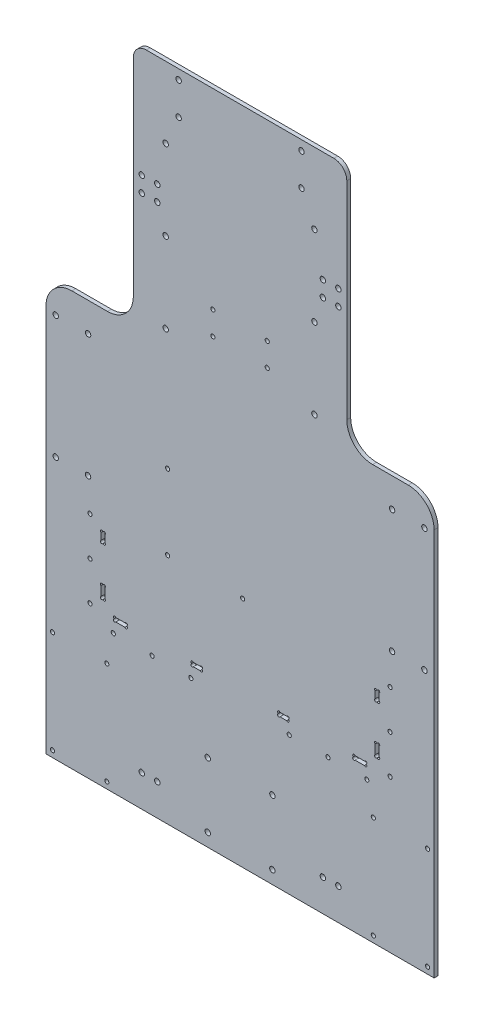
ISO-10303-21;
HEADER;
FILE_DESCRIPTION(('STEP AP214'),'2;1');
FILE_NAME('part.step','',(''),(''),'','','');
FILE_SCHEMA(('AUTOMOTIVE_DESIGN { 1 0 10303 214 1 1 1 1 }'));
ENDSEC;
DATA;
#1=APPLICATION_CONTEXT('core data for automotive mechanical design processes');
#2=APPLICATION_PROTOCOL_DEFINITION('international standard','automotive_design',2000,#1);
#3=PRODUCT_CONTEXT('',#1,'mechanical');
#4=PRODUCT('Part','Part','',(#3));
#5=PRODUCT_RELATED_PRODUCT_CATEGORY('part','',(#4));
#6=PRODUCT_DEFINITION_FORMATION('','',#4);
#7=PRODUCT_DEFINITION_CONTEXT('part definition',#1,'design');
#8=PRODUCT_DEFINITION('design','',#6,#7);
#9=PRODUCT_DEFINITION_SHAPE('','',#8);
#10=(LENGTH_UNIT() NAMED_UNIT(*) SI_UNIT(.MILLI.,.METRE.));
#11=(NAMED_UNIT(*) PLANE_ANGLE_UNIT() SI_UNIT($,.RADIAN.));
#12=(NAMED_UNIT(*) SI_UNIT($,.STERADIAN.) SOLID_ANGLE_UNIT());
#13=UNCERTAINTY_MEASURE_WITH_UNIT(LENGTH_MEASURE(1.E-05),#10,'distance_accuracy_value','');
#14=(GEOMETRIC_REPRESENTATION_CONTEXT(3) GLOBAL_UNCERTAINTY_ASSIGNED_CONTEXT((#13)) GLOBAL_UNIT_ASSIGNED_CONTEXT((#10,
#11,#12)) REPRESENTATION_CONTEXT('',''));
#15=CARTESIAN_POINT('',(0.,0.,0.));
#16=DIRECTION('',(0.,0.,1.));
#17=DIRECTION('',(1.,0.,0.));
#18=AXIS2_PLACEMENT_3D('',#15,#16,#17);
#19=CARTESIAN_POINT('',(-29.4999999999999,-139.700000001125,10.));
#20=DIRECTION('',(0.,-1.,0.));
#21=DIRECTION('',(0.,0.,-1.));
#22=AXIS2_PLACEMENT_3D('',#19,#20,#21);
#23=PLANE('',#22);
#24=DIRECTION('',(0.,0.,1.));
#25=VECTOR('',#24,1.);
#26=CARTESIAN_POINT('',(-30.8660254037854,-139.700000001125,-7.));
#27=LINE('',#26,#25);
#28=CARTESIAN_POINT('',(-30.8660254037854,-139.700000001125,0.));
#29=VERTEX_POINT('',#28);
#30=CARTESIAN_POINT('',(-30.8660254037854,-139.700000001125,3.));
#31=VERTEX_POINT('',#30);
#32=EDGE_CURVE('E552',#29,#31,#27,.T.);
#33=ORIENTED_EDGE('',*,*,#32,.F.);
#34=DIRECTION('',(-1.,0.,0.));
#35=VECTOR('',#34,1.);
#36=CARTESIAN_POINT('',(-29.4999999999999,-139.700000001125,0.));
#37=LINE('',#36,#35);
#38=CARTESIAN_POINT('',(-36.1339745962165,-139.700000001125,0.));
#39=VERTEX_POINT('',#38);
#40=EDGE_CURVE('E1552',#29,#39,#37,.T.);
#41=ORIENTED_EDGE('',*,*,#40,.T.);
#42=DIRECTION('',(0.,0.,1.));
#43=VECTOR('',#42,1.);
#44=CARTESIAN_POINT('',(-36.1339745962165,-139.700000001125,-7.));
#45=LINE('',#44,#43);
#46=CARTESIAN_POINT('',(-36.1339745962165,-139.700000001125,3.));
#47=VERTEX_POINT('',#46);
#48=EDGE_CURVE('E1031',#47,#39,#45,.F.);
#49=ORIENTED_EDGE('',*,*,#48,.F.);
#50=DIRECTION('',(-1.,0.,0.));
#51=VECTOR('',#50,1.);
#52=CARTESIAN_POINT('',(0.,-139.700000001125,3.));
#53=LINE('',#52,#51);
#54=EDGE_CURVE('E1644',#31,#47,#53,.T.);
#55=ORIENTED_EDGE('',*,*,#54,.F.);
#56=EDGE_LOOP('',(#33,#41,#49,#55));
#57=FACE_BOUND('',#56,.T.);
#58=ADVANCED_FACE('F59',(#57),#23,.F.);
#59=CARTESIAN_POINT('',(-29.4999999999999,-136.700000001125,10.));
#60=DIRECTION('',(1.,0.,0.));
#61=DIRECTION('',(0.,0.,-1.));
#62=AXIS2_PLACEMENT_3D('',#59,#60,#61);
#63=PLANE('',#62);
#64=DIRECTION('',(0.,0.,1.));
#65=VECTOR('',#64,1.);
#66=CARTESIAN_POINT('',(-29.4999999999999,-138.333974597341,-7.));
#67=LINE('',#66,#65);
#68=CARTESIAN_POINT('',(-29.4999999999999,-138.333974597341,3.));
#69=VERTEX_POINT('',#68);
#70=CARTESIAN_POINT('',(-29.4999999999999,-138.333974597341,0.));
#71=VERTEX_POINT('',#70);
#72=EDGE_CURVE('E549',#69,#71,#67,.F.);
#73=ORIENTED_EDGE('',*,*,#72,.F.);
#74=DIRECTION('',(0.,-1.,0.));
#75=VECTOR('',#74,1.);
#76=CARTESIAN_POINT('',(-29.4999999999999,0.,3.));
#77=LINE('',#76,#75);
#78=CARTESIAN_POINT('',(-29.4999999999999,-138.066025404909,3.));
#79=VERTEX_POINT('',#78);
#80=EDGE_CURVE('E562',#79,#69,#77,.T.);
#81=ORIENTED_EDGE('',*,*,#80,.F.);
#82=DIRECTION('',(0.,0.,1.));
#83=VECTOR('',#82,1.);
#84=CARTESIAN_POINT('',(-29.4999999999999,-138.066025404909,-7.));
#85=LINE('',#84,#83);
#86=CARTESIAN_POINT('',(-29.4999999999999,-138.066025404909,0.));
#87=VERTEX_POINT('',#86);
#88=EDGE_CURVE('E1666',#87,#79,#85,.T.);
#89=ORIENTED_EDGE('',*,*,#88,.F.);
#90=DIRECTION('',(0.,-1.,0.));
#91=VECTOR('',#90,1.);
#92=CARTESIAN_POINT('',(-29.4999999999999,-136.700000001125,0.));
#93=LINE('',#92,#91);
#94=EDGE_CURVE('E564',#87,#71,#93,.T.);
#95=ORIENTED_EDGE('',*,*,#94,.T.);
#96=EDGE_LOOP('',(#73,#81,#89,#95));
#97=FACE_BOUND('',#96,.T.);
#98=ADVANCED_FACE('F560',(#97),#63,.F.);
#99=CARTESIAN_POINT('',(-37.4999999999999,-136.700000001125,10.));
#100=DIRECTION('',(-1.,0.,0.));
#101=DIRECTION('',(0.,0.,1.));
#102=AXIS2_PLACEMENT_3D('',#99,#100,#101);
#103=PLANE('',#102);
#104=DIRECTION('',(0.,0.,1.));
#105=VECTOR('',#104,1.);
#106=CARTESIAN_POINT('',(-37.4999999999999,-138.33397459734,-7.));
#107=LINE('',#106,#105);
#108=CARTESIAN_POINT('',(-37.4999999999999,-138.33397459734,0.));
#109=VERTEX_POINT('',#108);
#110=CARTESIAN_POINT('',(-37.4999999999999,-138.33397459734,3.));
#111=VERTEX_POINT('',#110);
#112=EDGE_CURVE('E1653',#109,#111,#107,.T.);
#113=ORIENTED_EDGE('',*,*,#112,.F.);
#114=DIRECTION('',(0.,1.,0.));
#115=VECTOR('',#114,1.);
#116=CARTESIAN_POINT('',(-37.4999999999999,-136.700000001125,0.));
#117=LINE('',#116,#115);
#118=CARTESIAN_POINT('',(-37.4999999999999,-138.06602540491,0.));
#119=VERTEX_POINT('',#118);
#120=EDGE_CURVE('E1548',#109,#119,#117,.T.);
#121=ORIENTED_EDGE('',*,*,#120,.T.);
#122=DIRECTION('',(0.,0.,1.));
#123=VECTOR('',#122,1.);
#124=CARTESIAN_POINT('',(-37.4999999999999,-138.06602540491,-7.));
#125=LINE('',#124,#123);
#126=CARTESIAN_POINT('',(-37.4999999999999,-138.06602540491,3.));
#127=VERTEX_POINT('',#126);
#128=EDGE_CURVE('E1028',#127,#119,#125,.F.);
#129=ORIENTED_EDGE('',*,*,#128,.F.);
#130=DIRECTION('',(0.,1.,0.));
#131=VECTOR('',#130,1.);
#132=CARTESIAN_POINT('',(-37.4999999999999,0.,3.));
#133=LINE('',#132,#131);
#134=EDGE_CURVE('E576',#111,#127,#133,.T.);
#135=ORIENTED_EDGE('',*,*,#134,.F.);
#136=EDGE_LOOP('',(#113,#121,#129,#135));
#137=FACE_BOUND('',#136,.T.);
#138=ADVANCED_FACE('F1117',(#137),#103,.F.);
#139=CARTESIAN_POINT('',(-29.4999999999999,-136.700000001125,10.));
#140=DIRECTION('',(0.,1.,0.));
#141=DIRECTION('',(0.,0.,1.));
#142=AXIS2_PLACEMENT_3D('',#139,#140,#141);
#143=PLANE('',#142);
#144=DIRECTION('',(0.,0.,1.));
#145=VECTOR('',#144,1.);
#146=CARTESIAN_POINT('',(-36.1339745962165,-136.700000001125,-7.));
#147=LINE('',#146,#145);
#148=CARTESIAN_POINT('',(-36.1339745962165,-136.700000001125,0.));
#149=VERTEX_POINT('',#148);
#150=CARTESIAN_POINT('',(-36.1339745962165,-136.700000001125,3.));
#151=VERTEX_POINT('',#150);
#152=EDGE_CURVE('E1531',#149,#151,#147,.T.);
#153=ORIENTED_EDGE('',*,*,#152,.F.);
#154=DIRECTION('',(1.,0.,0.));
#155=VECTOR('',#154,1.);
#156=CARTESIAN_POINT('',(-29.4999999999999,-136.700000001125,0.));
#157=LINE('',#156,#155);
#158=CARTESIAN_POINT('',(-30.8660254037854,-136.700000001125,0.));
#159=VERTEX_POINT('',#158);
#160=EDGE_CURVE('E1534',#149,#159,#157,.T.);
#161=ORIENTED_EDGE('',*,*,#160,.T.);
#162=DIRECTION('',(0.,0.,1.));
#163=VECTOR('',#162,1.);
#164=CARTESIAN_POINT('',(-30.8660254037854,-136.700000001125,-7.));
#165=LINE('',#164,#163);
#166=CARTESIAN_POINT('',(-30.8660254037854,-136.700000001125,3.));
#167=VERTEX_POINT('',#166);
#168=EDGE_CURVE('E1025',#167,#159,#165,.F.);
#169=ORIENTED_EDGE('',*,*,#168,.F.);
#170=DIRECTION('',(1.,0.,0.));
#171=VECTOR('',#170,1.);
#172=CARTESIAN_POINT('',(0.,-136.700000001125,3.));
#173=LINE('',#172,#171);
#174=EDGE_CURVE('E572',#151,#167,#173,.T.);
#175=ORIENTED_EDGE('',*,*,#174,.F.);
#176=EDGE_LOOP('',(#153,#161,#169,#175));
#177=FACE_BOUND('',#176,.T.);
#178=ADVANCED_FACE('F1201',(#177),#143,.F.);
#179=CARTESIAN_POINT('',(-104.5,-92.2000000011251,10.));
#180=DIRECTION('',(0.,-1.,0.));
#181=DIRECTION('',(0.,0.,-1.));
#182=AXIS2_PLACEMENT_3D('',#179,#180,#181);
#183=PLANE('',#182);
#184=DIRECTION('',(0.,0.,1.));
#185=VECTOR('',#184,1.);
#186=CARTESIAN_POINT('',(-105.866025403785,-92.2000000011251,-7.));
#187=LINE('',#186,#185);
#188=CARTESIAN_POINT('',(-105.866025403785,-92.2000000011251,0.));
#189=VERTEX_POINT('',#188);
#190=CARTESIAN_POINT('',(-105.866025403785,-92.2000000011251,3.));
#191=VERTEX_POINT('',#190);
#192=EDGE_CURVE('E1673',#189,#191,#187,.T.);
#193=ORIENTED_EDGE('',*,*,#192,.F.);
#194=DIRECTION('',(-1.,0.,0.));
#195=VECTOR('',#194,1.);
#196=CARTESIAN_POINT('',(-104.5,-92.2000000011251,0.));
#197=LINE('',#196,#195);
#198=CARTESIAN_POINT('',(-106.133974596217,-92.2000000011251,0.));
#199=VERTEX_POINT('',#198);
#200=EDGE_CURVE('E598',#189,#199,#197,.T.);
#201=ORIENTED_EDGE('',*,*,#200,.T.);
#202=DIRECTION('',(0.,0.,1.));
#203=VECTOR('',#202,1.);
#204=CARTESIAN_POINT('',(-106.133974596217,-92.2000000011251,-7.));
#205=LINE('',#204,#203);
#206=CARTESIAN_POINT('',(-106.133974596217,-92.2000000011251,3.));
#207=VERTEX_POINT('',#206);
#208=EDGE_CURVE('E1019',#207,#199,#205,.F.);
#209=ORIENTED_EDGE('',*,*,#208,.F.);
#210=DIRECTION('',(-1.,0.,0.));
#211=VECTOR('',#210,1.);
#212=CARTESIAN_POINT('',(0.,-92.2000000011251,3.));
#213=LINE('',#212,#211);
#214=EDGE_CURVE('E604',#191,#207,#213,.T.);
#215=ORIENTED_EDGE('',*,*,#214,.F.);
#216=EDGE_LOOP('',(#193,#201,#209,#215));
#217=FACE_BOUND('',#216,.T.);
#218=ADVANCED_FACE('F1198',(#217),#183,.F.);
#219=CARTESIAN_POINT('',(-104.5,-84.2000000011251,10.));
#220=DIRECTION('',(1.,0.,0.));
#221=DIRECTION('',(0.,0.,-1.));
#222=AXIS2_PLACEMENT_3D('',#219,#220,#221);
#223=PLANE('',#222);
#224=DIRECTION('',(0.,0.,1.));
#225=VECTOR('',#224,1.);
#226=CARTESIAN_POINT('',(-104.5,-90.8339745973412,-7.));
#227=LINE('',#226,#225);
#228=CARTESIAN_POINT('',(-104.5,-90.8339745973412,3.));
#229=VERTEX_POINT('',#228);
#230=CARTESIAN_POINT('',(-104.5,-90.8339745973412,0.));
#231=VERTEX_POINT('',#230);
#232=EDGE_CURVE('E1671',#229,#231,#227,.F.);
#233=ORIENTED_EDGE('',*,*,#232,.F.);
#234=DIRECTION('',(0.,-1.,0.));
#235=VECTOR('',#234,1.);
#236=CARTESIAN_POINT('',(-104.5,0.,3.));
#237=LINE('',#236,#235);
#238=CARTESIAN_POINT('',(-104.5,-85.5660254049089,3.));
#239=VERTEX_POINT('',#238);
#240=EDGE_CURVE('E610',#239,#229,#237,.T.);
#241=ORIENTED_EDGE('',*,*,#240,.F.);
#242=DIRECTION('',(0.,0.,1.));
#243=VECTOR('',#242,1.);
#244=CARTESIAN_POINT('',(-104.5,-85.5660254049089,-7.));
#245=LINE('',#244,#243);
#246=CARTESIAN_POINT('',(-104.5,-85.5660254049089,0.));
#247=VERTEX_POINT('',#246);
#248=EDGE_CURVE('E1697',#247,#239,#245,.T.);
#249=ORIENTED_EDGE('',*,*,#248,.F.);
#250=DIRECTION('',(0.,-1.,0.));
#251=VECTOR('',#250,1.);
#252=CARTESIAN_POINT('',(-104.5,-84.2000000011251,0.));
#253=LINE('',#252,#251);
#254=EDGE_CURVE('E595',#247,#231,#253,.T.);
#255=ORIENTED_EDGE('',*,*,#254,.T.);
#256=EDGE_LOOP('',(#233,#241,#249,#255));
#257=FACE_BOUND('',#256,.T.);
#258=ADVANCED_FACE('F1196',(#257),#223,.F.);
#259=CARTESIAN_POINT('',(-107.5,-84.2000000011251,10.));
#260=DIRECTION('',(-1.,0.,0.));
#261=DIRECTION('',(0.,0.,1.));
#262=AXIS2_PLACEMENT_3D('',#259,#260,#261);
#263=PLANE('',#262);
#264=DIRECTION('',(0.,0.,1.));
#265=VECTOR('',#264,1.);
#266=CARTESIAN_POINT('',(-107.5,-90.83397459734,-7.));
#267=LINE('',#266,#265);
#268=CARTESIAN_POINT('',(-107.5,-90.83397459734,0.));
#269=VERTEX_POINT('',#268);
#270=CARTESIAN_POINT('',(-107.5,-90.83397459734,3.));
#271=VERTEX_POINT('',#270);
#272=EDGE_CURVE('E1681',#269,#271,#267,.T.);
#273=ORIENTED_EDGE('',*,*,#272,.F.);
#274=DIRECTION('',(0.,1.,0.));
#275=VECTOR('',#274,1.);
#276=CARTESIAN_POINT('',(-107.5,-84.2000000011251,0.));
#277=LINE('',#276,#275);
#278=CARTESIAN_POINT('',(-107.5,-85.56602540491,0.));
#279=VERTEX_POINT('',#278);
#280=EDGE_CURVE('E600',#269,#279,#277,.T.);
#281=ORIENTED_EDGE('',*,*,#280,.T.);
#282=DIRECTION('',(0.,0.,1.));
#283=VECTOR('',#282,1.);
#284=CARTESIAN_POINT('',(-107.5,-85.56602540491,-7.));
#285=LINE('',#284,#283);
#286=CARTESIAN_POINT('',(-107.5,-85.56602540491,3.));
#287=VERTEX_POINT('',#286);
#288=EDGE_CURVE('E1016',#287,#279,#285,.F.);
#289=ORIENTED_EDGE('',*,*,#288,.F.);
#290=DIRECTION('',(0.,1.,0.));
#291=VECTOR('',#290,1.);
#292=CARTESIAN_POINT('',(-107.5,0.,3.));
#293=LINE('',#292,#291);
#294=EDGE_CURVE('E606',#271,#287,#293,.T.);
#295=ORIENTED_EDGE('',*,*,#294,.F.);
#296=EDGE_LOOP('',(#273,#281,#289,#295));
#297=FACE_BOUND('',#296,.T.);
#298=ADVANCED_FACE('F1192',(#297),#263,.F.);
#299=CARTESIAN_POINT('',(-104.5,-84.2000000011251,10.));
#300=DIRECTION('',(0.,1.,0.));
#301=DIRECTION('',(0.,0.,1.));
#302=AXIS2_PLACEMENT_3D('',#299,#300,#301);
#303=PLANE('',#302);
#304=DIRECTION('',(0.,0.,1.));
#305=VECTOR('',#304,1.);
#306=CARTESIAN_POINT('',(-106.133974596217,-84.2000000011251,-7.));
#307=LINE('',#306,#305);
#308=CARTESIAN_POINT('',(-106.133974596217,-84.2000000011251,0.));
#309=VERTEX_POINT('',#308);
#310=CARTESIAN_POINT('',(-106.133974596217,-84.2000000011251,3.));
#311=VERTEX_POINT('',#310);
#312=EDGE_CURVE('E1689',#309,#311,#307,.T.);
#313=ORIENTED_EDGE('',*,*,#312,.F.);
#314=DIRECTION('',(1.,0.,0.));
#315=VECTOR('',#314,1.);
#316=CARTESIAN_POINT('',(-104.5,-84.2000000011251,0.));
#317=LINE('',#316,#315);
#318=CARTESIAN_POINT('',(-105.866025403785,-84.2000000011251,0.));
#319=VERTEX_POINT('',#318);
#320=EDGE_CURVE('E602',#309,#319,#317,.T.);
#321=ORIENTED_EDGE('',*,*,#320,.T.);
#322=DIRECTION('',(0.,0.,1.));
#323=VECTOR('',#322,1.);
#324=CARTESIAN_POINT('',(-105.866025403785,-84.2000000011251,-7.));
#325=LINE('',#324,#323);
#326=CARTESIAN_POINT('',(-105.866025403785,-84.2000000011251,3.));
#327=VERTEX_POINT('',#326);
#328=EDGE_CURVE('E1013',#327,#319,#325,.F.);
#329=ORIENTED_EDGE('',*,*,#328,.F.);
#330=DIRECTION('',(1.,0.,0.));
#331=VECTOR('',#330,1.);
#332=CARTESIAN_POINT('',(0.,-84.2000000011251,3.));
#333=LINE('',#332,#331);
#334=EDGE_CURVE('E608',#311,#327,#333,.T.);
#335=ORIENTED_EDGE('',*,*,#334,.F.);
#336=EDGE_LOOP('',(#313,#321,#329,#335));
#337=FACE_BOUND('',#336,.T.);
#338=ADVANCED_FACE('F1188',(#337),#303,.F.);
#339=CARTESIAN_POINT('',(-104.5,-129.700000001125,10.));
#340=DIRECTION('',(0.,-1.,0.));
#341=DIRECTION('',(0.,0.,-1.));
#342=AXIS2_PLACEMENT_3D('',#339,#340,#341);
#343=PLANE('',#342);
#344=DIRECTION('',(0.,0.,1.));
#345=VECTOR('',#344,1.);
#346=CARTESIAN_POINT('',(-105.866025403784,-129.700000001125,-7.));
#347=LINE('',#346,#345);
#348=CARTESIAN_POINT('',(-105.866025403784,-129.700000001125,0.));
#349=VERTEX_POINT('',#348);
#350=CARTESIAN_POINT('',(-105.866025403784,-129.700000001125,3.));
#351=VERTEX_POINT('',#350);
#352=EDGE_CURVE('E1704',#349,#351,#347,.T.);
#353=ORIENTED_EDGE('',*,*,#352,.F.);
#354=DIRECTION('',(-1.,0.,0.));
#355=VECTOR('',#354,1.);
#356=CARTESIAN_POINT('',(-104.5,-129.700000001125,0.));
#357=LINE('',#356,#355);
#358=CARTESIAN_POINT('',(-106.133974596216,-129.700000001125,0.));
#359=VERTEX_POINT('',#358);
#360=EDGE_CURVE('E2000',#349,#359,#357,.T.);
#361=ORIENTED_EDGE('',*,*,#360,.T.);
#362=DIRECTION('',(0.,0.,1.));
#363=VECTOR('',#362,1.);
#364=CARTESIAN_POINT('',(-106.133974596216,-129.700000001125,-7.));
#365=LINE('',#364,#363);
#366=CARTESIAN_POINT('',(-106.133974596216,-129.700000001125,3.));
#367=VERTEX_POINT('',#366);
#368=EDGE_CURVE('E1007',#367,#359,#365,.F.);
#369=ORIENTED_EDGE('',*,*,#368,.F.);
#370=DIRECTION('',(-1.,0.,0.));
#371=VECTOR('',#370,1.);
#372=CARTESIAN_POINT('',(0.,-129.700000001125,3.));
#373=LINE('',#372,#371);
#374=EDGE_CURVE('E586',#351,#367,#373,.T.);
#375=ORIENTED_EDGE('',*,*,#374,.F.);
#376=EDGE_LOOP('',(#353,#361,#369,#375));
#377=FACE_BOUND('',#376,.T.);
#378=ADVANCED_FACE('F1191',(#377),#343,.F.);
#379=CARTESIAN_POINT('',(-104.5,-119.700000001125,10.));
#380=DIRECTION('',(1.,0.,0.));
#381=DIRECTION('',(0.,0.,-1.));
#382=AXIS2_PLACEMENT_3D('',#379,#380,#381);
#383=PLANE('',#382);
#384=DIRECTION('',(0.,0.,1.));
#385=VECTOR('',#384,1.);
#386=CARTESIAN_POINT('',(-104.5,-128.333974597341,-7.));
#387=LINE('',#386,#385);
#388=CARTESIAN_POINT('',(-104.5,-128.333974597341,3.));
#389=VERTEX_POINT('',#388);
#390=CARTESIAN_POINT('',(-104.5,-128.333974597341,0.));
#391=VERTEX_POINT('',#390);
#392=EDGE_CURVE('E1702',#389,#391,#387,.F.);
#393=ORIENTED_EDGE('',*,*,#392,.F.);
#394=DIRECTION('',(0.,-1.,0.));
#395=VECTOR('',#394,1.);
#396=CARTESIAN_POINT('',(-104.5,0.,3.));
#397=LINE('',#396,#395);
#398=CARTESIAN_POINT('',(-104.5,-121.066025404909,3.));
#399=VERTEX_POINT('',#398);
#400=EDGE_CURVE('E592',#399,#389,#397,.T.);
#401=ORIENTED_EDGE('',*,*,#400,.F.);
#402=DIRECTION('',(0.,0.,1.));
#403=VECTOR('',#402,1.);
#404=CARTESIAN_POINT('',(-104.5,-121.066025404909,-7.));
#405=LINE('',#404,#403);
#406=CARTESIAN_POINT('',(-104.5,-121.066025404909,0.));
#407=VERTEX_POINT('',#406);
#408=EDGE_CURVE('E1728',#407,#399,#405,.T.);
#409=ORIENTED_EDGE('',*,*,#408,.F.);
#410=DIRECTION('',(0.,-1.,0.));
#411=VECTOR('',#410,1.);
#412=CARTESIAN_POINT('',(-104.5,-119.700000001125,0.));
#413=LINE('',#412,#411);
#414=EDGE_CURVE('E1997',#407,#391,#413,.T.);
#415=ORIENTED_EDGE('',*,*,#414,.T.);
#416=EDGE_LOOP('',(#393,#401,#409,#415));
#417=FACE_BOUND('',#416,.T.);
#418=ADVANCED_FACE('F1502',(#417),#383,.F.);
#419=CARTESIAN_POINT('',(-107.5,-119.700000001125,10.));
#420=DIRECTION('',(-1.,0.,0.));
#421=DIRECTION('',(0.,0.,1.));
#422=AXIS2_PLACEMENT_3D('',#419,#420,#421);
#423=PLANE('',#422);
#424=DIRECTION('',(0.,0.,1.));
#425=VECTOR('',#424,1.);
#426=CARTESIAN_POINT('',(-107.5,-128.333974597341,-7.));
#427=LINE('',#426,#425);
#428=CARTESIAN_POINT('',(-107.5,-128.333974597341,0.));
#429=VERTEX_POINT('',#428);
#430=CARTESIAN_POINT('',(-107.5,-128.333974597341,3.));
#431=VERTEX_POINT('',#430);
#432=EDGE_CURVE('E1712',#429,#431,#427,.T.);
#433=ORIENTED_EDGE('',*,*,#432,.F.);
#434=DIRECTION('',(0.,1.,0.));
#435=VECTOR('',#434,1.);
#436=CARTESIAN_POINT('',(-107.5,-119.700000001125,0.));
#437=LINE('',#436,#435);
#438=CARTESIAN_POINT('',(-107.5,-121.066025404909,0.));
#439=VERTEX_POINT('',#438);
#440=EDGE_CURVE('E2003',#429,#439,#437,.T.);
#441=ORIENTED_EDGE('',*,*,#440,.T.);
#442=DIRECTION('',(0.,0.,1.));
#443=VECTOR('',#442,1.);
#444=CARTESIAN_POINT('',(-107.5,-121.066025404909,-7.));
#445=LINE('',#444,#443);
#446=CARTESIAN_POINT('',(-107.5,-121.066025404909,3.));
#447=VERTEX_POINT('',#446);
#448=EDGE_CURVE('E1004',#447,#439,#445,.F.);
#449=ORIENTED_EDGE('',*,*,#448,.F.);
#450=DIRECTION('',(0.,1.,0.));
#451=VECTOR('',#450,1.);
#452=CARTESIAN_POINT('',(-107.5,0.,3.));
#453=LINE('',#452,#451);
#454=EDGE_CURVE('E588',#431,#447,#453,.T.);
#455=ORIENTED_EDGE('',*,*,#454,.F.);
#456=EDGE_LOOP('',(#433,#441,#449,#455));
#457=FACE_BOUND('',#456,.T.);
#458=ADVANCED_FACE('F1498',(#457),#423,.F.);
#459=CARTESIAN_POINT('',(-104.5,-119.700000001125,10.));
#460=DIRECTION('',(0.,1.,0.));
#461=DIRECTION('',(0.,0.,1.));
#462=AXIS2_PLACEMENT_3D('',#459,#460,#461);
#463=PLANE('',#462);
#464=DIRECTION('',(0.,0.,1.));
#465=VECTOR('',#464,1.);
#466=CARTESIAN_POINT('',(-106.133974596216,-119.700000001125,-7.));
#467=LINE('',#466,#465);
#468=CARTESIAN_POINT('',(-106.133974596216,-119.700000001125,0.));
#469=VERTEX_POINT('',#468);
#470=CARTESIAN_POINT('',(-106.133974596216,-119.700000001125,3.));
#471=VERTEX_POINT('',#470);
#472=EDGE_CURVE('E1720',#469,#471,#467,.T.);
#473=ORIENTED_EDGE('',*,*,#472,.F.);
#474=DIRECTION('',(1.,0.,0.));
#475=VECTOR('',#474,1.);
#476=CARTESIAN_POINT('',(-104.5,-119.700000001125,0.));
#477=LINE('',#476,#475);
#478=CARTESIAN_POINT('',(-105.866025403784,-119.700000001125,0.));
#479=VERTEX_POINT('',#478);
#480=EDGE_CURVE('E1604',#469,#479,#477,.T.);
#481=ORIENTED_EDGE('',*,*,#480,.T.);
#482=DIRECTION('',(0.,0.,1.));
#483=VECTOR('',#482,1.);
#484=CARTESIAN_POINT('',(-105.866025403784,-119.700000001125,-7.));
#485=LINE('',#484,#483);
#486=CARTESIAN_POINT('',(-105.866025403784,-119.700000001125,3.));
#487=VERTEX_POINT('',#486);
#488=EDGE_CURVE('E1001',#487,#479,#485,.F.);
#489=ORIENTED_EDGE('',*,*,#488,.F.);
#490=DIRECTION('',(1.,0.,0.));
#491=VECTOR('',#490,1.);
#492=CARTESIAN_POINT('',(0.,-119.700000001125,3.));
#493=LINE('',#492,#491);
#494=EDGE_CURVE('E590',#471,#487,#493,.T.);
#495=ORIENTED_EDGE('',*,*,#494,.F.);
#496=EDGE_LOOP('',(#473,#481,#489,#495));
#497=FACE_BOUND('',#496,.T.);
#498=ADVANCED_FACE('F1494',(#497),#463,.F.);
#499=CARTESIAN_POINT('',(-87.5000000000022,-136.700000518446,10.));
#500=DIRECTION('',(0.,1.,0.));
#501=DIRECTION('',(0.,0.,1.));
#502=AXIS2_PLACEMENT_3D('',#499,#500,#501);
#503=PLANE('',#502);
#504=DIRECTION('',(0.,0.,1.));
#505=VECTOR('',#504,1.);
#506=CARTESIAN_POINT('',(-96.1339742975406,-136.700000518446,0.));
#507=LINE('',#506,#505);
#508=CARTESIAN_POINT('',(-96.1339742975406,-136.700000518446,0.));
#509=VERTEX_POINT('',#508);
#510=CARTESIAN_POINT('',(-96.1339742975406,-136.700000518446,3.));
#511=VERTEX_POINT('',#510);
#512=EDGE_CURVE('E1735',#509,#511,#507,.T.);
#513=ORIENTED_EDGE('',*,*,#512,.F.);
#514=DIRECTION('',(1.,0.,0.));
#515=VECTOR('',#514,1.);
#516=CARTESIAN_POINT('',(-87.5000000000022,-136.700000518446,0.));
#517=LINE('',#516,#515);
#518=CARTESIAN_POINT('',(-88.9537305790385,-136.700000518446,0.));
#519=VERTEX_POINT('',#518);
#520=EDGE_CURVE('E2001',#509,#519,#517,.T.);
#521=ORIENTED_EDGE('',*,*,#520,.T.);
#522=DIRECTION('',(0.,0.,1.));
#523=VECTOR('',#522,1.);
#524=CARTESIAN_POINT('',(-88.9537305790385,-136.700000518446,0.));
#525=LINE('',#524,#523);
#526=CARTESIAN_POINT('',(-88.9537305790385,-136.700000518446,3.));
#527=VERTEX_POINT('',#526);
#528=EDGE_CURVE('E995',#527,#519,#525,.F.);
#529=ORIENTED_EDGE('',*,*,#528,.F.);
#530=DIRECTION('',(1.,0.,0.));
#531=VECTOR('',#530,1.);
#532=CARTESIAN_POINT('',(0.,-136.700000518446,3.));
#533=LINE('',#532,#531);
#534=EDGE_CURVE('E582',#511,#527,#533,.T.);
#535=ORIENTED_EDGE('',*,*,#534,.F.);
#536=EDGE_LOOP('',(#513,#521,#529,#535));
#537=FACE_BOUND('',#536,.T.);
#538=ADVANCED_FACE('F1497',(#537),#503,.F.);
#539=CARTESIAN_POINT('',(-97.5000000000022,-136.700000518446,10.));
#540=DIRECTION('',(-1.,0.,0.));
#541=DIRECTION('',(0.,0.,1.));
#542=AXIS2_PLACEMENT_3D('',#539,#540,#541);
#543=PLANE('',#542);
#544=DIRECTION('',(0.,0.,1.));
#545=VECTOR('',#544,1.);
#546=CARTESIAN_POINT('',(-97.5000000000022,-138.066025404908,0.));
#547=LINE('',#546,#545);
#548=CARTESIAN_POINT('',(-97.5000000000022,-138.066025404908,3.));
#549=VERTEX_POINT('',#548);
#550=CARTESIAN_POINT('',(-97.5000000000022,-138.066025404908,0.));
#551=VERTEX_POINT('',#550);
#552=EDGE_CURVE('E1733',#549,#551,#547,.F.);
#553=ORIENTED_EDGE('',*,*,#552,.F.);
#554=DIRECTION('',(0.,1.,0.));
#555=VECTOR('',#554,1.);
#556=CARTESIAN_POINT('',(-97.5000000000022,0.,3.));
#557=LINE('',#556,#555);
#558=CARTESIAN_POINT('',(-97.5000000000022,-138.333974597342,3.));
#559=VERTEX_POINT('',#558);
#560=EDGE_CURVE('E574',#559,#549,#557,.T.);
#561=ORIENTED_EDGE('',*,*,#560,.F.);
#562=DIRECTION('',(0.,0.,1.));
#563=VECTOR('',#562,1.);
#564=CARTESIAN_POINT('',(-97.5000000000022,-138.333974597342,0.));
#565=LINE('',#564,#563);
#566=CARTESIAN_POINT('',(-97.5000000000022,-138.333974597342,0.));
#567=VERTEX_POINT('',#566);
#568=EDGE_CURVE('E1754',#567,#559,#565,.T.);
#569=ORIENTED_EDGE('',*,*,#568,.F.);
#570=DIRECTION('',(0.,1.,0.));
#571=VECTOR('',#570,1.);
#572=CARTESIAN_POINT('',(-97.5000000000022,-136.700000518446,0.));
#573=LINE('',#572,#571);
#574=EDGE_CURVE('E2007',#567,#551,#573,.T.);
#575=ORIENTED_EDGE('',*,*,#574,.T.);
#576=EDGE_LOOP('',(#553,#561,#569,#575));
#577=FACE_BOUND('',#576,.T.);
#578=ADVANCED_FACE('F1512',(#577),#543,.F.);
#579=CARTESIAN_POINT('',(-87.5000000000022,-136.700000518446,10.));
#580=DIRECTION('',(1.,0.,0.));
#581=DIRECTION('',(0.,0.,-1.));
#582=AXIS2_PLACEMENT_3D('',#579,#580,#581);
#583=PLANE('',#582);
#584=DIRECTION('',(0.,0.,1.));
#585=VECTOR('',#584,1.);
#586=CARTESIAN_POINT('',(-87.5000000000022,-138.009075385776,0.));
#587=LINE('',#586,#585);
#588=CARTESIAN_POINT('',(-87.5000000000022,-138.009075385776,0.));
#589=VERTEX_POINT('',#588);
#590=CARTESIAN_POINT('',(-87.5000000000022,-138.009075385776,3.));
#591=VERTEX_POINT('',#590);
#592=EDGE_CURVE('E1742',#589,#591,#587,.T.);
#593=ORIENTED_EDGE('',*,*,#592,.F.);
#594=DIRECTION('',(0.,-1.,0.));
#595=VECTOR('',#594,1.);
#596=CARTESIAN_POINT('',(-87.5000000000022,-136.700000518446,0.));
#597=LINE('',#596,#595);
#598=CARTESIAN_POINT('',(-87.5000000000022,-138.390924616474,0.));
#599=VERTEX_POINT('',#598);
#600=EDGE_CURVE('E1547',#589,#599,#597,.T.);
#601=ORIENTED_EDGE('',*,*,#600,.T.);
#602=DIRECTION('',(0.,0.,1.));
#603=VECTOR('',#602,1.);
#604=CARTESIAN_POINT('',(-87.5000000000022,-138.390924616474,0.));
#605=LINE('',#604,#603);
#606=CARTESIAN_POINT('',(-87.5000000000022,-138.390924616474,3.));
#607=VERTEX_POINT('',#606);
#608=EDGE_CURVE('E992',#607,#599,#605,.F.);
#609=ORIENTED_EDGE('',*,*,#608,.F.);
#610=DIRECTION('',(0.,-1.,0.));
#611=VECTOR('',#610,1.);
#612=CARTESIAN_POINT('',(-87.5000000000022,0.,3.));
#613=LINE('',#612,#611);
#614=EDGE_CURVE('E584',#591,#607,#613,.T.);
#615=ORIENTED_EDGE('',*,*,#614,.F.);
#616=EDGE_LOOP('',(#593,#601,#609,#615));
#617=FACE_BOUND('',#616,.T.);
#618=ADVANCED_FACE('F1516',(#617),#583,.F.);
#619=CARTESIAN_POINT('',(-87.5000000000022,-139.700000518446,10.));
#620=DIRECTION('',(0.,-1.,0.));
#621=DIRECTION('',(0.,0.,-1.));
#622=AXIS2_PLACEMENT_3D('',#619,#620,#621);
#623=PLANE('',#622);
#624=DIRECTION('',(0.,0.,1.));
#625=VECTOR('',#624,1.);
#626=CARTESIAN_POINT('',(-88.9537299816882,-139.700000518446,0.));
#627=LINE('',#626,#625);
#628=CARTESIAN_POINT('',(-88.9537299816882,-139.700000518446,0.));
#629=VERTEX_POINT('',#628);
#630=CARTESIAN_POINT('',(-88.9537299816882,-139.700000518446,3.));
#631=VERTEX_POINT('',#630);
#632=EDGE_CURVE('E1747',#629,#631,#627,.T.);
#633=ORIENTED_EDGE('',*,*,#632,.F.);
#634=DIRECTION('',(-1.,0.,0.));
#635=VECTOR('',#634,1.);
#636=CARTESIAN_POINT('',(-87.5000000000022,-139.700000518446,0.));
#637=LINE('',#636,#635);
#638=CARTESIAN_POINT('',(-96.1339748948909,-139.700000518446,0.));
#639=VERTEX_POINT('',#638);
#640=EDGE_CURVE('E1550',#629,#639,#637,.T.);
#641=ORIENTED_EDGE('',*,*,#640,.T.);
#642=DIRECTION('',(0.,0.,1.));
#643=VECTOR('',#642,1.);
#644=CARTESIAN_POINT('',(-96.1339748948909,-139.700000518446,0.));
#645=LINE('',#644,#643);
#646=CARTESIAN_POINT('',(-96.1339748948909,-139.700000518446,3.));
#647=VERTEX_POINT('',#646);
#648=EDGE_CURVE('E989',#647,#639,#645,.F.);
#649=ORIENTED_EDGE('',*,*,#648,.F.);
#650=DIRECTION('',(-1.,0.,0.));
#651=VECTOR('',#650,1.);
#652=CARTESIAN_POINT('',(0.,-139.700000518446,3.));
#653=LINE('',#652,#651);
#654=EDGE_CURVE('E571',#631,#647,#653,.T.);
#655=ORIENTED_EDGE('',*,*,#654,.F.);
#656=EDGE_LOOP('',(#633,#641,#649,#655));
#657=FACE_BOUND('',#656,.T.);
#658=ADVANCED_FACE('F1380',(#657),#623,.F.);
#659=CARTESIAN_POINT('',(0.,0.,3.));
#660=DIRECTION('',(0.,0.,-1.));
#661=DIRECTION('',(-1.,0.,0.));
#662=AXIS2_PLACEMENT_3D('',#659,#660,#661);
#663=PLANE('',#662);
#664=CARTESIAN_POINT('',(-30.0000000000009,-139.200000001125,3.));
#665=DIRECTION('',(0.,0.,-1.));
#666=DIRECTION('',(-1.,0.,0.));
#667=AXIS2_PLACEMENT_3D('',#664,#665,#666);
#668=CIRCLE('',#667,1.);
#669=EDGE_CURVE('E546',#69,#31,#668,.T.);
#670=ORIENTED_EDGE('',*,*,#669,.T.);
#671=ORIENTED_EDGE('',*,*,#54,.T.);
#672=CARTESIAN_POINT('',(-37.0000000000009,-139.200000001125,3.));
#673=DIRECTION('',(0.,0.,-1.));
#674=DIRECTION('',(-1.,0.,0.));
#675=AXIS2_PLACEMENT_3D('',#672,#673,#674);
#676=CIRCLE('',#675,0.999999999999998);
#677=EDGE_CURVE('E1649',#47,#111,#676,.T.);
#678=ORIENTED_EDGE('',*,*,#677,.T.);
#679=ORIENTED_EDGE('',*,*,#134,.T.);
#680=CARTESIAN_POINT('',(-37.0000000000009,-137.200000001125,3.));
#681=DIRECTION('',(0.,0.,-1.));
#682=DIRECTION('',(-1.,0.,0.));
#683=AXIS2_PLACEMENT_3D('',#680,#681,#682);
#684=CIRCLE('',#683,0.999999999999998);
#685=EDGE_CURVE('E1647',#127,#151,#684,.T.);
#686=ORIENTED_EDGE('',*,*,#685,.T.);
#687=ORIENTED_EDGE('',*,*,#174,.T.);
#688=CARTESIAN_POINT('',(-30.0000000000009,-137.200000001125,3.));
#689=DIRECTION('',(0.,0.,-1.));
#690=DIRECTION('',(-1.,0.,0.));
#691=AXIS2_PLACEMENT_3D('',#688,#689,#690);
#692=CIRCLE('',#691,1.);
#693=EDGE_CURVE('E570',#167,#79,#692,.T.);
#694=ORIENTED_EDGE('',*,*,#693,.T.);
#695=ORIENTED_EDGE('',*,*,#80,.T.);
#696=EDGE_LOOP('',(#670,#671,#678,#679,#686,#687,#694,#695));
#697=FACE_BOUND('',#696,.T.);
#698=CARTESIAN_POINT('',(-105.000000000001,-91.700000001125,3.));
#699=DIRECTION('',(0.,0.,-1.));
#700=DIRECTION('',(-1.,0.,0.));
#701=AXIS2_PLACEMENT_3D('',#698,#699,#700);
#702=CIRCLE('',#701,0.999999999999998);
#703=EDGE_CURVE('E1668',#229,#191,#702,.T.);
#704=ORIENTED_EDGE('',*,*,#703,.T.);
#705=ORIENTED_EDGE('',*,*,#214,.T.);
#706=CARTESIAN_POINT('',(-107.000000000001,-91.700000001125,3.));
#707=DIRECTION('',(0.,0.,-1.));
#708=DIRECTION('',(-1.,0.,0.));
#709=AXIS2_PLACEMENT_3D('',#706,#707,#708);
#710=CIRCLE('',#709,0.999999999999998);
#711=EDGE_CURVE('E1675',#207,#271,#710,.T.);
#712=ORIENTED_EDGE('',*,*,#711,.T.);
#713=ORIENTED_EDGE('',*,*,#294,.T.);
#714=CARTESIAN_POINT('',(-107.000000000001,-84.700000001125,3.));
#715=DIRECTION('',(0.,0.,-1.));
#716=DIRECTION('',(-1.,0.,0.));
#717=AXIS2_PLACEMENT_3D('',#714,#715,#716);
#718=CIRCLE('',#717,0.999999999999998);
#719=EDGE_CURVE('E1683',#287,#311,#718,.T.);
#720=ORIENTED_EDGE('',*,*,#719,.T.);
#721=ORIENTED_EDGE('',*,*,#334,.T.);
#722=CARTESIAN_POINT('',(-105.000000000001,-84.700000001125,3.));
#723=DIRECTION('',(0.,0.,-1.));
#724=DIRECTION('',(-1.,0.,0.));
#725=AXIS2_PLACEMENT_3D('',#722,#723,#724);
#726=CIRCLE('',#725,0.999999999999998);
#727=EDGE_CURVE('E1691',#327,#239,#726,.T.);
#728=ORIENTED_EDGE('',*,*,#727,.T.);
#729=ORIENTED_EDGE('',*,*,#240,.T.);
#730=EDGE_LOOP('',(#704,#705,#712,#713,#720,#721,#728,#729));
#731=FACE_BOUND('',#730,.T.);
#732=CARTESIAN_POINT('',(-105.,-129.200000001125,3.));
#733=DIRECTION('',(0.,0.,-1.));
#734=DIRECTION('',(-1.,0.,0.));
#735=AXIS2_PLACEMENT_3D('',#732,#733,#734);
#736=CIRCLE('',#735,0.999999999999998);
#737=EDGE_CURVE('E1699',#389,#351,#736,.T.);
#738=ORIENTED_EDGE('',*,*,#737,.T.);
#739=ORIENTED_EDGE('',*,*,#374,.T.);
#740=CARTESIAN_POINT('',(-107.,-129.200000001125,3.));
#741=DIRECTION('',(0.,0.,-1.));
#742=DIRECTION('',(-1.,0.,0.));
#743=AXIS2_PLACEMENT_3D('',#740,#741,#742);
#744=CIRCLE('',#743,0.999999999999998);
#745=EDGE_CURVE('E1706',#367,#431,#744,.T.);
#746=ORIENTED_EDGE('',*,*,#745,.T.);
#747=ORIENTED_EDGE('',*,*,#454,.T.);
#748=CARTESIAN_POINT('',(-107.,-120.200000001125,3.));
#749=DIRECTION('',(0.,0.,-1.));
#750=DIRECTION('',(-1.,0.,0.));
#751=AXIS2_PLACEMENT_3D('',#748,#749,#750);
#752=CIRCLE('',#751,0.999999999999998);
#753=EDGE_CURVE('E1714',#447,#471,#752,.T.);
#754=ORIENTED_EDGE('',*,*,#753,.T.);
#755=ORIENTED_EDGE('',*,*,#494,.T.);
#756=CARTESIAN_POINT('',(-105.,-120.200000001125,3.));
#757=DIRECTION('',(0.,0.,-1.));
#758=DIRECTION('',(-1.,0.,0.));
#759=AXIS2_PLACEMENT_3D('',#756,#757,#758);
#760=CIRCLE('',#759,0.999999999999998);
#761=EDGE_CURVE('E1722',#487,#399,#760,.T.);
#762=ORIENTED_EDGE('',*,*,#761,.T.);
#763=ORIENTED_EDGE('',*,*,#400,.T.);
#764=EDGE_LOOP('',(#738,#739,#746,#747,#754,#755,#762,#763));
#765=FACE_BOUND('',#764,.T.);
#766=CARTESIAN_POINT('',(-97.,-137.200000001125,3.));
#767=DIRECTION('',(0.,0.,-1.));
#768=DIRECTION('',(-1.,0.,0.));
#769=AXIS2_PLACEMENT_3D('',#766,#767,#768);
#770=CIRCLE('',#769,0.999999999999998);
#771=EDGE_CURVE('E1730',#549,#511,#770,.T.);
#772=ORIENTED_EDGE('',*,*,#771,.T.);
#773=ORIENTED_EDGE('',*,*,#534,.T.);
#774=CARTESIAN_POINT('',(-88.0877048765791,-137.200000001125,3.));
#775=DIRECTION('',(0.,0.,-1.));
#776=DIRECTION('',(-1.,0.,0.));
#777=AXIS2_PLACEMENT_3D('',#774,#775,#776);
#778=CIRCLE('',#777,0.999999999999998);
#779=EDGE_CURVE('E1737',#527,#591,#778,.T.);
#780=ORIENTED_EDGE('',*,*,#779,.T.);
#781=ORIENTED_EDGE('',*,*,#614,.T.);
#782=CARTESIAN_POINT('',(-88.0877048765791,-139.200000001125,3.));
#783=DIRECTION('',(0.,0.,-1.));
#784=DIRECTION('',(-1.,0.,0.));
#785=AXIS2_PLACEMENT_3D('',#782,#783,#784);
#786=CIRCLE('',#785,0.999999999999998);
#787=EDGE_CURVE('E1744',#607,#631,#786,.T.);
#788=ORIENTED_EDGE('',*,*,#787,.T.);
#789=ORIENTED_EDGE('',*,*,#654,.T.);
#790=CARTESIAN_POINT('',(-97.,-139.200000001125,3.));
#791=DIRECTION('',(0.,0.,-1.));
#792=DIRECTION('',(-1.,0.,0.));
#793=AXIS2_PLACEMENT_3D('',#790,#791,#792);
#794=CIRCLE('',#793,0.999999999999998);
#795=EDGE_CURVE('E1751',#647,#559,#794,.T.);
#796=ORIENTED_EDGE('',*,*,#795,.T.);
#797=ORIENTED_EDGE('',*,*,#560,.T.);
#798=EDGE_LOOP('',(#772,#773,#780,#781,#788,#789,#796,#797));
#799=FACE_BOUND('',#798,.T.);
#800=CARTESIAN_POINT('',(-145.,-171.,3.));
#801=DIRECTION('',(0.,0.,-1.));
#802=DIRECTION('',(-1.,0.,0.));
#803=AXIS2_PLACEMENT_3D('',#800,#801,#802);
#804=CIRCLE('',#803,1.59999999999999);
#805=CARTESIAN_POINT('',(-146.6,-171.,3.));
#806=VERTEX_POINT('',#805);
#807=EDGE_CURVE('E1883',#806,#806,#804,.T.);
#808=ORIENTED_EDGE('',*,*,#807,.T.);
#809=EDGE_LOOP('',(#808));
#810=FACE_BOUND('',#809,.T.);
#811=CARTESIAN_POINT('',(-103.,-250.,3.));
#812=DIRECTION('',(0.,0.,-1.));
#813=DIRECTION('',(-1.,0.,0.));
#814=AXIS2_PLACEMENT_3D('',#811,#812,#813);
#815=CIRCLE('',#814,1.6);
#816=CARTESIAN_POINT('',(-104.6,-250.,3.));
#817=VERTEX_POINT('',#816);
#818=EDGE_CURVE('E1889',#817,#817,#815,.T.);
#819=ORIENTED_EDGE('',*,*,#818,.T.);
#820=EDGE_LOOP('',(#819));
#821=FACE_BOUND('',#820,.T.);
#822=CARTESIAN_POINT('',(-145.,-250.,3.));
#823=DIRECTION('',(0.,0.,-1.));
#824=DIRECTION('',(-1.,0.,0.));
#825=AXIS2_PLACEMENT_3D('',#822,#823,#824);
#826=CIRCLE('',#825,1.59999999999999);
#827=CARTESIAN_POINT('',(-146.6,-250.,3.));
#828=VERTEX_POINT('',#827);
#829=EDGE_CURVE('E1878',#828,#828,#826,.T.);
#830=ORIENTED_EDGE('',*,*,#829,.T.);
#831=EDGE_LOOP('',(#830));
#832=FACE_BOUND('',#831,.T.);
#833=CARTESIAN_POINT('',(-103.,-171.,3.));
#834=DIRECTION('',(0.,0.,-1.));
#835=DIRECTION('',(-1.,0.,0.));
#836=AXIS2_PLACEMENT_3D('',#833,#834,#835);
#837=CIRCLE('',#836,1.6);
#838=CARTESIAN_POINT('',(-104.6,-171.,3.));
#839=VERTEX_POINT('',#838);
#840=EDGE_CURVE('E1882',#839,#839,#837,.T.);
#841=ORIENTED_EDGE('',*,*,#840,.T.);
#842=EDGE_LOOP('',(#841));
#843=FACE_BOUND('',#842,.T.);
#844=CARTESIAN_POINT('',(145.,-171.,3.));
#845=DIRECTION('',(0.,0.,1.));
#846=DIRECTION('',(1.,0.,0.));
#847=AXIS2_PLACEMENT_3D('',#844,#845,#846);
#848=CIRCLE('',#847,1.59999999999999);
#849=CARTESIAN_POINT('',(146.6,-171.,3.));
#850=VERTEX_POINT('',#849);
#851=EDGE_CURVE('E1907',#850,#850,#848,.T.);
#852=ORIENTED_EDGE('',*,*,#851,.F.);
#853=EDGE_LOOP('',(#852));
#854=FACE_BOUND('',#853,.T.);
#855=CARTESIAN_POINT('',(103.,-250.,3.));
#856=DIRECTION('',(0.,0.,1.));
#857=DIRECTION('',(1.,0.,0.));
#858=AXIS2_PLACEMENT_3D('',#855,#856,#857);
#859=CIRCLE('',#858,1.6);
#860=CARTESIAN_POINT('',(104.6,-250.,3.));
#861=VERTEX_POINT('',#860);
#862=EDGE_CURVE('E1913',#861,#861,#859,.T.);
#863=ORIENTED_EDGE('',*,*,#862,.F.);
#864=EDGE_LOOP('',(#863));
#865=FACE_BOUND('',#864,.T.);
#866=CARTESIAN_POINT('',(145.,-250.,3.));
#867=DIRECTION('',(0.,0.,1.));
#868=DIRECTION('',(1.,0.,0.));
#869=AXIS2_PLACEMENT_3D('',#866,#867,#868);
#870=CIRCLE('',#869,1.59999999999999);
#871=CARTESIAN_POINT('',(146.6,-250.,3.));
#872=VERTEX_POINT('',#871);
#873=EDGE_CURVE('E1900',#872,#872,#870,.T.);
#874=ORIENTED_EDGE('',*,*,#873,.F.);
#875=EDGE_LOOP('',(#874));
#876=FACE_BOUND('',#875,.T.);
#877=CARTESIAN_POINT('',(103.,-171.,3.));
#878=DIRECTION('',(0.,0.,1.));
#879=DIRECTION('',(1.,0.,0.));
#880=AXIS2_PLACEMENT_3D('',#877,#878,#879);
#881=CIRCLE('',#880,1.6);
#882=CARTESIAN_POINT('',(104.6,-171.,3.));
#883=VERTEX_POINT('',#882);
#884=EDGE_CURVE('E1906',#883,#883,#881,.T.);
#885=ORIENTED_EDGE('',*,*,#884,.F.);
#886=EDGE_LOOP('',(#885));
#887=FACE_BOUND('',#886,.T.);
#888=CARTESIAN_POINT('',(-116.000000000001,-107.200000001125,3.));
#889=DIRECTION('',(0.,0.,-1.));
#890=DIRECTION('',(-1.,0.,0.));
#891=AXIS2_PLACEMENT_3D('',#888,#889,#890);
#892=CIRCLE('',#891,1.60000000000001);
#893=CARTESIAN_POINT('',(-117.600000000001,-107.200000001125,3.));
#894=VERTEX_POINT('',#893);
#895=EDGE_CURVE('E1931',#894,#894,#892,.T.);
#896=ORIENTED_EDGE('',*,*,#895,.T.);
#897=EDGE_LOOP('',(#896));
#898=FACE_BOUND('',#897,.T.);
#899=CARTESIAN_POINT('',(-116.000000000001,-137.200000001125,3.));
#900=DIRECTION('',(0.,0.,-1.));
#901=DIRECTION('',(-1.,0.,0.));
#902=AXIS2_PLACEMENT_3D('',#899,#900,#901);
#903=CIRCLE('',#902,1.6);
#904=CARTESIAN_POINT('',(-117.600000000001,-137.200000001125,3.));
#905=VERTEX_POINT('',#904);
#906=EDGE_CURVE('E1937',#905,#905,#903,.T.);
#907=ORIENTED_EDGE('',*,*,#906,.T.);
#908=EDGE_LOOP('',(#907));
#909=FACE_BOUND('',#908,.T.);
#910=CARTESIAN_POINT('',(-98.0000000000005,-148.200000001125,3.));
#911=DIRECTION('',(0.,0.,-1.));
#912=DIRECTION('',(-1.,0.,0.));
#913=AXIS2_PLACEMENT_3D('',#910,#911,#912);
#914=CIRCLE('',#913,1.6);
#915=CARTESIAN_POINT('',(-99.6000000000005,-148.200000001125,3.));
#916=VERTEX_POINT('',#915);
#917=EDGE_CURVE('E1943',#916,#916,#914,.T.);
#918=ORIENTED_EDGE('',*,*,#917,.T.);
#919=EDGE_LOOP('',(#918));
#920=FACE_BOUND('',#919,.T.);
#921=CARTESIAN_POINT('',(-68.0000000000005,-148.200000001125,3.));
#922=DIRECTION('',(0.,0.,-1.));
#923=DIRECTION('',(-1.,0.,0.));
#924=AXIS2_PLACEMENT_3D('',#921,#922,#923);
#925=CIRCLE('',#924,1.6);
#926=CARTESIAN_POINT('',(-69.6000000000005,-148.200000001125,3.));
#927=VERTEX_POINT('',#926);
#928=EDGE_CURVE('E1949',#927,#927,#925,.T.);
#929=ORIENTED_EDGE('',*,*,#928,.T.);
#930=EDGE_LOOP('',(#929));
#931=FACE_BOUND('',#930,.T.);
#932=CARTESIAN_POINT('',(-38.0000000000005,-148.200000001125,3.));
#933=DIRECTION('',(0.,0.,-1.));
#934=DIRECTION('',(-1.,0.,0.));
#935=AXIS2_PLACEMENT_3D('',#932,#933,#934);
#936=CIRCLE('',#935,1.6);
#937=CARTESIAN_POINT('',(-39.6000000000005,-148.200000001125,3.));
#938=VERTEX_POINT('',#937);
#939=EDGE_CURVE('E1924',#938,#938,#936,.T.);
#940=ORIENTED_EDGE('',*,*,#939,.T.);
#941=EDGE_LOOP('',(#940));
#942=FACE_BOUND('',#941,.T.);
#943=CARTESIAN_POINT('',(-116.000000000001,-77.2000000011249,3.));
#944=DIRECTION('',(0.,0.,-1.));
#945=DIRECTION('',(-1.,0.,0.));
#946=AXIS2_PLACEMENT_3D('',#943,#944,#945);
#947=CIRCLE('',#946,1.60000000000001);
#948=CARTESIAN_POINT('',(-117.600000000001,-77.2000000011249,3.));
#949=VERTEX_POINT('',#948);
#950=EDGE_CURVE('E1930',#949,#949,#947,.T.);
#951=ORIENTED_EDGE('',*,*,#950,.T.);
#952=EDGE_LOOP('',(#951));
#953=FACE_BOUND('',#952,.T.);
#954=CARTESIAN_POINT('',(116.000000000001,-107.200000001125,3.));
#955=DIRECTION('',(0.,0.,1.));
#956=DIRECTION('',(1.,0.,0.));
#957=AXIS2_PLACEMENT_3D('',#954,#955,#956);
#958=CIRCLE('',#957,1.60000000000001);
#959=CARTESIAN_POINT('',(117.600000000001,-107.200000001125,3.));
#960=VERTEX_POINT('',#959);
#961=EDGE_CURVE('E1967',#960,#960,#958,.T.);
#962=ORIENTED_EDGE('',*,*,#961,.F.);
#963=EDGE_LOOP('',(#962));
#964=FACE_BOUND('',#963,.T.);
#965=CARTESIAN_POINT('',(116.000000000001,-137.200000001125,3.));
#966=DIRECTION('',(0.,0.,1.));
#967=DIRECTION('',(1.,0.,0.));
#968=AXIS2_PLACEMENT_3D('',#965,#966,#967);
#969=CIRCLE('',#968,1.6);
#970=CARTESIAN_POINT('',(117.600000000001,-137.200000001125,3.));
#971=VERTEX_POINT('',#970);
#972=EDGE_CURVE('E1973',#971,#971,#969,.T.);
#973=ORIENTED_EDGE('',*,*,#972,.F.);
#974=EDGE_LOOP('',(#973));
#975=FACE_BOUND('',#974,.T.);
#976=CARTESIAN_POINT('',(98.0000000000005,-148.200000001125,3.));
#977=DIRECTION('',(0.,0.,1.));
#978=DIRECTION('',(1.,0.,0.));
#979=AXIS2_PLACEMENT_3D('',#976,#977,#978);
#980=CIRCLE('',#979,1.6);
#981=CARTESIAN_POINT('',(99.6000000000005,-148.200000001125,3.));
#982=VERTEX_POINT('',#981);
#983=EDGE_CURVE('E1979',#982,#982,#980,.T.);
#984=ORIENTED_EDGE('',*,*,#983,.F.);
#985=EDGE_LOOP('',(#984));
#986=FACE_BOUND('',#985,.T.);
#987=CARTESIAN_POINT('',(68.0000000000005,-148.200000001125,3.));
#988=DIRECTION('',(0.,0.,1.));
#989=DIRECTION('',(1.,0.,0.));
#990=AXIS2_PLACEMENT_3D('',#987,#988,#989);
#991=CIRCLE('',#990,1.6);
#992=CARTESIAN_POINT('',(69.6000000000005,-148.200000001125,3.));
#993=VERTEX_POINT('',#992);
#994=EDGE_CURVE('E1985',#993,#993,#991,.T.);
#995=ORIENTED_EDGE('',*,*,#994,.F.);
#996=EDGE_LOOP('',(#995));
#997=FACE_BOUND('',#996,.T.);
#998=CARTESIAN_POINT('',(38.0000000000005,-148.200000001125,3.));
#999=DIRECTION('',(0.,0.,1.));
#1000=DIRECTION('',(1.,0.,0.));
#1001=AXIS2_PLACEMENT_3D('',#998,#999,#1000);
#1002=CIRCLE('',#1001,1.6);
#1003=CARTESIAN_POINT('',(39.6000000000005,-148.200000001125,3.));
#1004=VERTEX_POINT('',#1003);
#1005=EDGE_CURVE('E1960',#1004,#1004,#1002,.T.);
#1006=ORIENTED_EDGE('',*,*,#1005,.F.);
#1007=EDGE_LOOP('',(#1006));
#1008=FACE_BOUND('',#1007,.T.);
#1009=CARTESIAN_POINT('',(116.000000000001,-77.2000000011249,3.));
#1010=DIRECTION('',(0.,0.,1.));
#1011=DIRECTION('',(1.,0.,0.));
#1012=AXIS2_PLACEMENT_3D('',#1009,#1010,#1011);
#1013=CIRCLE('',#1012,1.60000000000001);
#1014=CARTESIAN_POINT('',(117.600000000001,-77.2000000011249,3.));
#1015=VERTEX_POINT('',#1014);
#1016=EDGE_CURVE('E1966',#1015,#1015,#1013,.T.);
#1017=ORIENTED_EDGE('',*,*,#1016,.F.);
#1018=EDGE_LOOP('',(#1017));
#1019=FACE_BOUND('',#1018,.T.);
#1020=DIRECTION('',(-1.,0.,0.));
#1021=VECTOR('',#1020,1.);
#1022=CARTESIAN_POINT('',(0.,-139.700000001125,3.));
#1023=LINE('',#1022,#1021);
#1024=CARTESIAN_POINT('',(36.1339745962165,-139.700000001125,3.));
#1025=VERTEX_POINT('',#1024);
#1026=CARTESIAN_POINT('',(30.8660254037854,-139.700000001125,3.));
#1027=VERTEX_POINT('',#1026);
#1028=EDGE_CURVE('E1633',#1025,#1027,#1023,.T.);
#1029=ORIENTED_EDGE('',*,*,#1028,.T.);
#1030=CARTESIAN_POINT('',(30.0000000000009,-139.200000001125,3.));
#1031=DIRECTION('',(0.,0.,1.));
#1032=DIRECTION('',(1.,0.,0.));
#1033=AXIS2_PLACEMENT_3D('',#1030,#1031,#1032);
#1034=CIRCLE('',#1033,1.);
#1035=CARTESIAN_POINT('',(29.5000000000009,-138.333974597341,3.));
#1036=VERTEX_POINT('',#1035);
#1037=EDGE_CURVE('E1758',#1036,#1027,#1034,.T.);
#1038=ORIENTED_EDGE('',*,*,#1037,.F.);
#1039=DIRECTION('',(0.,1.,0.));
#1040=VECTOR('',#1039,1.);
#1041=CARTESIAN_POINT('',(29.5000000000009,0.,3.));
#1042=LINE('',#1041,#1040);
#1043=CARTESIAN_POINT('',(29.5000000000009,-138.066025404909,3.));
#1044=VERTEX_POINT('',#1043);
#1045=EDGE_CURVE('E1636',#1036,#1044,#1042,.T.);
#1046=ORIENTED_EDGE('',*,*,#1045,.T.);
#1047=CARTESIAN_POINT('',(30.0000000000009,-137.200000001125,3.));
#1048=DIRECTION('',(0.,0.,1.));
#1049=DIRECTION('',(1.,0.,0.));
#1050=AXIS2_PLACEMENT_3D('',#1047,#1048,#1049);
#1051=CIRCLE('',#1050,1.);
#1052=CARTESIAN_POINT('',(30.8660254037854,-136.700000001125,3.));
#1053=VERTEX_POINT('',#1052);
#1054=EDGE_CURVE('E1779',#1053,#1044,#1051,.T.);
#1055=ORIENTED_EDGE('',*,*,#1054,.F.);
#1056=DIRECTION('',(1.,0.,0.));
#1057=VECTOR('',#1056,1.);
#1058=CARTESIAN_POINT('',(0.,-136.700000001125,3.));
#1059=LINE('',#1058,#1057);
#1060=CARTESIAN_POINT('',(36.1339745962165,-136.700000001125,3.));
#1061=VERTEX_POINT('',#1060);
#1062=EDGE_CURVE('E1638',#1053,#1061,#1059,.T.);
#1063=ORIENTED_EDGE('',*,*,#1062,.T.);
#1064=CARTESIAN_POINT('',(37.0000000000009,-137.200000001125,3.));
#1065=DIRECTION('',(0.,0.,1.));
#1066=DIRECTION('',(1.,0.,0.));
#1067=AXIS2_PLACEMENT_3D('',#1064,#1065,#1066);
#1068=CIRCLE('',#1067,0.999999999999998);
#1069=CARTESIAN_POINT('',(37.5000000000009,-138.066025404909,3.));
#1070=VERTEX_POINT('',#1069);
#1071=EDGE_CURVE('E1772',#1070,#1061,#1068,.T.);
#1072=ORIENTED_EDGE('',*,*,#1071,.F.);
#1073=DIRECTION('',(0.,-1.,0.));
#1074=VECTOR('',#1073,1.);
#1075=CARTESIAN_POINT('',(37.5000000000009,0.,3.));
#1076=LINE('',#1075,#1074);
#1077=CARTESIAN_POINT('',(37.5000000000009,-138.333974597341,3.));
#1078=VERTEX_POINT('',#1077);
#1079=EDGE_CURVE('E1641',#1070,#1078,#1076,.T.);
#1080=ORIENTED_EDGE('',*,*,#1079,.T.);
#1081=CARTESIAN_POINT('',(37.0000000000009,-139.200000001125,3.));
#1082=DIRECTION('',(0.,0.,1.));
#1083=DIRECTION('',(1.,0.,0.));
#1084=AXIS2_PLACEMENT_3D('',#1081,#1082,#1083);
#1085=CIRCLE('',#1084,0.999999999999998);
#1086=EDGE_CURVE('E1765',#1025,#1078,#1085,.T.);
#1087=ORIENTED_EDGE('',*,*,#1086,.F.);
#1088=EDGE_LOOP('',(#1029,#1038,#1046,#1055,#1063,#1072,#1080,#1087));
#1089=FACE_BOUND('',#1088,.T.);
#1090=DIRECTION('',(-1.,0.,0.));
#1091=VECTOR('',#1090,1.);
#1092=CARTESIAN_POINT('',(0.,-129.700000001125,3.));
#1093=LINE('',#1092,#1091);
#1094=CARTESIAN_POINT('',(106.133974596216,-129.700000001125,3.));
#1095=VERTEX_POINT('',#1094);
#1096=CARTESIAN_POINT('',(105.866025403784,-129.700000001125,3.));
#1097=VERTEX_POINT('',#1096);
#1098=EDGE_CURVE('E1622',#1095,#1097,#1093,.T.);
#1099=ORIENTED_EDGE('',*,*,#1098,.T.);
#1100=CARTESIAN_POINT('',(105.,-129.200000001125,3.));
#1101=DIRECTION('',(0.,0.,1.));
#1102=DIRECTION('',(1.,0.,0.));
#1103=AXIS2_PLACEMENT_3D('',#1100,#1101,#1102);
#1104=CIRCLE('',#1103,0.999999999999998);
#1105=CARTESIAN_POINT('',(104.5,-128.333974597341,3.));
#1106=VERTEX_POINT('',#1105);
#1107=EDGE_CURVE('E1816',#1106,#1097,#1104,.T.);
#1108=ORIENTED_EDGE('',*,*,#1107,.F.);
#1109=DIRECTION('',(0.,1.,0.));
#1110=VECTOR('',#1109,1.);
#1111=CARTESIAN_POINT('',(104.5,0.,3.));
#1112=LINE('',#1111,#1110);
#1113=CARTESIAN_POINT('',(104.5,-121.066025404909,3.));
#1114=VERTEX_POINT('',#1113);
#1115=EDGE_CURVE('E1625',#1106,#1114,#1112,.T.);
#1116=ORIENTED_EDGE('',*,*,#1115,.T.);
#1117=CARTESIAN_POINT('',(105.,-120.200000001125,3.));
#1118=DIRECTION('',(0.,0.,1.));
#1119=DIRECTION('',(1.,0.,0.));
#1120=AXIS2_PLACEMENT_3D('',#1117,#1118,#1119);
#1121=CIRCLE('',#1120,0.999999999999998);
#1122=CARTESIAN_POINT('',(105.866025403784,-119.700000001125,3.));
#1123=VERTEX_POINT('',#1122);
#1124=EDGE_CURVE('E1837',#1123,#1114,#1121,.T.);
#1125=ORIENTED_EDGE('',*,*,#1124,.F.);
#1126=DIRECTION('',(1.,0.,0.));
#1127=VECTOR('',#1126,1.);
#1128=CARTESIAN_POINT('',(0.,-119.700000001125,3.));
#1129=LINE('',#1128,#1127);
#1130=CARTESIAN_POINT('',(106.133974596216,-119.700000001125,3.));
#1131=VERTEX_POINT('',#1130);
#1132=EDGE_CURVE('E1627',#1123,#1131,#1129,.T.);
#1133=ORIENTED_EDGE('',*,*,#1132,.T.);
#1134=CARTESIAN_POINT('',(107.,-120.200000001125,3.));
#1135=DIRECTION('',(0.,0.,1.));
#1136=DIRECTION('',(1.,0.,0.));
#1137=AXIS2_PLACEMENT_3D('',#1134,#1135,#1136);
#1138=CIRCLE('',#1137,0.999999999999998);
#1139=CARTESIAN_POINT('',(107.5,-121.066025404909,3.));
#1140=VERTEX_POINT('',#1139);
#1141=EDGE_CURVE('E1830',#1140,#1131,#1138,.T.);
#1142=ORIENTED_EDGE('',*,*,#1141,.F.);
#1143=DIRECTION('',(0.,-1.,0.));
#1144=VECTOR('',#1143,1.);
#1145=CARTESIAN_POINT('',(107.5,0.,3.));
#1146=LINE('',#1145,#1144);
#1147=CARTESIAN_POINT('',(107.5,-128.333974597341,3.));
#1148=VERTEX_POINT('',#1147);
#1149=EDGE_CURVE('E1630',#1140,#1148,#1146,.T.);
#1150=ORIENTED_EDGE('',*,*,#1149,.T.);
#1151=CARTESIAN_POINT('',(107.,-129.200000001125,3.));
#1152=DIRECTION('',(0.,0.,1.));
#1153=DIRECTION('',(1.,0.,0.));
#1154=AXIS2_PLACEMENT_3D('',#1151,#1152,#1153);
#1155=CIRCLE('',#1154,0.999999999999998);
#1156=EDGE_CURVE('E1823',#1095,#1148,#1155,.T.);
#1157=ORIENTED_EDGE('',*,*,#1156,.F.);
#1158=EDGE_LOOP('',(#1099,#1108,#1116,#1125,#1133,#1142,#1150,#1157));
#1159=FACE_BOUND('',#1158,.T.);
#1160=DIRECTION('',(0.,-1.,0.));
#1161=VECTOR('',#1160,1.);
#1162=CARTESIAN_POINT('',(97.5,0.,3.));
#1163=LINE('',#1162,#1161);
#1164=CARTESIAN_POINT('',(97.5,-138.06602540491,3.));
#1165=VERTEX_POINT('',#1164);
#1166=CARTESIAN_POINT('',(97.5,-138.333974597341,3.));
#1167=VERTEX_POINT('',#1166);
#1168=EDGE_CURVE('E1619',#1165,#1167,#1163,.T.);
#1169=ORIENTED_EDGE('',*,*,#1168,.T.);
#1170=CARTESIAN_POINT('',(97.,-139.200000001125,3.));
#1171=DIRECTION('',(0.,0.,1.));
#1172=DIRECTION('',(1.,0.,0.));
#1173=AXIS2_PLACEMENT_3D('',#1170,#1171,#1172);
#1174=CIRCLE('',#1173,0.999999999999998);
#1175=CARTESIAN_POINT('',(96.1339745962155,-139.700000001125,3.));
#1176=VERTEX_POINT('',#1175);
#1177=EDGE_CURVE('E1845',#1176,#1167,#1174,.T.);
#1178=ORIENTED_EDGE('',*,*,#1177,.F.);
#1179=DIRECTION('',(-1.,0.,0.));
#1180=VECTOR('',#1179,1.);
#1181=CARTESIAN_POINT('',(0.,-139.700000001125,3.));
#1182=LINE('',#1181,#1180);
#1183=CARTESIAN_POINT('',(88.9537302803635,-139.700000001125,3.));
#1184=VERTEX_POINT('',#1183);
#1185=EDGE_CURVE('E1612',#1176,#1184,#1182,.T.);
#1186=ORIENTED_EDGE('',*,*,#1185,.T.);
#1187=CARTESIAN_POINT('',(88.0877048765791,-139.200000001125,3.));
#1188=DIRECTION('',(0.,0.,1.));
#1189=DIRECTION('',(1.,0.,0.));
#1190=AXIS2_PLACEMENT_3D('',#1187,#1188,#1189);
#1191=CIRCLE('',#1190,0.999999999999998);
#1192=CARTESIAN_POINT('',(87.5,-138.390924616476,3.));
#1193=VERTEX_POINT('',#1192);
#1194=EDGE_CURVE('E1864',#1193,#1184,#1191,.T.);
#1195=ORIENTED_EDGE('',*,*,#1194,.F.);
#1196=DIRECTION('',(0.,1.,0.));
#1197=VECTOR('',#1196,1.);
#1198=CARTESIAN_POINT('',(87.5,0.,3.));
#1199=LINE('',#1198,#1197);
#1200=CARTESIAN_POINT('',(87.5,-138.009075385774,3.));
#1201=VERTEX_POINT('',#1200);
#1202=EDGE_CURVE('E1614',#1193,#1201,#1199,.T.);
#1203=ORIENTED_EDGE('',*,*,#1202,.T.);
#1204=CARTESIAN_POINT('',(88.0877048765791,-137.200000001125,3.));
#1205=DIRECTION('',(0.,0.,1.));
#1206=DIRECTION('',(1.,0.,0.));
#1207=AXIS2_PLACEMENT_3D('',#1204,#1205,#1206);
#1208=CIRCLE('',#1207,0.999999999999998);
#1209=CARTESIAN_POINT('',(88.9537302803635,-136.700000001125,3.));
#1210=VERTEX_POINT('',#1209);
#1211=EDGE_CURVE('E1870',#1210,#1201,#1208,.T.);
#1212=ORIENTED_EDGE('',*,*,#1211,.F.);
#1213=DIRECTION('',(1.,0.,0.));
#1214=VECTOR('',#1213,1.);
#1215=CARTESIAN_POINT('',(0.,-136.700000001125,3.));
#1216=LINE('',#1215,#1214);
#1217=CARTESIAN_POINT('',(96.1339745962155,-136.700000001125,3.));
#1218=VERTEX_POINT('',#1217);
#1219=EDGE_CURVE('E1616',#1210,#1218,#1216,.T.);
#1220=ORIENTED_EDGE('',*,*,#1219,.T.);
#1221=CARTESIAN_POINT('',(97.,-137.200000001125,3.));
#1222=DIRECTION('',(0.,0.,1.));
#1223=DIRECTION('',(1.,0.,0.));
#1224=AXIS2_PLACEMENT_3D('',#1221,#1222,#1223);
#1225=CIRCLE('',#1224,0.999999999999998);
#1226=EDGE_CURVE('E1854',#1165,#1218,#1225,.T.);
#1227=ORIENTED_EDGE('',*,*,#1226,.F.);
#1228=EDGE_LOOP('',(#1169,#1178,#1186,#1195,#1203,#1212,#1220,#1227));
#1229=FACE_BOUND('',#1228,.T.);
#1230=DIRECTION('',(-1.,0.,0.));
#1231=VECTOR('',#1230,1.);
#1232=CARTESIAN_POINT('',(0.,-92.200000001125,3.));
#1233=LINE('',#1232,#1231);
#1234=CARTESIAN_POINT('',(106.133974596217,-92.200000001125,3.));
#1235=VERTEX_POINT('',#1234);
#1236=CARTESIAN_POINT('',(105.866025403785,-92.200000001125,3.));
#1237=VERTEX_POINT('',#1236);
#1238=EDGE_CURVE('E1607',#1235,#1237,#1233,.T.);
#1239=ORIENTED_EDGE('',*,*,#1238,.T.);
#1240=CARTESIAN_POINT('',(105.000000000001,-91.700000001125,3.));
#1241=DIRECTION('',(0.,0.,1.));
#1242=DIRECTION('',(1.,0.,0.));
#1243=AXIS2_PLACEMENT_3D('',#1240,#1241,#1242);
#1244=CIRCLE('',#1243,0.999999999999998);
#1245=CARTESIAN_POINT('',(104.500000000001,-90.8339745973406,3.));
#1246=VERTEX_POINT('',#1245);
#1247=EDGE_CURVE('E1787',#1246,#1237,#1244,.T.);
#1248=ORIENTED_EDGE('',*,*,#1247,.F.);
#1249=DIRECTION('',(0.,1.,0.));
#1250=VECTOR('',#1249,1.);
#1251=CARTESIAN_POINT('',(104.500000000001,0.,3.));
#1252=LINE('',#1251,#1250);
#1253=CARTESIAN_POINT('',(104.500000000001,-85.5660254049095,3.));
#1254=VERTEX_POINT('',#1253);
#1255=EDGE_CURVE('E1610',#1246,#1254,#1252,.T.);
#1256=ORIENTED_EDGE('',*,*,#1255,.T.);
#1257=CARTESIAN_POINT('',(105.000000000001,-84.700000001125,3.));
#1258=DIRECTION('',(0.,0.,1.));
#1259=DIRECTION('',(1.,0.,0.));
#1260=AXIS2_PLACEMENT_3D('',#1257,#1258,#1259);
#1261=CIRCLE('',#1260,0.999999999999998);
#1262=CARTESIAN_POINT('',(105.866025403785,-84.200000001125,3.));
#1263=VERTEX_POINT('',#1262);
#1264=EDGE_CURVE('E1808',#1263,#1254,#1261,.T.);
#1265=ORIENTED_EDGE('',*,*,#1264,.F.);
#1266=DIRECTION('',(1.,0.,0.));
#1267=VECTOR('',#1266,1.);
#1268=CARTESIAN_POINT('',(-3.89503244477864E-13,-84.2000000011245,3.));
#1269=LINE('',#1268,#1267);
#1270=CARTESIAN_POINT('',(106.133974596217,-84.200000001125,3.));
#1271=VERTEX_POINT('',#1270);
#1272=EDGE_CURVE('E1600',#1263,#1271,#1269,.T.);
#1273=ORIENTED_EDGE('',*,*,#1272,.T.);
#1274=CARTESIAN_POINT('',(107.000000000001,-84.700000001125,3.));
#1275=DIRECTION('',(0.,0.,1.));
#1276=DIRECTION('',(1.,0.,0.));
#1277=AXIS2_PLACEMENT_3D('',#1274,#1275,#1276);
#1278=CIRCLE('',#1277,0.999999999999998);
#1279=CARTESIAN_POINT('',(107.500000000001,-85.5660254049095,3.));
#1280=VERTEX_POINT('',#1279);
#1281=EDGE_CURVE('E1801',#1280,#1271,#1278,.T.);
#1282=ORIENTED_EDGE('',*,*,#1281,.F.);
#1283=DIRECTION('',(0.,-1.,0.));
#1284=VECTOR('',#1283,1.);
#1285=CARTESIAN_POINT('',(107.500000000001,0.,3.));
#1286=LINE('',#1285,#1284);
#1287=CARTESIAN_POINT('',(107.500000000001,-90.8339745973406,3.));
#1288=VERTEX_POINT('',#1287);
#1289=EDGE_CURVE('E1603',#1280,#1288,#1286,.T.);
#1290=ORIENTED_EDGE('',*,*,#1289,.T.);
#1291=CARTESIAN_POINT('',(107.000000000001,-91.700000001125,3.));
#1292=DIRECTION('',(0.,0.,1.));
#1293=DIRECTION('',(1.,0.,0.));
#1294=AXIS2_PLACEMENT_3D('',#1291,#1292,#1293);
#1295=CIRCLE('',#1294,0.999999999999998);
#1296=EDGE_CURVE('E1794',#1235,#1288,#1295,.T.);
#1297=ORIENTED_EDGE('',*,*,#1296,.F.);
#1298=EDGE_LOOP('',(#1239,#1248,#1256,#1265,#1273,#1282,#1290,#1297));
#1299=FACE_BOUND('',#1298,.T.);
#1300=CARTESIAN_POINT('',(20.9999999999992,89.0000000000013,3.));
#1301=DIRECTION('',(0.,0.,1.));
#1302=DIRECTION('',(1.,0.,0.));
#1303=AXIS2_PLACEMENT_3D('',#1300,#1301,#1302);
#1304=CIRCLE('',#1303,1.59999999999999);
#1305=CARTESIAN_POINT('',(22.5999999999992,89.0000000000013,3.));
#1306=VERTEX_POINT('',#1305);
#1307=EDGE_CURVE('E613',#1306,#1306,#1304,.T.);
#1308=ORIENTED_EDGE('',*,*,#1307,.F.);
#1309=EDGE_LOOP('',(#1308));
#1310=FACE_BOUND('',#1309,.T.);
#1311=CARTESIAN_POINT('',(20.9999999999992,107.000000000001,3.));
#1312=DIRECTION('',(0.,0.,1.));
#1313=DIRECTION('',(1.,0.,0.));
#1314=AXIS2_PLACEMENT_3D('',#1311,#1312,#1313);
#1315=CIRCLE('',#1314,1.59999999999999);
#1316=CARTESIAN_POINT('',(22.5999999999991,107.000000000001,3.));
#1317=VERTEX_POINT('',#1316);
#1318=EDGE_CURVE('E619',#1317,#1317,#1315,.T.);
#1319=ORIENTED_EDGE('',*,*,#1318,.F.);
#1320=EDGE_LOOP('',(#1319));
#1321=FACE_BOUND('',#1320,.T.);
#1322=CARTESIAN_POINT('',(-20.9999999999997,89.0000000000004,3.));
#1323=DIRECTION('',(0.,0.,1.));
#1324=DIRECTION('',(1.,0.,0.));
#1325=AXIS2_PLACEMENT_3D('',#1322,#1323,#1324);
#1326=CIRCLE('',#1325,1.59999999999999);
#1327=CARTESIAN_POINT('',(-19.3999999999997,89.0000000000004,3.));
#1328=VERTEX_POINT('',#1327);
#1329=EDGE_CURVE('E625',#1328,#1328,#1326,.T.);
#1330=ORIENTED_EDGE('',*,*,#1329,.F.);
#1331=EDGE_LOOP('',(#1330));
#1332=FACE_BOUND('',#1331,.T.);
#1333=CARTESIAN_POINT('',(-20.9999999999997,107.,3.));
#1334=DIRECTION('',(0.,0.,1.));
#1335=DIRECTION('',(1.,0.,0.));
#1336=AXIS2_PLACEMENT_3D('',#1333,#1334,#1335);
#1337=CIRCLE('',#1336,1.59999999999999);
#1338=CARTESIAN_POINT('',(-19.3999999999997,107.,3.));
#1339=VERTEX_POINT('',#1338);
#1340=EDGE_CURVE('E631',#1339,#1339,#1337,.T.);
#1341=ORIENTED_EDGE('',*,*,#1340,.F.);
#1342=EDGE_LOOP('',(#1341));
#1343=FACE_BOUND('',#1342,.T.);
#1344=CARTESIAN_POINT('',(2.00000000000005,-75.,3.));
#1345=DIRECTION('',(0.,0.,1.));
#1346=DIRECTION('',(1.,0.,0.));
#1347=AXIS2_PLACEMENT_3D('',#1344,#1345,#1346);
#1348=CIRCLE('',#1347,1.6);
#1349=CARTESIAN_POINT('',(3.60000000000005,-75.,3.));
#1350=VERTEX_POINT('',#1349);
#1351=EDGE_CURVE('E637',#1350,#1350,#1348,.T.);
#1352=ORIENTED_EDGE('',*,*,#1351,.F.);
#1353=EDGE_LOOP('',(#1352));
#1354=FACE_BOUND('',#1353,.T.);
#1355=CARTESIAN_POINT('',(-56.,-75.,3.));
#1356=DIRECTION('',(0.,0.,1.));
#1357=DIRECTION('',(1.,0.,0.));
#1358=AXIS2_PLACEMENT_3D('',#1355,#1356,#1357);
#1359=CIRCLE('',#1358,1.6);
#1360=CARTESIAN_POINT('',(-54.4,-75.,3.));
#1361=VERTEX_POINT('',#1360);
#1362=EDGE_CURVE('E643',#1361,#1361,#1359,.T.);
#1363=ORIENTED_EDGE('',*,*,#1362,.F.);
#1364=EDGE_LOOP('',(#1363));
#1365=FACE_BOUND('',#1364,.T.);
#1366=CARTESIAN_POINT('',(-56.,-17.,3.));
#1367=DIRECTION('',(0.,0.,1.));
#1368=DIRECTION('',(1.,0.,0.));
#1369=AXIS2_PLACEMENT_3D('',#1366,#1367,#1368);
#1370=CIRCLE('',#1369,1.6);
#1371=CARTESIAN_POINT('',(-54.4,-17.,3.));
#1372=VERTEX_POINT('',#1371);
#1373=EDGE_CURVE('E649',#1372,#1372,#1370,.T.);
#1374=ORIENTED_EDGE('',*,*,#1373,.F.);
#1375=EDGE_LOOP('',(#1374));
#1376=FACE_BOUND('',#1375,.T.);
#1377=CARTESIAN_POINT('',(57.5,200.,3.));
#1378=DIRECTION('',(0.,0.,1.));
#1379=DIRECTION('',(1.,0.,0.));
#1380=AXIS2_PLACEMENT_3D('',#1377,#1378,#1379);
#1381=CIRCLE('',#1380,2.09999999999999);
#1382=CARTESIAN_POINT('',(59.6,200.,3.));
#1383=VERTEX_POINT('',#1382);
#1384=EDGE_CURVE('E655',#1383,#1383,#1381,.T.);
#1385=ORIENTED_EDGE('',*,*,#1384,.F.);
#1386=EDGE_LOOP('',(#1385));
#1387=FACE_BOUND('',#1386,.T.);
#1388=CARTESIAN_POINT('',(57.5,138.,3.));
#1389=DIRECTION('',(0.,0.,1.));
#1390=DIRECTION('',(1.,0.,0.));
#1391=AXIS2_PLACEMENT_3D('',#1388,#1389,#1390);
#1392=CIRCLE('',#1391,2.09999999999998);
#1393=CARTESIAN_POINT('',(59.6,138.,3.));
#1394=VERTEX_POINT('',#1393);
#1395=EDGE_CURVE('E661',#1394,#1394,#1392,.T.);
#1396=ORIENTED_EDGE('',*,*,#1395,.F.);
#1397=EDGE_LOOP('',(#1396));
#1398=FACE_BOUND('',#1397,.T.);
#1399=CARTESIAN_POINT('',(57.5,76.,3.));
#1400=DIRECTION('',(0.,0.,1.));
#1401=DIRECTION('',(1.,0.,0.));
#1402=AXIS2_PLACEMENT_3D('',#1399,#1400,#1401);
#1403=CIRCLE('',#1402,2.09999999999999);
#1404=CARTESIAN_POINT('',(59.6,76.,3.));
#1405=VERTEX_POINT('',#1404);
#1406=EDGE_CURVE('E667',#1405,#1405,#1403,.T.);
#1407=ORIENTED_EDGE('',*,*,#1406,.F.);
#1408=EDGE_LOOP('',(#1407));
#1409=FACE_BOUND('',#1408,.T.);
#1410=CARTESIAN_POINT('',(-57.5,76.,3.));
#1411=DIRECTION('',(0.,0.,1.));
#1412=DIRECTION('',(1.,0.,0.));
#1413=AXIS2_PLACEMENT_3D('',#1410,#1411,#1412);
#1414=CIRCLE('',#1413,2.09999999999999);
#1415=CARTESIAN_POINT('',(-55.4,76.,3.));
#1416=VERTEX_POINT('',#1415);
#1417=EDGE_CURVE('E673',#1416,#1416,#1414,.T.);
#1418=ORIENTED_EDGE('',*,*,#1417,.F.);
#1419=EDGE_LOOP('',(#1418));
#1420=FACE_BOUND('',#1419,.T.);
#1421=CARTESIAN_POINT('',(-57.5,138.,3.));
#1422=DIRECTION('',(0.,0.,1.));
#1423=DIRECTION('',(1.,0.,0.));
#1424=AXIS2_PLACEMENT_3D('',#1421,#1422,#1423);
#1425=CIRCLE('',#1424,2.09999999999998);
#1426=CARTESIAN_POINT('',(-55.4,138.,3.));
#1427=VERTEX_POINT('',#1426);
#1428=EDGE_CURVE('E679',#1427,#1427,#1425,.T.);
#1429=ORIENTED_EDGE('',*,*,#1428,.F.);
#1430=EDGE_LOOP('',(#1429));
#1431=FACE_BOUND('',#1430,.T.);
#1432=CARTESIAN_POINT('',(-57.5,200.,3.));
#1433=DIRECTION('',(0.,0.,1.));
#1434=DIRECTION('',(1.,0.,0.));
#1435=AXIS2_PLACEMENT_3D('',#1432,#1433,#1434);
#1436=CIRCLE('',#1435,2.09999999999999);
#1437=CARTESIAN_POINT('',(-55.4,200.,3.));
#1438=VERTEX_POINT('',#1437);
#1439=EDGE_CURVE('E685',#1438,#1438,#1436,.T.);
#1440=ORIENTED_EDGE('',*,*,#1439,.F.);
#1441=EDGE_LOOP('',(#1440));
#1442=FACE_BOUND('',#1441,.T.);
#1443=CARTESIAN_POINT('',(64.0000000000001,-230.5,3.));
#1444=DIRECTION('',(0.,0.,1.));
#1445=DIRECTION('',(1.,0.,0.));
#1446=AXIS2_PLACEMENT_3D('',#1443,#1444,#1445);
#1447=CIRCLE('',#1446,2.1);
#1448=CARTESIAN_POINT('',(66.1000000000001,-230.5,3.));
#1449=VERTEX_POINT('',#1448);
#1450=EDGE_CURVE('E697',#1449,#1449,#1447,.T.);
#1451=ORIENTED_EDGE('',*,*,#1450,.F.);
#1452=EDGE_LOOP('',(#1451));
#1453=FACE_BOUND('',#1452,.T.);
#1454=CARTESIAN_POINT('',(-63.9999999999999,-230.5,3.));
#1455=DIRECTION('',(0.,0.,1.));
#1456=DIRECTION('',(1.,0.,0.));
#1457=AXIS2_PLACEMENT_3D('',#1454,#1455,#1456);
#1458=CIRCLE('',#1457,2.1);
#1459=CARTESIAN_POINT('',(-61.8999999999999,-230.5,3.));
#1460=VERTEX_POINT('',#1459);
#1461=EDGE_CURVE('E703',#1460,#1460,#1458,.T.);
#1462=ORIENTED_EDGE('',*,*,#1461,.F.);
#1463=EDGE_LOOP('',(#1462));
#1464=FACE_BOUND('',#1463,.T.);
#1465=CARTESIAN_POINT('',(-75.9999999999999,-230.5,3.));
#1466=DIRECTION('',(0.,0.,1.));
#1467=DIRECTION('',(1.,0.,0.));
#1468=AXIS2_PLACEMENT_3D('',#1465,#1466,#1467);
#1469=CIRCLE('',#1468,2.1);
#1470=CARTESIAN_POINT('',(-73.8999999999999,-230.5,3.));
#1471=VERTEX_POINT('',#1470);
#1472=EDGE_CURVE('E709',#1471,#1471,#1469,.T.);
#1473=ORIENTED_EDGE('',*,*,#1472,.F.);
#1474=EDGE_LOOP('',(#1473));
#1475=FACE_BOUND('',#1474,.T.);
#1476=CARTESIAN_POINT('',(76.,169.5,3.));
#1477=DIRECTION('',(0.,0.,1.));
#1478=DIRECTION('',(1.,0.,0.));
#1479=AXIS2_PLACEMENT_3D('',#1476,#1477,#1478);
#1480=CIRCLE('',#1479,2.1);
#1481=CARTESIAN_POINT('',(78.1000000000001,169.5,3.));
#1482=VERTEX_POINT('',#1481);
#1483=EDGE_CURVE('E715',#1482,#1482,#1480,.T.);
#1484=ORIENTED_EDGE('',*,*,#1483,.F.);
#1485=EDGE_LOOP('',(#1484));
#1486=FACE_BOUND('',#1485,.T.);
#1487=CARTESIAN_POINT('',(64.0000000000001,169.5,3.));
#1488=DIRECTION('',(0.,0.,1.));
#1489=DIRECTION('',(1.,0.,0.));
#1490=AXIS2_PLACEMENT_3D('',#1487,#1488,#1489);
#1491=CIRCLE('',#1490,2.1);
#1492=CARTESIAN_POINT('',(66.1000000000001,169.5,3.));
#1493=VERTEX_POINT('',#1492);
#1494=EDGE_CURVE('E721',#1493,#1493,#1491,.T.);
#1495=ORIENTED_EDGE('',*,*,#1494,.F.);
#1496=EDGE_LOOP('',(#1495));
#1497=FACE_BOUND('',#1496,.T.);
#1498=CARTESIAN_POINT('',(-63.9999999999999,169.5,3.));
#1499=DIRECTION('',(0.,0.,1.));
#1500=DIRECTION('',(1.,0.,0.));
#1501=AXIS2_PLACEMENT_3D('',#1498,#1499,#1500);
#1502=CIRCLE('',#1501,2.1);
#1503=CARTESIAN_POINT('',(-61.8999999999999,169.5,3.));
#1504=VERTEX_POINT('',#1503);
#1505=EDGE_CURVE('E727',#1504,#1504,#1502,.T.);
#1506=ORIENTED_EDGE('',*,*,#1505,.F.);
#1507=EDGE_LOOP('',(#1506));
#1508=FACE_BOUND('',#1507,.T.);
#1509=CARTESIAN_POINT('',(-75.9999999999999,169.5,3.));
#1510=DIRECTION('',(0.,0.,1.));
#1511=DIRECTION('',(1.,0.,0.));
#1512=AXIS2_PLACEMENT_3D('',#1509,#1510,#1511);
#1513=CIRCLE('',#1512,2.1);
#1514=CARTESIAN_POINT('',(-73.8999999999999,169.5,3.));
#1515=VERTEX_POINT('',#1514);
#1516=EDGE_CURVE('E733',#1515,#1515,#1513,.T.);
#1517=ORIENTED_EDGE('',*,*,#1516,.F.);
#1518=EDGE_LOOP('',(#1517));
#1519=FACE_BOUND('',#1518,.T.);
#1520=CARTESIAN_POINT('',(76.,157.5,3.));
#1521=DIRECTION('',(0.,0.,1.));
#1522=DIRECTION('',(1.,0.,0.));
#1523=AXIS2_PLACEMENT_3D('',#1520,#1521,#1522);
#1524=CIRCLE('',#1523,2.1);
#1525=CARTESIAN_POINT('',(78.1000000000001,157.5,3.));
#1526=VERTEX_POINT('',#1525);
#1527=EDGE_CURVE('E739',#1526,#1526,#1524,.T.);
#1528=ORIENTED_EDGE('',*,*,#1527,.F.);
#1529=EDGE_LOOP('',(#1528));
#1530=FACE_BOUND('',#1529,.T.);
#1531=CARTESIAN_POINT('',(-76.0000000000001,157.5,3.));
#1532=DIRECTION('',(0.,0.,1.));
#1533=DIRECTION('',(1.,0.,0.));
#1534=AXIS2_PLACEMENT_3D('',#1531,#1532,#1533);
#1535=CIRCLE('',#1534,2.1);
#1536=CARTESIAN_POINT('',(-73.9000000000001,157.5,3.));
#1537=VERTEX_POINT('',#1536);
#1538=EDGE_CURVE('E745',#1537,#1537,#1535,.T.);
#1539=ORIENTED_EDGE('',*,*,#1538,.F.);
#1540=EDGE_LOOP('',(#1539));
#1541=FACE_BOUND('',#1540,.T.);
#1542=CARTESIAN_POINT('',(-63.9999999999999,157.5,3.));
#1543=DIRECTION('',(0.,0.,1.));
#1544=DIRECTION('',(1.,0.,0.));
#1545=AXIS2_PLACEMENT_3D('',#1542,#1543,#1544);
#1546=CIRCLE('',#1545,2.1);
#1547=CARTESIAN_POINT('',(-61.8999999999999,157.5,3.));
#1548=VERTEX_POINT('',#1547);
#1549=EDGE_CURVE('E751',#1548,#1548,#1546,.T.);
#1550=ORIENTED_EDGE('',*,*,#1549,.F.);
#1551=EDGE_LOOP('',(#1550));
#1552=FACE_BOUND('',#1551,.T.);
#1553=CARTESIAN_POINT('',(64.0000000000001,157.5,3.));
#1554=DIRECTION('',(0.,0.,1.));
#1555=DIRECTION('',(1.,0.,0.));
#1556=AXIS2_PLACEMENT_3D('',#1553,#1554,#1555);
#1557=CIRCLE('',#1556,2.1);
#1558=CARTESIAN_POINT('',(66.1000000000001,157.5,3.));
#1559=VERTEX_POINT('',#1558);
#1560=EDGE_CURVE('E757',#1559,#1559,#1557,.T.);
#1561=ORIENTED_EDGE('',*,*,#1560,.F.);
#1562=EDGE_LOOP('',(#1561));
#1563=FACE_BOUND('',#1562,.T.);
#1564=CARTESIAN_POINT('',(-142.5,42.5,3.));
#1565=DIRECTION('',(0.,0.,1.));
#1566=DIRECTION('',(1.,0.,0.));
#1567=AXIS2_PLACEMENT_3D('',#1564,#1565,#1566);
#1568=CIRCLE('',#1567,2.09999999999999);
#1569=CARTESIAN_POINT('',(-140.4,42.5,3.));
#1570=VERTEX_POINT('',#1569);
#1571=EDGE_CURVE('E763',#1570,#1570,#1568,.T.);
#1572=ORIENTED_EDGE('',*,*,#1571,.F.);
#1573=EDGE_LOOP('',(#1572));
#1574=FACE_BOUND('',#1573,.T.);
#1575=CARTESIAN_POINT('',(-142.5,-52.5,3.));
#1576=DIRECTION('',(0.,0.,1.));
#1577=DIRECTION('',(1.,0.,0.));
#1578=AXIS2_PLACEMENT_3D('',#1575,#1576,#1577);
#1579=CIRCLE('',#1578,2.09999999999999);
#1580=CARTESIAN_POINT('',(-140.4,-52.5,3.));
#1581=VERTEX_POINT('',#1580);
#1582=EDGE_CURVE('E769',#1581,#1581,#1579,.T.);
#1583=ORIENTED_EDGE('',*,*,#1582,.F.);
#1584=EDGE_LOOP('',(#1583));
#1585=FACE_BOUND('',#1584,.T.);
#1586=CARTESIAN_POINT('',(-117.5,42.5,3.));
#1587=DIRECTION('',(0.,0.,1.));
#1588=DIRECTION('',(1.,0.,0.));
#1589=AXIS2_PLACEMENT_3D('',#1586,#1587,#1588);
#1590=CIRCLE('',#1589,2.09999999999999);
#1591=CARTESIAN_POINT('',(-115.4,42.5,3.));
#1592=VERTEX_POINT('',#1591);
#1593=EDGE_CURVE('E775',#1592,#1592,#1590,.T.);
#1594=ORIENTED_EDGE('',*,*,#1593,.F.);
#1595=EDGE_LOOP('',(#1594));
#1596=FACE_BOUND('',#1595,.T.);
#1597=CARTESIAN_POINT('',(-117.5,-52.5,3.));
#1598=DIRECTION('',(0.,0.,1.));
#1599=DIRECTION('',(1.,0.,0.));
#1600=AXIS2_PLACEMENT_3D('',#1597,#1598,#1599);
#1601=CIRCLE('',#1600,2.09999999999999);
#1602=CARTESIAN_POINT('',(-115.4,-52.5,3.));
#1603=VERTEX_POINT('',#1602);
#1604=EDGE_CURVE('E781',#1603,#1603,#1601,.T.);
#1605=ORIENTED_EDGE('',*,*,#1604,.F.);
#1606=EDGE_LOOP('',(#1605));
#1607=FACE_BOUND('',#1606,.T.);
#1608=CARTESIAN_POINT('',(117.5,-52.5,3.));
#1609=DIRECTION('',(0.,0.,1.));
#1610=DIRECTION('',(1.,0.,0.));
#1611=AXIS2_PLACEMENT_3D('',#1608,#1609,#1610);
#1612=CIRCLE('',#1611,2.09999999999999);
#1613=CARTESIAN_POINT('',(119.6,-52.5,3.));
#1614=VERTEX_POINT('',#1613);
#1615=EDGE_CURVE('E787',#1614,#1614,#1612,.T.);
#1616=ORIENTED_EDGE('',*,*,#1615,.F.);
#1617=EDGE_LOOP('',(#1616));
#1618=FACE_BOUND('',#1617,.T.);
#1619=CARTESIAN_POINT('',(117.5,42.5,3.));
#1620=DIRECTION('',(0.,0.,1.));
#1621=DIRECTION('',(1.,0.,0.));
#1622=AXIS2_PLACEMENT_3D('',#1619,#1620,#1621);
#1623=CIRCLE('',#1622,2.09999999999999);
#1624=CARTESIAN_POINT('',(119.6,42.5,3.));
#1625=VERTEX_POINT('',#1624);
#1626=EDGE_CURVE('E793',#1625,#1625,#1623,.T.);
#1627=ORIENTED_EDGE('',*,*,#1626,.F.);
#1628=EDGE_LOOP('',(#1627));
#1629=FACE_BOUND('',#1628,.T.);
#1630=CARTESIAN_POINT('',(142.5,-52.5,3.));
#1631=DIRECTION('',(0.,0.,1.));
#1632=DIRECTION('',(1.,0.,0.));
#1633=AXIS2_PLACEMENT_3D('',#1630,#1631,#1632);
#1634=CIRCLE('',#1633,2.09999999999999);
#1635=CARTESIAN_POINT('',(144.6,-52.5,3.));
#1636=VERTEX_POINT('',#1635);
#1637=EDGE_CURVE('E799',#1636,#1636,#1634,.T.);
#1638=ORIENTED_EDGE('',*,*,#1637,.F.);
#1639=EDGE_LOOP('',(#1638));
#1640=FACE_BOUND('',#1639,.T.);
#1641=CARTESIAN_POINT('',(142.5,42.5,3.));
#1642=DIRECTION('',(0.,0.,1.));
#1643=DIRECTION('',(1.,0.,0.));
#1644=AXIS2_PLACEMENT_3D('',#1641,#1642,#1643);
#1645=CIRCLE('',#1644,2.09999999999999);
#1646=CARTESIAN_POINT('',(144.6,42.5,3.));
#1647=VERTEX_POINT('',#1646);
#1648=EDGE_CURVE('E805',#1647,#1647,#1645,.T.);
#1649=ORIENTED_EDGE('',*,*,#1648,.F.);
#1650=EDGE_LOOP('',(#1649));
#1651=FACE_BOUND('',#1650,.T.);
#1652=CARTESIAN_POINT('',(-47.5,247.5,3.));
#1653=DIRECTION('',(0.,0.,1.));
#1654=DIRECTION('',(1.,0.,0.));
#1655=AXIS2_PLACEMENT_3D('',#1652,#1653,#1654);
#1656=CIRCLE('',#1655,2.09999999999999);
#1657=CARTESIAN_POINT('',(-45.4,247.5,3.));
#1658=VERTEX_POINT('',#1657);
#1659=EDGE_CURVE('E839',#1658,#1658,#1656,.T.);
#1660=ORIENTED_EDGE('',*,*,#1659,.F.);
#1661=EDGE_LOOP('',(#1660));
#1662=FACE_BOUND('',#1661,.T.);
#1663=CARTESIAN_POINT('',(-47.5,222.5,3.));
#1664=DIRECTION('',(0.,0.,1.));
#1665=DIRECTION('',(1.,0.,0.));
#1666=AXIS2_PLACEMENT_3D('',#1663,#1664,#1665);
#1667=CIRCLE('',#1666,2.09999999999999);
#1668=CARTESIAN_POINT('',(-45.4,222.5,3.));
#1669=VERTEX_POINT('',#1668);
#1670=EDGE_CURVE('E845',#1669,#1669,#1667,.T.);
#1671=ORIENTED_EDGE('',*,*,#1670,.F.);
#1672=EDGE_LOOP('',(#1671));
#1673=FACE_BOUND('',#1672,.T.);
#1674=CARTESIAN_POINT('',(47.5,222.5,3.));
#1675=DIRECTION('',(0.,0.,1.));
#1676=DIRECTION('',(1.,0.,0.));
#1677=AXIS2_PLACEMENT_3D('',#1674,#1675,#1676);
#1678=CIRCLE('',#1677,2.09999999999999);
#1679=CARTESIAN_POINT('',(49.6,222.5,3.));
#1680=VERTEX_POINT('',#1679);
#1681=EDGE_CURVE('E851',#1680,#1680,#1678,.T.);
#1682=ORIENTED_EDGE('',*,*,#1681,.F.);
#1683=EDGE_LOOP('',(#1682));
#1684=FACE_BOUND('',#1683,.T.);
#1685=CARTESIAN_POINT('',(47.5,247.5,3.));
#1686=DIRECTION('',(0.,0.,1.));
#1687=DIRECTION('',(1.,0.,0.));
#1688=AXIS2_PLACEMENT_3D('',#1685,#1686,#1687);
#1689=CIRCLE('',#1688,2.09999999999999);
#1690=CARTESIAN_POINT('',(49.6,247.5,3.));
#1691=VERTEX_POINT('',#1690);
#1692=EDGE_CURVE('E857',#1691,#1691,#1689,.T.);
#1693=ORIENTED_EDGE('',*,*,#1692,.F.);
#1694=EDGE_LOOP('',(#1693));
#1695=FACE_BOUND('',#1694,.T.);
#1696=CARTESIAN_POINT('',(25.0000000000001,-245.,3.));
#1697=DIRECTION('',(0.,0.,1.));
#1698=DIRECTION('',(1.,0.,0.));
#1699=AXIS2_PLACEMENT_3D('',#1696,#1697,#1698);
#1700=CIRCLE('',#1699,2.09999999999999);
#1701=CARTESIAN_POINT('',(27.1,-245.,3.));
#1702=VERTEX_POINT('',#1701);
#1703=EDGE_CURVE('E863',#1702,#1702,#1700,.T.);
#1704=ORIENTED_EDGE('',*,*,#1703,.F.);
#1705=EDGE_LOOP('',(#1704));
#1706=FACE_BOUND('',#1705,.T.);
#1707=CARTESIAN_POINT('',(25.0000000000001,-195.,3.));
#1708=DIRECTION('',(0.,0.,1.));
#1709=DIRECTION('',(1.,0.,0.));
#1710=AXIS2_PLACEMENT_3D('',#1707,#1708,#1709);
#1711=CIRCLE('',#1710,2.09999999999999);
#1712=CARTESIAN_POINT('',(27.1,-195.,3.));
#1713=VERTEX_POINT('',#1712);
#1714=EDGE_CURVE('E869',#1713,#1713,#1711,.T.);
#1715=ORIENTED_EDGE('',*,*,#1714,.F.);
#1716=EDGE_LOOP('',(#1715));
#1717=FACE_BOUND('',#1716,.T.);
#1718=CARTESIAN_POINT('',(-25.,-195.,3.));
#1719=DIRECTION('',(0.,0.,1.));
#1720=DIRECTION('',(1.,0.,0.));
#1721=AXIS2_PLACEMENT_3D('',#1718,#1719,#1720);
#1722=CIRCLE('',#1721,2.09999999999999);
#1723=CARTESIAN_POINT('',(-22.9,-195.,3.));
#1724=VERTEX_POINT('',#1723);
#1725=EDGE_CURVE('E875',#1724,#1724,#1722,.T.);
#1726=ORIENTED_EDGE('',*,*,#1725,.F.);
#1727=EDGE_LOOP('',(#1726));
#1728=FACE_BOUND('',#1727,.T.);
#1729=CARTESIAN_POINT('',(-24.9999999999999,-245.,3.));
#1730=DIRECTION('',(0.,0.,1.));
#1731=DIRECTION('',(1.,0.,0.));
#1732=AXIS2_PLACEMENT_3D('',#1729,#1730,#1731);
#1733=CIRCLE('',#1732,2.09999999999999);
#1734=CARTESIAN_POINT('',(-22.9,-245.,3.));
#1735=VERTEX_POINT('',#1734);
#1736=EDGE_CURVE('E881',#1735,#1735,#1733,.T.);
#1737=ORIENTED_EDGE('',*,*,#1736,.F.);
#1738=EDGE_LOOP('',(#1737));
#1739=FACE_BOUND('',#1738,.T.);
#1740=DIRECTION('',(0.,1.,0.));
#1741=VECTOR('',#1740,1.);
#1742=CARTESIAN_POINT('',(82.5,-255.,3.));
#1743=LINE('',#1742,#1741);
#1744=CARTESIAN_POINT('',(82.5,85.0000000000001,3.));
#1745=VERTEX_POINT('',#1744);
#1746=CARTESIAN_POINT('',(82.5,245.,3.));
#1747=VERTEX_POINT('',#1746);
#1748=EDGE_CURVE('E888',#1745,#1747,#1743,.T.);
#1749=ORIENTED_EDGE('',*,*,#1748,.T.);
#1750=CARTESIAN_POINT('',(72.5,245.,3.));
#1751=DIRECTION('',(0.,0.,-1.));
#1752=DIRECTION('',(-1.,0.,0.));
#1753=AXIS2_PLACEMENT_3D('',#1750,#1751,#1752);
#1754=CIRCLE('',#1753,10.);
#1755=CARTESIAN_POINT('',(72.5,255.,3.));
#1756=VERTEX_POINT('',#1755);
#1757=EDGE_CURVE('E67',#1747,#1756,#1754,.F.);
#1758=ORIENTED_EDGE('',*,*,#1757,.T.);
#1759=DIRECTION('',(-1.,0.,0.));
#1760=VECTOR('',#1759,1.);
#1761=CARTESIAN_POINT('',(-82.5,255.,3.));
#1762=LINE('',#1761,#1760);
#1763=CARTESIAN_POINT('',(-72.5000000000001,255.,3.));
#1764=VERTEX_POINT('',#1763);
#1765=EDGE_CURVE('E890',#1756,#1764,#1762,.T.);
#1766=ORIENTED_EDGE('',*,*,#1765,.T.);
#1767=CARTESIAN_POINT('',(-72.5000000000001,245.,3.));
#1768=DIRECTION('',(0.,0.,-1.));
#1769=DIRECTION('',(-1.,0.,0.));
#1770=AXIS2_PLACEMENT_3D('',#1767,#1768,#1769);
#1771=CIRCLE('',#1770,10.);
#1772=CARTESIAN_POINT('',(-82.5,245.,3.));
#1773=VERTEX_POINT('',#1772);
#1774=EDGE_CURVE('E74',#1764,#1773,#1771,.F.);
#1775=ORIENTED_EDGE('',*,*,#1774,.T.);
#1776=DIRECTION('',(0.,-1.,0.));
#1777=VECTOR('',#1776,1.);
#1778=CARTESIAN_POINT('',(-82.5,-255.,3.));
#1779=LINE('',#1778,#1777);
#1780=CARTESIAN_POINT('',(-82.5,85.,3.));
#1781=VERTEX_POINT('',#1780);
#1782=EDGE_CURVE('E893',#1773,#1781,#1779,.T.);
#1783=ORIENTED_EDGE('',*,*,#1782,.T.);
#1784=CARTESIAN_POINT('',(-102.5,85.,3.));
#1785=DIRECTION('',(0.,0.,-1.));
#1786=DIRECTION('',(-1.,0.,0.));
#1787=AXIS2_PLACEMENT_3D('',#1784,#1785,#1786);
#1788=CIRCLE('',#1787,20.);
#1789=CARTESIAN_POINT('',(-102.5,65.,3.));
#1790=VERTEX_POINT('',#1789);
#1791=EDGE_CURVE('E936',#1781,#1790,#1788,.T.);
#1792=ORIENTED_EDGE('',*,*,#1791,.T.);
#1793=DIRECTION('',(-1.,0.,0.));
#1794=VECTOR('',#1793,1.);
#1795=CARTESIAN_POINT('',(-82.5,65.,3.));
#1796=LINE('',#1795,#1794);
#1797=CARTESIAN_POINT('',(-130.,65.,3.));
#1798=VERTEX_POINT('',#1797);
#1799=EDGE_CURVE('E826',#1790,#1798,#1796,.T.);
#1800=ORIENTED_EDGE('',*,*,#1799,.T.);
#1801=CARTESIAN_POINT('',(-130.,45.,3.));
#1802=DIRECTION('',(0.,0.,-1.));
#1803=DIRECTION('',(-1.,0.,0.));
#1804=AXIS2_PLACEMENT_3D('',#1801,#1802,#1803);
#1805=CIRCLE('',#1804,20.);
#1806=CARTESIAN_POINT('',(-150.,45.,3.));
#1807=VERTEX_POINT('',#1806);
#1808=EDGE_CURVE('E907',#1798,#1807,#1805,.F.);
#1809=ORIENTED_EDGE('',*,*,#1808,.T.);
#1810=DIRECTION('',(0.,-1.,0.));
#1811=VECTOR('',#1810,1.);
#1812=CARTESIAN_POINT('',(-150.,-255.,3.));
#1813=LINE('',#1812,#1811);
#1814=CARTESIAN_POINT('',(-150.,-255.,3.));
#1815=VERTEX_POINT('',#1814);
#1816=EDGE_CURVE('E831',#1807,#1815,#1813,.T.);
#1817=ORIENTED_EDGE('',*,*,#1816,.T.);
#1818=DIRECTION('',(1.,0.,0.));
#1819=VECTOR('',#1818,1.);
#1820=CARTESIAN_POINT('',(-82.5,-255.,3.));
#1821=LINE('',#1820,#1819);
#1822=CARTESIAN_POINT('',(150.,-255.,3.));
#1823=VERTEX_POINT('',#1822);
#1824=EDGE_CURVE('E895',#1815,#1823,#1821,.T.);
#1825=ORIENTED_EDGE('',*,*,#1824,.T.);
#1826=DIRECTION('',(0.,1.,0.));
#1827=VECTOR('',#1826,1.);
#1828=CARTESIAN_POINT('',(150.,-255.,3.));
#1829=LINE('',#1828,#1827);
#1830=CARTESIAN_POINT('',(150.,45.,3.));
#1831=VERTEX_POINT('',#1830);
#1832=EDGE_CURVE('E811',#1823,#1831,#1829,.T.);
#1833=ORIENTED_EDGE('',*,*,#1832,.T.);
#1834=CARTESIAN_POINT('',(130.,45.,3.));
#1835=DIRECTION('',(0.,0.,-1.));
#1836=DIRECTION('',(-1.,0.,0.));
#1837=AXIS2_PLACEMENT_3D('',#1834,#1835,#1836);
#1838=CIRCLE('',#1837,20.);
#1839=CARTESIAN_POINT('',(130.,65.,3.));
#1840=VERTEX_POINT('',#1839);
#1841=EDGE_CURVE('E909',#1831,#1840,#1838,.F.);
#1842=ORIENTED_EDGE('',*,*,#1841,.T.);
#1843=DIRECTION('',(-1.,0.,0.));
#1844=VECTOR('',#1843,1.);
#1845=CARTESIAN_POINT('',(82.5000000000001,65.,3.));
#1846=LINE('',#1845,#1844);
#1847=CARTESIAN_POINT('',(102.5,65.,3.));
#1848=VERTEX_POINT('',#1847);
#1849=EDGE_CURVE('E816',#1840,#1848,#1846,.T.);
#1850=ORIENTED_EDGE('',*,*,#1849,.T.);
#1851=CARTESIAN_POINT('',(102.5,85.,3.));
#1852=DIRECTION('',(0.,0.,-1.));
#1853=DIRECTION('',(-1.,0.,0.));
#1854=AXIS2_PLACEMENT_3D('',#1851,#1852,#1853);
#1855=CIRCLE('',#1854,20.);
#1856=EDGE_CURVE('E932',#1848,#1745,#1855,.T.);
#1857=ORIENTED_EDGE('',*,*,#1856,.T.);
#1858=EDGE_LOOP('',(#1749,#1758,#1766,#1775,#1783,#1792,#1800,#1809,#1817,#1825,#1833,#1842,
#1850,#1857));
#1859=FACE_BOUND('',#1858,.T.);
#1860=CARTESIAN_POINT('',(76.,-230.5,3.));
#1861=DIRECTION('',(0.,0.,1.));
#1862=DIRECTION('',(1.,0.,0.));
#1863=AXIS2_PLACEMENT_3D('',#1860,#1861,#1862);
#1864=CIRCLE('',#1863,2.1);
#1865=CARTESIAN_POINT('',(78.1000000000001,-230.5,3.));
#1866=VERTEX_POINT('',#1865);
#1867=EDGE_CURVE('E691',#1866,#1866,#1864,.T.);
#1868=ORIENTED_EDGE('',*,*,#1867,.F.);
#1869=EDGE_LOOP('',(#1868));
#1870=FACE_BOUND('',#1869,.T.);
#1871=ADVANCED_FACE('F567',(#697,#731,#765,#799,#810,#821,#832,#843,#854,#865,#876,#887,#898,
#909,#920,#931,#942,#953,#964,#975,#986,#997,#1008,#1019,#1089,#1159,#1229,#1299,#1310,#1321,
#1332,#1343,#1354,#1365,#1376,#1387,#1398,#1409,#1420,#1431,#1442,#1453,#1464,#1475,#1486,#1497,
#1508,#1519,#1530,#1541,#1552,#1563,#1574,#1585,#1596,#1607,#1618,#1629,#1640,#1651,#1662,#1673,
#1684,#1695,#1706,#1717,#1728,#1739,#1859,#1870),#663,.F.);
#1872=CARTESIAN_POINT('',(82.5,-255.,3.));
#1873=DIRECTION('',(-1.,0.,0.));
#1874=DIRECTION('',(0.,0.,1.));
#1875=AXIS2_PLACEMENT_3D('',#1872,#1873,#1874);
#1876=PLANE('',#1875);
#1877=DIRECTION('',(0.,1.,0.));
#1878=VECTOR('',#1877,1.);
#1879=CARTESIAN_POINT('',(82.5,-255.,0.));
#1880=LINE('',#1879,#1878);
#1881=CARTESIAN_POINT('',(82.5,85.0000000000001,0.));
#1882=VERTEX_POINT('',#1881);
#1883=CARTESIAN_POINT('',(82.5,245.,0.));
#1884=VERTEX_POINT('',#1883);
#1885=EDGE_CURVE('E887',#1882,#1884,#1880,.T.);
#1886=ORIENTED_EDGE('',*,*,#1885,.T.);
#1887=DIRECTION('',(0.,0.,-1.));
#1888=VECTOR('',#1887,1.);
#1889=CARTESIAN_POINT('',(82.5,245.,3.));
#1890=LINE('',#1889,#1888);
#1891=EDGE_CURVE('E82',#1884,#1747,#1890,.F.);
#1892=ORIENTED_EDGE('',*,*,#1891,.T.);
#1893=ORIENTED_EDGE('',*,*,#1748,.F.);
#1894=DIRECTION('',(0.,0.,1.));
#1895=VECTOR('',#1894,1.);
#1896=CARTESIAN_POINT('',(82.5,85.0000000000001,3.));
#1897=LINE('',#1896,#1895);
#1898=EDGE_CURVE('E927',#1745,#1882,#1897,.F.);
#1899=ORIENTED_EDGE('',*,*,#1898,.T.);
#1900=EDGE_LOOP('',(#1886,#1892,#1893,#1899));
#1901=FACE_BOUND('',#1900,.T.);
#1902=ADVANCED_FACE('F1060',(#1901),#1876,.F.);
#1903=CARTESIAN_POINT('',(-82.5,255.,3.));
#1904=DIRECTION('',(0.,-1.,0.));
#1905=DIRECTION('',(0.,0.,-1.));
#1906=AXIS2_PLACEMENT_3D('',#1903,#1904,#1905);
#1907=PLANE('',#1906);
#1908=ORIENTED_EDGE('',*,*,#1765,.F.);
#1909=DIRECTION('',(0.,0.,-1.));
#1910=VECTOR('',#1909,1.);
#1911=CARTESIAN_POINT('',(72.5,255.,3.));
#1912=LINE('',#1911,#1910);
#1913=CARTESIAN_POINT('',(72.5,255.,0.));
#1914=VERTEX_POINT('',#1913);
#1915=EDGE_CURVE('E1038',#1756,#1914,#1912,.T.);
#1916=ORIENTED_EDGE('',*,*,#1915,.T.);
#1917=DIRECTION('',(-1.,0.,0.));
#1918=VECTOR('',#1917,1.);
#1919=CARTESIAN_POINT('',(-82.5,255.,0.));
#1920=LINE('',#1919,#1918);
#1921=CARTESIAN_POINT('',(-72.5000000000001,255.,0.));
#1922=VERTEX_POINT('',#1921);
#1923=EDGE_CURVE('E899',#1914,#1922,#1920,.T.);
#1924=ORIENTED_EDGE('',*,*,#1923,.T.);
#1925=DIRECTION('',(0.,0.,-1.));
#1926=VECTOR('',#1925,1.);
#1927=CARTESIAN_POINT('',(-72.5000000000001,255.,3.));
#1928=LINE('',#1927,#1926);
#1929=EDGE_CURVE('E1036',#1922,#1764,#1928,.F.);
#1930=ORIENTED_EDGE('',*,*,#1929,.T.);
#1931=EDGE_LOOP('',(#1908,#1916,#1924,#1930));
#1932=FACE_BOUND('',#1931,.T.);
#1933=ADVANCED_FACE('F1052',(#1932),#1907,.F.);
#1934=CARTESIAN_POINT('',(-82.5,-255.,3.));
#1935=DIRECTION('',(1.,0.,0.));
#1936=DIRECTION('',(0.,0.,-1.));
#1937=AXIS2_PLACEMENT_3D('',#1934,#1935,#1936);
#1938=PLANE('',#1937);
#1939=ORIENTED_EDGE('',*,*,#1782,.F.);
#1940=DIRECTION('',(0.,0.,-1.));
#1941=VECTOR('',#1940,1.);
#1942=CARTESIAN_POINT('',(-82.5,245.,3.));
#1943=LINE('',#1942,#1941);
#1944=CARTESIAN_POINT('',(-82.5,245.,0.));
#1945=VERTEX_POINT('',#1944);
#1946=EDGE_CURVE('E12',#1773,#1945,#1943,.T.);
#1947=ORIENTED_EDGE('',*,*,#1946,.T.);
#1948=DIRECTION('',(0.,-1.,0.));
#1949=VECTOR('',#1948,1.);
#1950=CARTESIAN_POINT('',(-82.5,-255.,0.));
#1951=LINE('',#1950,#1949);
#1952=CARTESIAN_POINT('',(-82.5,85.,0.));
#1953=VERTEX_POINT('',#1952);
#1954=EDGE_CURVE('E902',#1945,#1953,#1951,.T.);
#1955=ORIENTED_EDGE('',*,*,#1954,.T.);
#1956=DIRECTION('',(0.,0.,1.));
#1957=VECTOR('',#1956,1.);
#1958=CARTESIAN_POINT('',(-82.5,85.,3.));
#1959=LINE('',#1958,#1957);
#1960=EDGE_CURVE('E929',#1953,#1781,#1959,.T.);
#1961=ORIENTED_EDGE('',*,*,#1960,.T.);
#1962=EDGE_LOOP('',(#1939,#1947,#1955,#1961));
#1963=FACE_BOUND('',#1962,.T.);
#1964=ADVANCED_FACE('F1103',(#1963),#1938,.F.);
#1965=CARTESIAN_POINT('',(-82.5,-255.,3.));
#1966=DIRECTION('',(0.,1.,0.));
#1967=DIRECTION('',(0.,0.,1.));
#1968=AXIS2_PLACEMENT_3D('',#1965,#1966,#1967);
#1969=PLANE('',#1968);
#1970=DIRECTION('',(1.,0.,0.));
#1971=VECTOR('',#1970,1.);
#1972=CARTESIAN_POINT('',(-82.5,-255.,0.));
#1973=LINE('',#1972,#1971);
#1974=CARTESIAN_POINT('',(-150.,-255.,0.));
#1975=VERTEX_POINT('',#1974);
#1976=CARTESIAN_POINT('',(150.,-255.,0.));
#1977=VERTEX_POINT('',#1976);
#1978=EDGE_CURVE('E891',#1975,#1977,#1973,.T.);
#1979=ORIENTED_EDGE('',*,*,#1978,.T.);
#1980=DIRECTION('',(0.,0.,1.));
#1981=VECTOR('',#1980,1.);
#1982=CARTESIAN_POINT('',(150.,-255.,0.));
#1983=LINE('',#1982,#1981);
#1984=EDGE_CURVE('E819',#1977,#1823,#1983,.T.);
#1985=ORIENTED_EDGE('',*,*,#1984,.T.);
#1986=ORIENTED_EDGE('',*,*,#1824,.F.);
#1987=DIRECTION('',(0.,0.,1.));
#1988=VECTOR('',#1987,1.);
#1989=CARTESIAN_POINT('',(-150.,-255.,0.));
#1990=LINE('',#1989,#1988);
#1991=EDGE_CURVE('E833',#1975,#1815,#1990,.T.);
#1992=ORIENTED_EDGE('',*,*,#1991,.F.);
#1993=EDGE_LOOP('',(#1979,#1985,#1986,#1992));
#1994=FACE_BOUND('',#1993,.T.);
#1995=ADVANCED_FACE('F1082',(#1994),#1969,.F.);
#1996=CARTESIAN_POINT('',(0.,0.,0.));
#1997=DIRECTION('',(0.,0.,-1.));
#1998=DIRECTION('',(-1.,0.,0.));
#1999=AXIS2_PLACEMENT_3D('',#1996,#1997,#1998);
#2000=PLANE('',#1999);
#2001=CARTESIAN_POINT('',(30.0000000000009,-139.200000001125,0.));
#2002=DIRECTION('',(0.,0.,-1.));
#2003=DIRECTION('',(-1.,0.,0.));
#2004=AXIS2_PLACEMENT_3D('',#2001,#2002,#2003);
#2005=CIRCLE('',#2004,1.);
#2006=CARTESIAN_POINT('',(30.8660254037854,-139.700000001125,0.));
#2007=VERTEX_POINT('',#2006);
#2008=CARTESIAN_POINT('',(29.5000000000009,-138.333974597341,0.));
#2009=VERTEX_POINT('',#2008);
#2010=EDGE_CURVE('E1760',#2007,#2009,#2005,.T.);
#2011=ORIENTED_EDGE('',*,*,#2010,.F.);
#2012=DIRECTION('',(-1.,0.,0.));
#2013=VECTOR('',#2012,1.);
#2014=CARTESIAN_POINT('',(37.5000000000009,-139.700000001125,0.));
#2015=LINE('',#2014,#2013);
#2016=CARTESIAN_POINT('',(36.1339745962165,-139.700000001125,0.));
#2017=VERTEX_POINT('',#2016);
#2018=EDGE_CURVE('E1572',#2017,#2007,#2015,.T.);
#2019=ORIENTED_EDGE('',*,*,#2018,.F.);
#2020=CARTESIAN_POINT('',(37.0000000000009,-139.200000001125,0.));
#2021=DIRECTION('',(0.,0.,-1.));
#2022=DIRECTION('',(-1.,0.,0.));
#2023=AXIS2_PLACEMENT_3D('',#2020,#2021,#2022);
#2024=CIRCLE('',#2023,0.999999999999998);
#2025=CARTESIAN_POINT('',(37.5000000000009,-138.333974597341,0.));
#2026=VERTEX_POINT('',#2025);
#2027=EDGE_CURVE('E1767',#2026,#2017,#2024,.T.);
#2028=ORIENTED_EDGE('',*,*,#2027,.F.);
#2029=DIRECTION('',(0.,-1.,0.));
#2030=VECTOR('',#2029,1.);
#2031=CARTESIAN_POINT('',(37.5000000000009,-139.700000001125,0.));
#2032=LINE('',#2031,#2030);
#2033=CARTESIAN_POINT('',(37.5000000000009,-138.066025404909,0.));
#2034=VERTEX_POINT('',#2033);
#2035=EDGE_CURVE('E1569',#2034,#2026,#2032,.T.);
#2036=ORIENTED_EDGE('',*,*,#2035,.F.);
#2037=CARTESIAN_POINT('',(37.0000000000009,-137.200000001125,0.));
#2038=DIRECTION('',(0.,0.,-1.));
#2039=DIRECTION('',(-1.,0.,0.));
#2040=AXIS2_PLACEMENT_3D('',#2037,#2038,#2039);
#2041=CIRCLE('',#2040,0.999999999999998);
#2042=CARTESIAN_POINT('',(36.1339745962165,-136.700000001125,0.));
#2043=VERTEX_POINT('',#2042);
#2044=EDGE_CURVE('E1774',#2043,#2034,#2041,.T.);
#2045=ORIENTED_EDGE('',*,*,#2044,.F.);
#2046=DIRECTION('',(1.,0.,0.));
#2047=VECTOR('',#2046,1.);
#2048=CARTESIAN_POINT('',(37.5000000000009,-136.700000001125,0.));
#2049=LINE('',#2048,#2047);
#2050=CARTESIAN_POINT('',(30.8660254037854,-136.700000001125,0.));
#2051=VERTEX_POINT('',#2050);
#2052=EDGE_CURVE('E1560',#2051,#2043,#2049,.T.);
#2053=ORIENTED_EDGE('',*,*,#2052,.F.);
#2054=CARTESIAN_POINT('',(30.0000000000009,-137.200000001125,0.));
#2055=DIRECTION('',(0.,0.,-1.));
#2056=DIRECTION('',(-1.,0.,0.));
#2057=AXIS2_PLACEMENT_3D('',#2054,#2055,#2056);
#2058=CIRCLE('',#2057,1.);
#2059=CARTESIAN_POINT('',(29.5000000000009,-138.066025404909,0.));
#2060=VERTEX_POINT('',#2059);
#2061=EDGE_CURVE('E1782',#2060,#2051,#2058,.T.);
#2062=ORIENTED_EDGE('',*,*,#2061,.F.);
#2063=DIRECTION('',(0.,1.,0.));
#2064=VECTOR('',#2063,1.);
#2065=CARTESIAN_POINT('',(29.5000000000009,-139.700000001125,0.));
#2066=LINE('',#2065,#2064);
#2067=EDGE_CURVE('E1576',#2009,#2060,#2066,.T.);
#2068=ORIENTED_EDGE('',*,*,#2067,.F.);
#2069=EDGE_LOOP('',(#2011,#2019,#2028,#2036,#2045,#2053,#2062,#2068));
#2070=FACE_BOUND('',#2069,.T.);
#2071=CARTESIAN_POINT('',(105.000000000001,-91.700000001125,0.));
#2072=DIRECTION('',(0.,0.,-1.));
#2073=DIRECTION('',(-1.,0.,0.));
#2074=AXIS2_PLACEMENT_3D('',#2071,#2072,#2073);
#2075=CIRCLE('',#2074,0.999999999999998);
#2076=CARTESIAN_POINT('',(105.866025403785,-92.200000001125,0.));
#2077=VERTEX_POINT('',#2076);
#2078=CARTESIAN_POINT('',(104.500000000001,-90.8339745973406,0.));
#2079=VERTEX_POINT('',#2078);
#2080=EDGE_CURVE('E1789',#2077,#2079,#2075,.T.);
#2081=ORIENTED_EDGE('',*,*,#2080,.F.);
#2082=DIRECTION('',(-1.,0.,0.));
#2083=VECTOR('',#2082,1.);
#2084=CARTESIAN_POINT('',(104.500000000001,-92.200000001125,0.));
#2085=LINE('',#2084,#2083);
#2086=CARTESIAN_POINT('',(106.133974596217,-92.200000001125,0.));
#2087=VERTEX_POINT('',#2086);
#2088=EDGE_CURVE('E1589',#2087,#2077,#2085,.T.);
#2089=ORIENTED_EDGE('',*,*,#2088,.F.);
#2090=CARTESIAN_POINT('',(107.000000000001,-91.700000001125,0.));
#2091=DIRECTION('',(0.,0.,-1.));
#2092=DIRECTION('',(-1.,0.,0.));
#2093=AXIS2_PLACEMENT_3D('',#2090,#2091,#2092);
#2094=CIRCLE('',#2093,0.999999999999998);
#2095=CARTESIAN_POINT('',(107.500000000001,-90.8339745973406,0.));
#2096=VERTEX_POINT('',#2095);
#2097=EDGE_CURVE('E1796',#2096,#2087,#2094,.T.);
#2098=ORIENTED_EDGE('',*,*,#2097,.F.);
#2099=DIRECTION('',(0.,-1.,0.));
#2100=VECTOR('',#2099,1.);
#2101=CARTESIAN_POINT('',(107.500000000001,-84.200000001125,0.));
#2102=LINE('',#2101,#2100);
#2103=CARTESIAN_POINT('',(107.500000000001,-85.5660254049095,0.));
#2104=VERTEX_POINT('',#2103);
#2105=EDGE_CURVE('E1586',#2104,#2096,#2102,.T.);
#2106=ORIENTED_EDGE('',*,*,#2105,.F.);
#2107=CARTESIAN_POINT('',(107.000000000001,-84.700000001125,0.));
#2108=DIRECTION('',(0.,0.,-1.));
#2109=DIRECTION('',(-1.,0.,0.));
#2110=AXIS2_PLACEMENT_3D('',#2107,#2108,#2109);
#2111=CIRCLE('',#2110,0.999999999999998);
#2112=CARTESIAN_POINT('',(106.133974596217,-84.200000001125,0.));
#2113=VERTEX_POINT('',#2112);
#2114=EDGE_CURVE('E1803',#2113,#2104,#2111,.T.);
#2115=ORIENTED_EDGE('',*,*,#2114,.F.);
#2116=DIRECTION('',(1.,0.,0.));
#2117=VECTOR('',#2116,1.);
#2118=CARTESIAN_POINT('',(104.500000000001,-84.200000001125,0.));
#2119=LINE('',#2118,#2117);
#2120=CARTESIAN_POINT('',(105.866025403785,-84.200000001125,0.));
#2121=VERTEX_POINT('',#2120);
#2122=EDGE_CURVE('E1582',#2121,#2113,#2119,.T.);
#2123=ORIENTED_EDGE('',*,*,#2122,.F.);
#2124=CARTESIAN_POINT('',(105.000000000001,-84.700000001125,0.));
#2125=DIRECTION('',(0.,0.,-1.));
#2126=DIRECTION('',(-1.,0.,0.));
#2127=AXIS2_PLACEMENT_3D('',#2124,#2125,#2126);
#2128=CIRCLE('',#2127,0.999999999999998);
#2129=CARTESIAN_POINT('',(104.500000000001,-85.5660254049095,0.));
#2130=VERTEX_POINT('',#2129);
#2131=EDGE_CURVE('E1811',#2130,#2121,#2128,.T.);
#2132=ORIENTED_EDGE('',*,*,#2131,.F.);
#2133=DIRECTION('',(0.,1.,0.));
#2134=VECTOR('',#2133,1.);
#2135=CARTESIAN_POINT('',(104.500000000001,-84.200000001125,0.));
#2136=LINE('',#2135,#2134);
#2137=EDGE_CURVE('E1580',#2079,#2130,#2136,.T.);
#2138=ORIENTED_EDGE('',*,*,#2137,.F.);
#2139=EDGE_LOOP('',(#2081,#2089,#2098,#2106,#2115,#2123,#2132,#2138));
#2140=FACE_BOUND('',#2139,.T.);
#2141=CARTESIAN_POINT('',(105.,-129.200000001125,0.));
#2142=DIRECTION('',(0.,0.,-1.));
#2143=DIRECTION('',(-1.,0.,0.));
#2144=AXIS2_PLACEMENT_3D('',#2141,#2142,#2143);
#2145=CIRCLE('',#2144,0.999999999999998);
#2146=CARTESIAN_POINT('',(105.866025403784,-129.700000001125,0.));
#2147=VERTEX_POINT('',#2146);
#2148=CARTESIAN_POINT('',(104.5,-128.333974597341,0.));
#2149=VERTEX_POINT('',#2148);
#2150=EDGE_CURVE('E1818',#2147,#2149,#2145,.T.);
#2151=ORIENTED_EDGE('',*,*,#2150,.F.);
#2152=DIRECTION('',(-1.,0.,0.));
#2153=VECTOR('',#2152,1.);
#2154=CARTESIAN_POINT('',(107.5,-129.700000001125,0.));
#2155=LINE('',#2154,#2153);
#2156=CARTESIAN_POINT('',(106.133974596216,-129.700000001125,0.));
#2157=VERTEX_POINT('',#2156);
#2158=EDGE_CURVE('E1559',#2157,#2147,#2155,.T.);
#2159=ORIENTED_EDGE('',*,*,#2158,.F.);
#2160=CARTESIAN_POINT('',(107.,-129.200000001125,0.));
#2161=DIRECTION('',(0.,0.,-1.));
#2162=DIRECTION('',(-1.,0.,0.));
#2163=AXIS2_PLACEMENT_3D('',#2160,#2161,#2162);
#2164=CIRCLE('',#2163,0.999999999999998);
#2165=CARTESIAN_POINT('',(107.5,-128.333974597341,0.));
#2166=VERTEX_POINT('',#2165);
#2167=EDGE_CURVE('E1825',#2166,#2157,#2164,.T.);
#2168=ORIENTED_EDGE('',*,*,#2167,.F.);
#2169=DIRECTION('',(0.,-1.,0.));
#2170=VECTOR('',#2169,1.);
#2171=CARTESIAN_POINT('',(107.5,-119.700000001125,0.));
#2172=LINE('',#2171,#2170);
#2173=CARTESIAN_POINT('',(107.5,-121.066025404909,0.));
#2174=VERTEX_POINT('',#2173);
#2175=EDGE_CURVE('E1556',#2174,#2166,#2172,.T.);
#2176=ORIENTED_EDGE('',*,*,#2175,.F.);
#2177=CARTESIAN_POINT('',(107.,-120.200000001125,0.));
#2178=DIRECTION('',(0.,0.,-1.));
#2179=DIRECTION('',(-1.,0.,0.));
#2180=AXIS2_PLACEMENT_3D('',#2177,#2178,#2179);
#2181=CIRCLE('',#2180,0.999999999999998);
#2182=CARTESIAN_POINT('',(106.133974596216,-119.700000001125,0.));
#2183=VERTEX_POINT('',#2182);
#2184=EDGE_CURVE('E1832',#2183,#2174,#2181,.T.);
#2185=ORIENTED_EDGE('',*,*,#2184,.F.);
#2186=DIRECTION('',(1.,0.,0.));
#2187=VECTOR('',#2186,1.);
#2188=CARTESIAN_POINT('',(107.5,-119.700000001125,0.));
#2189=LINE('',#2188,#2187);
#2190=CARTESIAN_POINT('',(105.866025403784,-119.700000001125,0.));
#2191=VERTEX_POINT('',#2190);
#2192=EDGE_CURVE('E1565',#2191,#2183,#2189,.T.);
#2193=ORIENTED_EDGE('',*,*,#2192,.F.);
#2194=CARTESIAN_POINT('',(105.,-120.200000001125,0.));
#2195=DIRECTION('',(0.,0.,-1.));
#2196=DIRECTION('',(-1.,0.,0.));
#2197=AXIS2_PLACEMENT_3D('',#2194,#2195,#2196);
#2198=CIRCLE('',#2197,0.999999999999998);
#2199=CARTESIAN_POINT('',(104.5,-121.066025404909,0.));
#2200=VERTEX_POINT('',#2199);
#2201=EDGE_CURVE('E1840',#2200,#2191,#2198,.T.);
#2202=ORIENTED_EDGE('',*,*,#2201,.F.);
#2203=DIRECTION('',(0.,1.,0.));
#2204=VECTOR('',#2203,1.);
#2205=CARTESIAN_POINT('',(104.5,-119.700000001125,0.));
#2206=LINE('',#2205,#2204);
#2207=EDGE_CURVE('E1563',#2149,#2200,#2206,.T.);
#2208=ORIENTED_EDGE('',*,*,#2207,.F.);
#2209=EDGE_LOOP('',(#2151,#2159,#2168,#2176,#2185,#2193,#2202,#2208));
#2210=FACE_BOUND('',#2209,.T.);
#2211=CARTESIAN_POINT('',(97.,-139.200000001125,0.));
#2212=DIRECTION('',(0.,0.,1.));
#2213=DIRECTION('',(1.,0.,0.));
#2214=AXIS2_PLACEMENT_3D('',#2211,#2212,#2213);
#2215=CIRCLE('',#2214,0.999999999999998);
#2216=CARTESIAN_POINT('',(96.1339745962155,-139.700000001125,0.));
#2217=VERTEX_POINT('',#2216);
#2218=CARTESIAN_POINT('',(97.5,-138.333974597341,0.));
#2219=VERTEX_POINT('',#2218);
#2220=EDGE_CURVE('E1846',#2217,#2219,#2215,.T.);
#2221=ORIENTED_EDGE('',*,*,#2220,.T.);
#2222=DIRECTION('',(0.,-1.,0.));
#2223=VECTOR('',#2222,1.);
#2224=CARTESIAN_POINT('',(97.5,-136.700000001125,0.));
#2225=LINE('',#2224,#2223);
#2226=CARTESIAN_POINT('',(97.5,-138.06602540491,0.));
#2227=VERTEX_POINT('',#2226);
#2228=EDGE_CURVE('E1568',#2227,#2219,#2225,.T.);
#2229=ORIENTED_EDGE('',*,*,#2228,.F.);
#2230=CARTESIAN_POINT('',(97.,-137.200000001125,0.));
#2231=DIRECTION('',(0.,0.,1.));
#2232=DIRECTION('',(1.,0.,0.));
#2233=AXIS2_PLACEMENT_3D('',#2230,#2231,#2232);
#2234=CIRCLE('',#2233,0.999999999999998);
#2235=CARTESIAN_POINT('',(96.1339745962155,-136.700000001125,0.));
#2236=VERTEX_POINT('',#2235);
#2237=EDGE_CURVE('E1853',#2227,#2236,#2234,.T.);
#2238=ORIENTED_EDGE('',*,*,#2237,.T.);
#2239=DIRECTION('',(1.,0.,0.));
#2240=VECTOR('',#2239,1.);
#2241=CARTESIAN_POINT('',(97.5,-136.700000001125,0.));
#2242=LINE('',#2241,#2240);
#2243=CARTESIAN_POINT('',(88.9537302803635,-136.700000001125,0.));
#2244=VERTEX_POINT('',#2243);
#2245=EDGE_CURVE('E1583',#2244,#2236,#2242,.T.);
#2246=ORIENTED_EDGE('',*,*,#2245,.F.);
#2247=CARTESIAN_POINT('',(88.0877048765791,-137.200000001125,0.));
#2248=DIRECTION('',(0.,0.,1.));
#2249=DIRECTION('',(1.,0.,0.));
#2250=AXIS2_PLACEMENT_3D('',#2247,#2248,#2249);
#2251=CIRCLE('',#2250,0.999999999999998);
#2252=CARTESIAN_POINT('',(87.5,-138.009075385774,0.));
#2253=VERTEX_POINT('',#2252);
#2254=EDGE_CURVE('E1871',#2244,#2253,#2251,.T.);
#2255=ORIENTED_EDGE('',*,*,#2254,.T.);
#2256=DIRECTION('',(0.,1.,0.));
#2257=VECTOR('',#2256,1.);
#2258=CARTESIAN_POINT('',(87.5,-136.700000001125,0.));
#2259=LINE('',#2258,#2257);
#2260=CARTESIAN_POINT('',(87.5,-138.390924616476,0.));
#2261=VERTEX_POINT('',#2260);
#2262=EDGE_CURVE('E1596',#2261,#2253,#2259,.T.);
#2263=ORIENTED_EDGE('',*,*,#2262,.F.);
#2264=CARTESIAN_POINT('',(88.0877048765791,-139.200000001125,0.));
#2265=DIRECTION('',(0.,0.,1.));
#2266=DIRECTION('',(1.,0.,0.));
#2267=AXIS2_PLACEMENT_3D('',#2264,#2265,#2266);
#2268=CIRCLE('',#2267,0.999999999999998);
#2269=CARTESIAN_POINT('',(88.9537302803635,-139.700000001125,0.));
#2270=VERTEX_POINT('',#2269);
#2271=EDGE_CURVE('E1861',#2261,#2270,#2268,.T.);
#2272=ORIENTED_EDGE('',*,*,#2271,.T.);
#2273=DIRECTION('',(-1.,0.,0.));
#2274=VECTOR('',#2273,1.);
#2275=CARTESIAN_POINT('',(97.5,-139.700000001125,0.));
#2276=LINE('',#2275,#2274);
#2277=EDGE_CURVE('E1594',#2217,#2270,#2276,.T.);
#2278=ORIENTED_EDGE('',*,*,#2277,.F.);
#2279=EDGE_LOOP('',(#2221,#2229,#2238,#2246,#2255,#2263,#2272,#2278));
#2280=FACE_BOUND('',#2279,.T.);
#2281=CARTESIAN_POINT('',(-145.,-171.,0.));
#2282=DIRECTION('',(0.,0.,-1.));
#2283=DIRECTION('',(-1.,0.,0.));
#2284=AXIS2_PLACEMENT_3D('',#2281,#2282,#2283);
#2285=CIRCLE('',#2284,1.59999999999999);
#2286=CARTESIAN_POINT('',(-146.6,-171.,0.));
#2287=VERTEX_POINT('',#2286);
#2288=EDGE_CURVE('E1879',#2287,#2287,#2285,.T.);
#2289=ORIENTED_EDGE('',*,*,#2288,.F.);
#2290=EDGE_LOOP('',(#2289));
#2291=FACE_BOUND('',#2290,.T.);
#2292=CARTESIAN_POINT('',(-103.,-250.,0.));
#2293=DIRECTION('',(0.,0.,-1.));
#2294=DIRECTION('',(-1.,0.,0.));
#2295=AXIS2_PLACEMENT_3D('',#2292,#2293,#2294);
#2296=CIRCLE('',#2295,1.6);
#2297=CARTESIAN_POINT('',(-104.6,-250.,0.));
#2298=VERTEX_POINT('',#2297);
#2299=EDGE_CURVE('E1886',#2298,#2298,#2296,.T.);
#2300=ORIENTED_EDGE('',*,*,#2299,.F.);
#2301=EDGE_LOOP('',(#2300));
#2302=FACE_BOUND('',#2301,.T.);
#2303=CARTESIAN_POINT('',(-145.,-250.,0.));
#2304=DIRECTION('',(0.,0.,-1.));
#2305=DIRECTION('',(-1.,0.,0.));
#2306=AXIS2_PLACEMENT_3D('',#2303,#2304,#2305);
#2307=CIRCLE('',#2306,1.59999999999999);
#2308=CARTESIAN_POINT('',(-146.6,-250.,0.));
#2309=VERTEX_POINT('',#2308);
#2310=EDGE_CURVE('E1892',#2309,#2309,#2307,.T.);
#2311=ORIENTED_EDGE('',*,*,#2310,.F.);
#2312=EDGE_LOOP('',(#2311));
#2313=FACE_BOUND('',#2312,.T.);
#2314=CARTESIAN_POINT('',(-103.,-171.,0.));
#2315=DIRECTION('',(0.,0.,-1.));
#2316=DIRECTION('',(-1.,0.,0.));
#2317=AXIS2_PLACEMENT_3D('',#2314,#2315,#2316);
#2318=CIRCLE('',#2317,1.6);
#2319=CARTESIAN_POINT('',(-104.6,-171.,0.));
#2320=VERTEX_POINT('',#2319);
#2321=EDGE_CURVE('E1897',#2320,#2320,#2318,.T.);
#2322=ORIENTED_EDGE('',*,*,#2321,.F.);
#2323=EDGE_LOOP('',(#2322));
#2324=FACE_BOUND('',#2323,.T.);
#2325=CARTESIAN_POINT('',(145.,-171.,0.));
#2326=DIRECTION('',(0.,0.,1.));
#2327=DIRECTION('',(1.,0.,0.));
#2328=AXIS2_PLACEMENT_3D('',#2325,#2326,#2327);
#2329=CIRCLE('',#2328,1.59999999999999);
#2330=CARTESIAN_POINT('',(146.6,-171.,0.));
#2331=VERTEX_POINT('',#2330);
#2332=EDGE_CURVE('E1903',#2331,#2331,#2329,.T.);
#2333=ORIENTED_EDGE('',*,*,#2332,.T.);
#2334=EDGE_LOOP('',(#2333));
#2335=FACE_BOUND('',#2334,.T.);
#2336=CARTESIAN_POINT('',(103.,-250.,0.));
#2337=DIRECTION('',(0.,0.,1.));
#2338=DIRECTION('',(1.,0.,0.));
#2339=AXIS2_PLACEMENT_3D('',#2336,#2337,#2338);
#2340=CIRCLE('',#2339,1.6);
#2341=CARTESIAN_POINT('',(104.6,-250.,0.));
#2342=VERTEX_POINT('',#2341);
#2343=EDGE_CURVE('E1910',#2342,#2342,#2340,.T.);
#2344=ORIENTED_EDGE('',*,*,#2343,.T.);
#2345=EDGE_LOOP('',(#2344));
#2346=FACE_BOUND('',#2345,.T.);
#2347=CARTESIAN_POINT('',(145.,-250.,0.));
#2348=DIRECTION('',(0.,0.,1.));
#2349=DIRECTION('',(1.,0.,0.));
#2350=AXIS2_PLACEMENT_3D('',#2347,#2348,#2349);
#2351=CIRCLE('',#2350,1.59999999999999);
#2352=CARTESIAN_POINT('',(146.6,-250.,0.));
#2353=VERTEX_POINT('',#2352);
#2354=EDGE_CURVE('E1916',#2353,#2353,#2351,.T.);
#2355=ORIENTED_EDGE('',*,*,#2354,.T.);
#2356=EDGE_LOOP('',(#2355));
#2357=FACE_BOUND('',#2356,.T.);
#2358=CARTESIAN_POINT('',(103.,-171.,0.));
#2359=DIRECTION('',(0.,0.,1.));
#2360=DIRECTION('',(1.,0.,0.));
#2361=AXIS2_PLACEMENT_3D('',#2358,#2359,#2360);
#2362=CIRCLE('',#2361,1.6);
#2363=CARTESIAN_POINT('',(104.6,-171.,0.));
#2364=VERTEX_POINT('',#2363);
#2365=EDGE_CURVE('E1921',#2364,#2364,#2362,.T.);
#2366=ORIENTED_EDGE('',*,*,#2365,.T.);
#2367=EDGE_LOOP('',(#2366));
#2368=FACE_BOUND('',#2367,.T.);
#2369=CARTESIAN_POINT('',(-116.000000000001,-107.200000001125,0.));
#2370=DIRECTION('',(0.,0.,-1.));
#2371=DIRECTION('',(-1.,0.,0.));
#2372=AXIS2_PLACEMENT_3D('',#2369,#2370,#2371);
#2373=CIRCLE('',#2372,1.60000000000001);
#2374=CARTESIAN_POINT('',(-117.600000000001,-107.200000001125,0.));
#2375=VERTEX_POINT('',#2374);
#2376=EDGE_CURVE('E1927',#2375,#2375,#2373,.T.);
#2377=ORIENTED_EDGE('',*,*,#2376,.F.);
#2378=EDGE_LOOP('',(#2377));
#2379=FACE_BOUND('',#2378,.T.);
#2380=CARTESIAN_POINT('',(-116.000000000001,-137.200000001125,0.));
#2381=DIRECTION('',(0.,0.,-1.));
#2382=DIRECTION('',(-1.,0.,0.));
#2383=AXIS2_PLACEMENT_3D('',#2380,#2381,#2382);
#2384=CIRCLE('',#2383,1.6);
#2385=CARTESIAN_POINT('',(-117.600000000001,-137.200000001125,0.));
#2386=VERTEX_POINT('',#2385);
#2387=EDGE_CURVE('E1934',#2386,#2386,#2384,.T.);
#2388=ORIENTED_EDGE('',*,*,#2387,.F.);
#2389=EDGE_LOOP('',(#2388));
#2390=FACE_BOUND('',#2389,.T.);
#2391=CARTESIAN_POINT('',(-98.0000000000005,-148.200000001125,0.));
#2392=DIRECTION('',(0.,0.,-1.));
#2393=DIRECTION('',(-1.,0.,0.));
#2394=AXIS2_PLACEMENT_3D('',#2391,#2392,#2393);
#2395=CIRCLE('',#2394,1.6);
#2396=CARTESIAN_POINT('',(-99.6000000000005,-148.200000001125,0.));
#2397=VERTEX_POINT('',#2396);
#2398=EDGE_CURVE('E1940',#2397,#2397,#2395,.T.);
#2399=ORIENTED_EDGE('',*,*,#2398,.F.);
#2400=EDGE_LOOP('',(#2399));
#2401=FACE_BOUND('',#2400,.T.);
#2402=CARTESIAN_POINT('',(-68.0000000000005,-148.200000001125,0.));
#2403=DIRECTION('',(0.,0.,-1.));
#2404=DIRECTION('',(-1.,0.,0.));
#2405=AXIS2_PLACEMENT_3D('',#2402,#2403,#2404);
#2406=CIRCLE('',#2405,1.6);
#2407=CARTESIAN_POINT('',(-69.6000000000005,-148.200000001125,0.));
#2408=VERTEX_POINT('',#2407);
#2409=EDGE_CURVE('E1946',#2408,#2408,#2406,.T.);
#2410=ORIENTED_EDGE('',*,*,#2409,.F.);
#2411=EDGE_LOOP('',(#2410));
#2412=FACE_BOUND('',#2411,.T.);
#2413=CARTESIAN_POINT('',(-38.0000000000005,-148.200000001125,0.));
#2414=DIRECTION('',(0.,0.,-1.));
#2415=DIRECTION('',(-1.,0.,0.));
#2416=AXIS2_PLACEMENT_3D('',#2413,#2414,#2415);
#2417=CIRCLE('',#2416,1.6);
#2418=CARTESIAN_POINT('',(-39.6000000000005,-148.200000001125,0.));
#2419=VERTEX_POINT('',#2418);
#2420=EDGE_CURVE('E1952',#2419,#2419,#2417,.T.);
#2421=ORIENTED_EDGE('',*,*,#2420,.F.);
#2422=EDGE_LOOP('',(#2421));
#2423=FACE_BOUND('',#2422,.T.);
#2424=CARTESIAN_POINT('',(-116.000000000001,-77.2000000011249,0.));
#2425=DIRECTION('',(0.,0.,-1.));
#2426=DIRECTION('',(-1.,0.,0.));
#2427=AXIS2_PLACEMENT_3D('',#2424,#2425,#2426);
#2428=CIRCLE('',#2427,1.60000000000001);
#2429=CARTESIAN_POINT('',(-117.600000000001,-77.2000000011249,0.));
#2430=VERTEX_POINT('',#2429);
#2431=EDGE_CURVE('E1957',#2430,#2430,#2428,.T.);
#2432=ORIENTED_EDGE('',*,*,#2431,.F.);
#2433=EDGE_LOOP('',(#2432));
#2434=FACE_BOUND('',#2433,.T.);
#2435=CARTESIAN_POINT('',(116.000000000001,-107.200000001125,0.));
#2436=DIRECTION('',(0.,0.,1.));
#2437=DIRECTION('',(1.,0.,0.));
#2438=AXIS2_PLACEMENT_3D('',#2435,#2436,#2437);
#2439=CIRCLE('',#2438,1.60000000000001);
#2440=CARTESIAN_POINT('',(117.600000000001,-107.200000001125,0.));
#2441=VERTEX_POINT('',#2440);
#2442=EDGE_CURVE('E1963',#2441,#2441,#2439,.T.);
#2443=ORIENTED_EDGE('',*,*,#2442,.T.);
#2444=EDGE_LOOP('',(#2443));
#2445=FACE_BOUND('',#2444,.T.);
#2446=CARTESIAN_POINT('',(116.000000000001,-137.200000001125,0.));
#2447=DIRECTION('',(0.,0.,1.));
#2448=DIRECTION('',(1.,0.,0.));
#2449=AXIS2_PLACEMENT_3D('',#2446,#2447,#2448);
#2450=CIRCLE('',#2449,1.6);
#2451=CARTESIAN_POINT('',(117.600000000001,-137.200000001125,0.));
#2452=VERTEX_POINT('',#2451);
#2453=EDGE_CURVE('E1970',#2452,#2452,#2450,.T.);
#2454=ORIENTED_EDGE('',*,*,#2453,.T.);
#2455=EDGE_LOOP('',(#2454));
#2456=FACE_BOUND('',#2455,.T.);
#2457=CARTESIAN_POINT('',(98.0000000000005,-148.200000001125,0.));
#2458=DIRECTION('',(0.,0.,1.));
#2459=DIRECTION('',(1.,0.,0.));
#2460=AXIS2_PLACEMENT_3D('',#2457,#2458,#2459);
#2461=CIRCLE('',#2460,1.6);
#2462=CARTESIAN_POINT('',(99.6000000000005,-148.200000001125,0.));
#2463=VERTEX_POINT('',#2462);
#2464=EDGE_CURVE('E1976',#2463,#2463,#2461,.T.);
#2465=ORIENTED_EDGE('',*,*,#2464,.T.);
#2466=EDGE_LOOP('',(#2465));
#2467=FACE_BOUND('',#2466,.T.);
#2468=CARTESIAN_POINT('',(68.0000000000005,-148.200000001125,0.));
#2469=DIRECTION('',(0.,0.,1.));
#2470=DIRECTION('',(1.,0.,0.));
#2471=AXIS2_PLACEMENT_3D('',#2468,#2469,#2470);
#2472=CIRCLE('',#2471,1.6);
#2473=CARTESIAN_POINT('',(69.6000000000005,-148.200000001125,0.));
#2474=VERTEX_POINT('',#2473);
#2475=EDGE_CURVE('E1982',#2474,#2474,#2472,.T.);
#2476=ORIENTED_EDGE('',*,*,#2475,.T.);
#2477=EDGE_LOOP('',(#2476));
#2478=FACE_BOUND('',#2477,.T.);
#2479=CARTESIAN_POINT('',(38.0000000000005,-148.200000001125,0.));
#2480=DIRECTION('',(0.,0.,1.));
#2481=DIRECTION('',(1.,0.,0.));
#2482=AXIS2_PLACEMENT_3D('',#2479,#2480,#2481);
#2483=CIRCLE('',#2482,1.6);
#2484=CARTESIAN_POINT('',(39.6000000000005,-148.200000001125,0.));
#2485=VERTEX_POINT('',#2484);
#2486=EDGE_CURVE('E1988',#2485,#2485,#2483,.T.);
#2487=ORIENTED_EDGE('',*,*,#2486,.T.);
#2488=EDGE_LOOP('',(#2487));
#2489=FACE_BOUND('',#2488,.T.);
#2490=CARTESIAN_POINT('',(116.000000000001,-77.2000000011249,0.));
#2491=DIRECTION('',(0.,0.,1.));
#2492=DIRECTION('',(1.,0.,0.));
#2493=AXIS2_PLACEMENT_3D('',#2490,#2491,#2492);
#2494=CIRCLE('',#2493,1.60000000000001);
#2495=CARTESIAN_POINT('',(117.600000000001,-77.2000000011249,0.));
#2496=VERTEX_POINT('',#2495);
#2497=EDGE_CURVE('E1573',#2496,#2496,#2494,.T.);
#2498=ORIENTED_EDGE('',*,*,#2497,.T.);
#2499=EDGE_LOOP('',(#2498));
#2500=FACE_BOUND('',#2499,.T.);
#2501=ORIENTED_EDGE('',*,*,#360,.F.);
#2502=CARTESIAN_POINT('',(-105.,-129.200000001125,0.));
#2503=DIRECTION('',(0.,0.,-1.));
#2504=DIRECTION('',(-1.,0.,0.));
#2505=AXIS2_PLACEMENT_3D('',#2502,#2503,#2504);
#2506=CIRCLE('',#2505,0.999999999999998);
#2507=EDGE_CURVE('E1010',#349,#391,#2506,.F.);
#2508=ORIENTED_EDGE('',*,*,#2507,.T.);
#2509=ORIENTED_EDGE('',*,*,#414,.F.);
#2510=CARTESIAN_POINT('',(-105.,-120.200000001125,0.));
#2511=DIRECTION('',(0.,0.,-1.));
#2512=DIRECTION('',(-1.,0.,0.));
#2513=AXIS2_PLACEMENT_3D('',#2510,#2511,#2512);
#2514=CIRCLE('',#2513,0.999999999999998);
#2515=EDGE_CURVE('E1725',#407,#479,#2514,.F.);
#2516=ORIENTED_EDGE('',*,*,#2515,.T.);
#2517=ORIENTED_EDGE('',*,*,#480,.F.);
#2518=CARTESIAN_POINT('',(-107.,-120.200000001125,0.));
#2519=DIRECTION('',(0.,0.,-1.));
#2520=DIRECTION('',(-1.,0.,0.));
#2521=AXIS2_PLACEMENT_3D('',#2518,#2519,#2520);
#2522=CIRCLE('',#2521,0.999999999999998);
#2523=EDGE_CURVE('E1717',#469,#439,#2522,.F.);
#2524=ORIENTED_EDGE('',*,*,#2523,.T.);
#2525=ORIENTED_EDGE('',*,*,#440,.F.);
#2526=CARTESIAN_POINT('',(-107.,-129.200000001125,0.));
#2527=DIRECTION('',(0.,0.,-1.));
#2528=DIRECTION('',(-1.,0.,0.));
#2529=AXIS2_PLACEMENT_3D('',#2526,#2527,#2528);
#2530=CIRCLE('',#2529,0.999999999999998);
#2531=EDGE_CURVE('E1709',#429,#359,#2530,.F.);
#2532=ORIENTED_EDGE('',*,*,#2531,.T.);
#2533=EDGE_LOOP('',(#2501,#2508,#2509,#2516,#2517,#2524,#2525,#2532));
#2534=FACE_BOUND('',#2533,.T.);
#2535=ORIENTED_EDGE('',*,*,#520,.F.);
#2536=CARTESIAN_POINT('',(-97.,-137.200000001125,0.));
#2537=DIRECTION('',(0.,0.,-1.));
#2538=DIRECTION('',(-1.,0.,0.));
#2539=AXIS2_PLACEMENT_3D('',#2536,#2537,#2538);
#2540=CIRCLE('',#2539,0.999999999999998);
#2541=EDGE_CURVE('E998',#509,#551,#2540,.F.);
#2542=ORIENTED_EDGE('',*,*,#2541,.T.);
#2543=ORIENTED_EDGE('',*,*,#574,.F.);
#2544=CARTESIAN_POINT('',(-97.,-139.200000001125,0.));
#2545=DIRECTION('',(0.,0.,-1.));
#2546=DIRECTION('',(-1.,0.,0.));
#2547=AXIS2_PLACEMENT_3D('',#2544,#2545,#2546);
#2548=CIRCLE('',#2547,0.999999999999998);
#2549=EDGE_CURVE('E1752',#639,#567,#2548,.T.);
#2550=ORIENTED_EDGE('',*,*,#2549,.F.);
#2551=ORIENTED_EDGE('',*,*,#640,.F.);
#2552=CARTESIAN_POINT('',(-88.0877048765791,-139.200000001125,0.));
#2553=DIRECTION('',(0.,0.,-1.));
#2554=DIRECTION('',(-1.,0.,0.));
#2555=AXIS2_PLACEMENT_3D('',#2552,#2553,#2554);
#2556=CIRCLE('',#2555,0.999999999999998);
#2557=EDGE_CURVE('E1745',#599,#629,#2556,.T.);
#2558=ORIENTED_EDGE('',*,*,#2557,.F.);
#2559=ORIENTED_EDGE('',*,*,#600,.F.);
#2560=CARTESIAN_POINT('',(-88.0877048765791,-137.200000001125,0.));
#2561=DIRECTION('',(0.,0.,-1.));
#2562=DIRECTION('',(-1.,0.,0.));
#2563=AXIS2_PLACEMENT_3D('',#2560,#2561,#2562);
#2564=CIRCLE('',#2563,0.999999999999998);
#2565=EDGE_CURVE('E1740',#519,#589,#2564,.T.);
#2566=ORIENTED_EDGE('',*,*,#2565,.F.);
#2567=EDGE_LOOP('',(#2535,#2542,#2543,#2550,#2551,#2558,#2559,#2566));
#2568=FACE_BOUND('',#2567,.T.);
#2569=ORIENTED_EDGE('',*,*,#40,.F.);
#2570=CARTESIAN_POINT('',(-30.0000000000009,-139.200000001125,0.));
#2571=DIRECTION('',(0.,0.,-1.));
#2572=DIRECTION('',(-1.,0.,0.));
#2573=AXIS2_PLACEMENT_3D('',#2570,#2571,#2572);
#2574=CIRCLE('',#2573,1.);
#2575=EDGE_CURVE('E1034',#29,#71,#2574,.F.);
#2576=ORIENTED_EDGE('',*,*,#2575,.T.);
#2577=ORIENTED_EDGE('',*,*,#94,.F.);
#2578=CARTESIAN_POINT('',(-30.0000000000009,-137.200000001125,0.));
#2579=DIRECTION('',(0.,0.,-1.));
#2580=DIRECTION('',(-1.,0.,0.));
#2581=AXIS2_PLACEMENT_3D('',#2578,#2579,#2580);
#2582=CIRCLE('',#2581,1.);
#2583=EDGE_CURVE('E1546',#87,#159,#2582,.F.);
#2584=ORIENTED_EDGE('',*,*,#2583,.T.);
#2585=ORIENTED_EDGE('',*,*,#160,.F.);
#2586=CARTESIAN_POINT('',(-37.0000000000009,-137.200000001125,0.));
#2587=DIRECTION('',(0.,0.,-1.));
#2588=DIRECTION('',(-1.,0.,0.));
#2589=AXIS2_PLACEMENT_3D('',#2586,#2587,#2588);
#2590=CIRCLE('',#2589,0.999999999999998);
#2591=EDGE_CURVE('E1538',#149,#119,#2590,.F.);
#2592=ORIENTED_EDGE('',*,*,#2591,.T.);
#2593=ORIENTED_EDGE('',*,*,#120,.F.);
#2594=CARTESIAN_POINT('',(-37.0000000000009,-139.200000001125,0.));
#2595=DIRECTION('',(0.,0.,-1.));
#2596=DIRECTION('',(-1.,0.,0.));
#2597=AXIS2_PLACEMENT_3D('',#2594,#2595,#2596);
#2598=CIRCLE('',#2597,0.999999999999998);
#2599=EDGE_CURVE('E1656',#109,#39,#2598,.F.);
#2600=ORIENTED_EDGE('',*,*,#2599,.T.);
#2601=EDGE_LOOP('',(#2569,#2576,#2577,#2584,#2585,#2592,#2593,#2600));
#2602=FACE_BOUND('',#2601,.T.);
#2603=ORIENTED_EDGE('',*,*,#200,.F.);
#2604=CARTESIAN_POINT('',(-105.000000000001,-91.700000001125,0.));
#2605=DIRECTION('',(0.,0.,-1.));
#2606=DIRECTION('',(-1.,0.,0.));
#2607=AXIS2_PLACEMENT_3D('',#2604,#2605,#2606);
#2608=CIRCLE('',#2607,0.999999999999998);
#2609=EDGE_CURVE('E1022',#189,#231,#2608,.F.);
#2610=ORIENTED_EDGE('',*,*,#2609,.T.);
#2611=ORIENTED_EDGE('',*,*,#254,.F.);
#2612=CARTESIAN_POINT('',(-105.000000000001,-84.700000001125,0.));
#2613=DIRECTION('',(0.,0.,-1.));
#2614=DIRECTION('',(-1.,0.,0.));
#2615=AXIS2_PLACEMENT_3D('',#2612,#2613,#2614);
#2616=CIRCLE('',#2615,0.999999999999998);
#2617=EDGE_CURVE('E1694',#247,#319,#2616,.F.);
#2618=ORIENTED_EDGE('',*,*,#2617,.T.);
#2619=ORIENTED_EDGE('',*,*,#320,.F.);
#2620=CARTESIAN_POINT('',(-107.000000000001,-84.700000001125,0.));
#2621=DIRECTION('',(0.,0.,-1.));
#2622=DIRECTION('',(-1.,0.,0.));
#2623=AXIS2_PLACEMENT_3D('',#2620,#2621,#2622);
#2624=CIRCLE('',#2623,0.999999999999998);
#2625=EDGE_CURVE('E1686',#309,#279,#2624,.F.);
#2626=ORIENTED_EDGE('',*,*,#2625,.T.);
#2627=ORIENTED_EDGE('',*,*,#280,.F.);
#2628=CARTESIAN_POINT('',(-107.000000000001,-91.700000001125,0.));
#2629=DIRECTION('',(0.,0.,-1.));
#2630=DIRECTION('',(-1.,0.,0.));
#2631=AXIS2_PLACEMENT_3D('',#2628,#2629,#2630);
#2632=CIRCLE('',#2631,0.999999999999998);
#2633=EDGE_CURVE('E1678',#269,#199,#2632,.F.);
#2634=ORIENTED_EDGE('',*,*,#2633,.T.);
#2635=EDGE_LOOP('',(#2603,#2610,#2611,#2618,#2619,#2626,#2627,#2634));
#2636=FACE_BOUND('',#2635,.T.);
#2637=CARTESIAN_POINT('',(20.9999999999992,89.0000000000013,0.));
#2638=DIRECTION('',(0.,0.,1.));
#2639=DIRECTION('',(1.,0.,0.));
#2640=AXIS2_PLACEMENT_3D('',#2637,#2638,#2639);
#2641=CIRCLE('',#2640,1.6);
#2642=CARTESIAN_POINT('',(22.5999999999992,89.0000000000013,0.));
#2643=VERTEX_POINT('',#2642);
#2644=EDGE_CURVE('E616',#2643,#2643,#2641,.T.);
#2645=ORIENTED_EDGE('',*,*,#2644,.T.);
#2646=EDGE_LOOP('',(#2645));
#2647=FACE_BOUND('',#2646,.T.);
#2648=CARTESIAN_POINT('',(20.9999999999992,107.000000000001,0.));
#2649=DIRECTION('',(0.,0.,1.));
#2650=DIRECTION('',(1.,0.,0.));
#2651=AXIS2_PLACEMENT_3D('',#2648,#2649,#2650);
#2652=CIRCLE('',#2651,1.6);
#2653=CARTESIAN_POINT('',(22.5999999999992,107.000000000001,0.));
#2654=VERTEX_POINT('',#2653);
#2655=EDGE_CURVE('E622',#2654,#2654,#2652,.T.);
#2656=ORIENTED_EDGE('',*,*,#2655,.T.);
#2657=EDGE_LOOP('',(#2656));
#2658=FACE_BOUND('',#2657,.T.);
#2659=CARTESIAN_POINT('',(-20.9999999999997,89.0000000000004,0.));
#2660=DIRECTION('',(0.,0.,1.));
#2661=DIRECTION('',(1.,0.,0.));
#2662=AXIS2_PLACEMENT_3D('',#2659,#2660,#2661);
#2663=CIRCLE('',#2662,1.6);
#2664=CARTESIAN_POINT('',(-19.3999999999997,89.0000000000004,0.));
#2665=VERTEX_POINT('',#2664);
#2666=EDGE_CURVE('E628',#2665,#2665,#2663,.T.);
#2667=ORIENTED_EDGE('',*,*,#2666,.T.);
#2668=EDGE_LOOP('',(#2667));
#2669=FACE_BOUND('',#2668,.T.);
#2670=CARTESIAN_POINT('',(-20.9999999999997,107.,0.));
#2671=DIRECTION('',(0.,0.,1.));
#2672=DIRECTION('',(1.,0.,0.));
#2673=AXIS2_PLACEMENT_3D('',#2670,#2671,#2672);
#2674=CIRCLE('',#2673,1.6);
#2675=CARTESIAN_POINT('',(-19.3999999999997,107.,0.));
#2676=VERTEX_POINT('',#2675);
#2677=EDGE_CURVE('E634',#2676,#2676,#2674,.T.);
#2678=ORIENTED_EDGE('',*,*,#2677,.T.);
#2679=EDGE_LOOP('',(#2678));
#2680=FACE_BOUND('',#2679,.T.);
#2681=CARTESIAN_POINT('',(2.00000000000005,-75.,0.));
#2682=DIRECTION('',(0.,0.,1.));
#2683=DIRECTION('',(1.,0.,0.));
#2684=AXIS2_PLACEMENT_3D('',#2681,#2682,#2683);
#2685=CIRCLE('',#2684,1.6);
#2686=CARTESIAN_POINT('',(3.60000000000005,-75.,0.));
#2687=VERTEX_POINT('',#2686);
#2688=EDGE_CURVE('E640',#2687,#2687,#2685,.T.);
#2689=ORIENTED_EDGE('',*,*,#2688,.T.);
#2690=EDGE_LOOP('',(#2689));
#2691=FACE_BOUND('',#2690,.T.);
#2692=CARTESIAN_POINT('',(-56.,-75.,0.));
#2693=DIRECTION('',(0.,0.,1.));
#2694=DIRECTION('',(1.,0.,0.));
#2695=AXIS2_PLACEMENT_3D('',#2692,#2693,#2694);
#2696=CIRCLE('',#2695,1.6);
#2697=CARTESIAN_POINT('',(-54.4,-75.,0.));
#2698=VERTEX_POINT('',#2697);
#2699=EDGE_CURVE('E646',#2698,#2698,#2696,.T.);
#2700=ORIENTED_EDGE('',*,*,#2699,.T.);
#2701=EDGE_LOOP('',(#2700));
#2702=FACE_BOUND('',#2701,.T.);
#2703=CARTESIAN_POINT('',(-56.,-17.,0.));
#2704=DIRECTION('',(0.,0.,1.));
#2705=DIRECTION('',(1.,0.,0.));
#2706=AXIS2_PLACEMENT_3D('',#2703,#2704,#2705);
#2707=CIRCLE('',#2706,1.6);
#2708=CARTESIAN_POINT('',(-54.4,-17.,0.));
#2709=VERTEX_POINT('',#2708);
#2710=EDGE_CURVE('E652',#2709,#2709,#2707,.T.);
#2711=ORIENTED_EDGE('',*,*,#2710,.T.);
#2712=EDGE_LOOP('',(#2711));
#2713=FACE_BOUND('',#2712,.T.);
#2714=CARTESIAN_POINT('',(57.5,200.,0.));
#2715=DIRECTION('',(0.,0.,1.));
#2716=DIRECTION('',(1.,0.,0.));
#2717=AXIS2_PLACEMENT_3D('',#2714,#2715,#2716);
#2718=CIRCLE('',#2717,2.09999999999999);
#2719=CARTESIAN_POINT('',(59.6,200.,0.));
#2720=VERTEX_POINT('',#2719);
#2721=EDGE_CURVE('E658',#2720,#2720,#2718,.T.);
#2722=ORIENTED_EDGE('',*,*,#2721,.T.);
#2723=EDGE_LOOP('',(#2722));
#2724=FACE_BOUND('',#2723,.T.);
#2725=CARTESIAN_POINT('',(57.5,138.,0.));
#2726=DIRECTION('',(0.,0.,1.));
#2727=DIRECTION('',(1.,0.,0.));
#2728=AXIS2_PLACEMENT_3D('',#2725,#2726,#2727);
#2729=CIRCLE('',#2728,2.09999999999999);
#2730=CARTESIAN_POINT('',(59.6,138.,0.));
#2731=VERTEX_POINT('',#2730);
#2732=EDGE_CURVE('E664',#2731,#2731,#2729,.T.);
#2733=ORIENTED_EDGE('',*,*,#2732,.T.);
#2734=EDGE_LOOP('',(#2733));
#2735=FACE_BOUND('',#2734,.T.);
#2736=CARTESIAN_POINT('',(57.5,76.,0.));
#2737=DIRECTION('',(0.,0.,1.));
#2738=DIRECTION('',(1.,0.,0.));
#2739=AXIS2_PLACEMENT_3D('',#2736,#2737,#2738);
#2740=CIRCLE('',#2739,2.09999999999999);
#2741=CARTESIAN_POINT('',(59.6,76.,0.));
#2742=VERTEX_POINT('',#2741);
#2743=EDGE_CURVE('E670',#2742,#2742,#2740,.T.);
#2744=ORIENTED_EDGE('',*,*,#2743,.T.);
#2745=EDGE_LOOP('',(#2744));
#2746=FACE_BOUND('',#2745,.T.);
#2747=CARTESIAN_POINT('',(-57.5,76.,0.));
#2748=DIRECTION('',(0.,0.,1.));
#2749=DIRECTION('',(1.,0.,0.));
#2750=AXIS2_PLACEMENT_3D('',#2747,#2748,#2749);
#2751=CIRCLE('',#2750,2.09999999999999);
#2752=CARTESIAN_POINT('',(-55.4,76.,0.));
#2753=VERTEX_POINT('',#2752);
#2754=EDGE_CURVE('E676',#2753,#2753,#2751,.T.);
#2755=ORIENTED_EDGE('',*,*,#2754,.T.);
#2756=EDGE_LOOP('',(#2755));
#2757=FACE_BOUND('',#2756,.T.);
#2758=CARTESIAN_POINT('',(-57.5,138.,0.));
#2759=DIRECTION('',(0.,0.,1.));
#2760=DIRECTION('',(1.,0.,0.));
#2761=AXIS2_PLACEMENT_3D('',#2758,#2759,#2760);
#2762=CIRCLE('',#2761,2.09999999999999);
#2763=CARTESIAN_POINT('',(-55.4,138.,0.));
#2764=VERTEX_POINT('',#2763);
#2765=EDGE_CURVE('E682',#2764,#2764,#2762,.T.);
#2766=ORIENTED_EDGE('',*,*,#2765,.T.);
#2767=EDGE_LOOP('',(#2766));
#2768=FACE_BOUND('',#2767,.T.);
#2769=CARTESIAN_POINT('',(-57.5,200.,0.));
#2770=DIRECTION('',(0.,0.,1.));
#2771=DIRECTION('',(1.,0.,0.));
#2772=AXIS2_PLACEMENT_3D('',#2769,#2770,#2771);
#2773=CIRCLE('',#2772,2.09999999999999);
#2774=CARTESIAN_POINT('',(-55.4,200.,0.));
#2775=VERTEX_POINT('',#2774);
#2776=EDGE_CURVE('E688',#2775,#2775,#2773,.T.);
#2777=ORIENTED_EDGE('',*,*,#2776,.T.);
#2778=EDGE_LOOP('',(#2777));
#2779=FACE_BOUND('',#2778,.T.);
#2780=CARTESIAN_POINT('',(76.,-230.5,0.));
#2781=DIRECTION('',(0.,0.,1.));
#2782=DIRECTION('',(1.,0.,0.));
#2783=AXIS2_PLACEMENT_3D('',#2780,#2781,#2782);
#2784=CIRCLE('',#2783,2.1);
#2785=CARTESIAN_POINT('',(78.1000000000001,-230.5,0.));
#2786=VERTEX_POINT('',#2785);
#2787=EDGE_CURVE('E694',#2786,#2786,#2784,.T.);
#2788=ORIENTED_EDGE('',*,*,#2787,.T.);
#2789=EDGE_LOOP('',(#2788));
#2790=FACE_BOUND('',#2789,.T.);
#2791=CARTESIAN_POINT('',(64.0000000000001,-230.5,0.));
#2792=DIRECTION('',(0.,0.,1.));
#2793=DIRECTION('',(1.,0.,0.));
#2794=AXIS2_PLACEMENT_3D('',#2791,#2792,#2793);
#2795=CIRCLE('',#2794,2.1);
#2796=CARTESIAN_POINT('',(66.1000000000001,-230.5,0.));
#2797=VERTEX_POINT('',#2796);
#2798=EDGE_CURVE('E700',#2797,#2797,#2795,.T.);
#2799=ORIENTED_EDGE('',*,*,#2798,.T.);
#2800=EDGE_LOOP('',(#2799));
#2801=FACE_BOUND('',#2800,.T.);
#2802=CARTESIAN_POINT('',(-63.9999999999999,-230.5,0.));
#2803=DIRECTION('',(0.,0.,1.));
#2804=DIRECTION('',(1.,0.,0.));
#2805=AXIS2_PLACEMENT_3D('',#2802,#2803,#2804);
#2806=CIRCLE('',#2805,2.1);
#2807=CARTESIAN_POINT('',(-61.8999999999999,-230.5,0.));
#2808=VERTEX_POINT('',#2807);
#2809=EDGE_CURVE('E706',#2808,#2808,#2806,.T.);
#2810=ORIENTED_EDGE('',*,*,#2809,.T.);
#2811=EDGE_LOOP('',(#2810));
#2812=FACE_BOUND('',#2811,.T.);
#2813=CARTESIAN_POINT('',(-75.9999999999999,-230.5,0.));
#2814=DIRECTION('',(0.,0.,1.));
#2815=DIRECTION('',(1.,0.,0.));
#2816=AXIS2_PLACEMENT_3D('',#2813,#2814,#2815);
#2817=CIRCLE('',#2816,2.1);
#2818=CARTESIAN_POINT('',(-73.8999999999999,-230.5,0.));
#2819=VERTEX_POINT('',#2818);
#2820=EDGE_CURVE('E712',#2819,#2819,#2817,.T.);
#2821=ORIENTED_EDGE('',*,*,#2820,.T.);
#2822=EDGE_LOOP('',(#2821));
#2823=FACE_BOUND('',#2822,.T.);
#2824=CARTESIAN_POINT('',(76.,169.5,0.));
#2825=DIRECTION('',(0.,0.,1.));
#2826=DIRECTION('',(1.,0.,0.));
#2827=AXIS2_PLACEMENT_3D('',#2824,#2825,#2826);
#2828=CIRCLE('',#2827,2.1);
#2829=CARTESIAN_POINT('',(78.1000000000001,169.5,0.));
#2830=VERTEX_POINT('',#2829);
#2831=EDGE_CURVE('E718',#2830,#2830,#2828,.T.);
#2832=ORIENTED_EDGE('',*,*,#2831,.T.);
#2833=EDGE_LOOP('',(#2832));
#2834=FACE_BOUND('',#2833,.T.);
#2835=CARTESIAN_POINT('',(64.0000000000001,169.5,0.));
#2836=DIRECTION('',(0.,0.,1.));
#2837=DIRECTION('',(1.,0.,0.));
#2838=AXIS2_PLACEMENT_3D('',#2835,#2836,#2837);
#2839=CIRCLE('',#2838,2.1);
#2840=CARTESIAN_POINT('',(66.1000000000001,169.5,0.));
#2841=VERTEX_POINT('',#2840);
#2842=EDGE_CURVE('E724',#2841,#2841,#2839,.T.);
#2843=ORIENTED_EDGE('',*,*,#2842,.T.);
#2844=EDGE_LOOP('',(#2843));
#2845=FACE_BOUND('',#2844,.T.);
#2846=CARTESIAN_POINT('',(-63.9999999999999,169.5,0.));
#2847=DIRECTION('',(0.,0.,1.));
#2848=DIRECTION('',(1.,0.,0.));
#2849=AXIS2_PLACEMENT_3D('',#2846,#2847,#2848);
#2850=CIRCLE('',#2849,2.1);
#2851=CARTESIAN_POINT('',(-61.8999999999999,169.5,0.));
#2852=VERTEX_POINT('',#2851);
#2853=EDGE_CURVE('E730',#2852,#2852,#2850,.T.);
#2854=ORIENTED_EDGE('',*,*,#2853,.T.);
#2855=EDGE_LOOP('',(#2854));
#2856=FACE_BOUND('',#2855,.T.);
#2857=CARTESIAN_POINT('',(-75.9999999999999,169.5,0.));
#2858=DIRECTION('',(0.,0.,1.));
#2859=DIRECTION('',(1.,0.,0.));
#2860=AXIS2_PLACEMENT_3D('',#2857,#2858,#2859);
#2861=CIRCLE('',#2860,2.1);
#2862=CARTESIAN_POINT('',(-73.8999999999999,169.5,0.));
#2863=VERTEX_POINT('',#2862);
#2864=EDGE_CURVE('E736',#2863,#2863,#2861,.T.);
#2865=ORIENTED_EDGE('',*,*,#2864,.T.);
#2866=EDGE_LOOP('',(#2865));
#2867=FACE_BOUND('',#2866,.T.);
#2868=CARTESIAN_POINT('',(76.,157.5,0.));
#2869=DIRECTION('',(0.,0.,1.));
#2870=DIRECTION('',(1.,0.,0.));
#2871=AXIS2_PLACEMENT_3D('',#2868,#2869,#2870);
#2872=CIRCLE('',#2871,2.1);
#2873=CARTESIAN_POINT('',(78.1000000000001,157.5,0.));
#2874=VERTEX_POINT('',#2873);
#2875=EDGE_CURVE('E742',#2874,#2874,#2872,.T.);
#2876=ORIENTED_EDGE('',*,*,#2875,.T.);
#2877=EDGE_LOOP('',(#2876));
#2878=FACE_BOUND('',#2877,.T.);
#2879=CARTESIAN_POINT('',(-76.0000000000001,157.5,0.));
#2880=DIRECTION('',(0.,0.,1.));
#2881=DIRECTION('',(1.,0.,0.));
#2882=AXIS2_PLACEMENT_3D('',#2879,#2880,#2881);
#2883=CIRCLE('',#2882,2.1);
#2884=CARTESIAN_POINT('',(-73.9000000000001,157.5,0.));
#2885=VERTEX_POINT('',#2884);
#2886=EDGE_CURVE('E748',#2885,#2885,#2883,.T.);
#2887=ORIENTED_EDGE('',*,*,#2886,.T.);
#2888=EDGE_LOOP('',(#2887));
#2889=FACE_BOUND('',#2888,.T.);
#2890=CARTESIAN_POINT('',(-63.9999999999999,157.5,0.));
#2891=DIRECTION('',(0.,0.,1.));
#2892=DIRECTION('',(1.,0.,0.));
#2893=AXIS2_PLACEMENT_3D('',#2890,#2891,#2892);
#2894=CIRCLE('',#2893,2.1);
#2895=CARTESIAN_POINT('',(-61.8999999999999,157.5,0.));
#2896=VERTEX_POINT('',#2895);
#2897=EDGE_CURVE('E754',#2896,#2896,#2894,.T.);
#2898=ORIENTED_EDGE('',*,*,#2897,.T.);
#2899=EDGE_LOOP('',(#2898));
#2900=FACE_BOUND('',#2899,.T.);
#2901=CARTESIAN_POINT('',(64.0000000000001,157.5,0.));
#2902=DIRECTION('',(0.,0.,1.));
#2903=DIRECTION('',(1.,0.,0.));
#2904=AXIS2_PLACEMENT_3D('',#2901,#2902,#2903);
#2905=CIRCLE('',#2904,2.1);
#2906=CARTESIAN_POINT('',(66.1000000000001,157.5,0.));
#2907=VERTEX_POINT('',#2906);
#2908=EDGE_CURVE('E760',#2907,#2907,#2905,.T.);
#2909=ORIENTED_EDGE('',*,*,#2908,.T.);
#2910=EDGE_LOOP('',(#2909));
#2911=FACE_BOUND('',#2910,.T.);
#2912=CARTESIAN_POINT('',(-142.5,42.5,0.));
#2913=DIRECTION('',(0.,0.,1.));
#2914=DIRECTION('',(1.,0.,0.));
#2915=AXIS2_PLACEMENT_3D('',#2912,#2913,#2914);
#2916=CIRCLE('',#2915,2.09999999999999);
#2917=CARTESIAN_POINT('',(-140.4,42.5,0.));
#2918=VERTEX_POINT('',#2917);
#2919=EDGE_CURVE('E766',#2918,#2918,#2916,.T.);
#2920=ORIENTED_EDGE('',*,*,#2919,.T.);
#2921=EDGE_LOOP('',(#2920));
#2922=FACE_BOUND('',#2921,.T.);
#2923=CARTESIAN_POINT('',(-142.5,-52.5,0.));
#2924=DIRECTION('',(0.,0.,1.));
#2925=DIRECTION('',(1.,0.,0.));
#2926=AXIS2_PLACEMENT_3D('',#2923,#2924,#2925);
#2927=CIRCLE('',#2926,2.09999999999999);
#2928=CARTESIAN_POINT('',(-140.4,-52.5,0.));
#2929=VERTEX_POINT('',#2928);
#2930=EDGE_CURVE('E772',#2929,#2929,#2927,.T.);
#2931=ORIENTED_EDGE('',*,*,#2930,.T.);
#2932=EDGE_LOOP('',(#2931));
#2933=FACE_BOUND('',#2932,.T.);
#2934=CARTESIAN_POINT('',(-117.5,42.5,0.));
#2935=DIRECTION('',(0.,0.,1.));
#2936=DIRECTION('',(1.,0.,0.));
#2937=AXIS2_PLACEMENT_3D('',#2934,#2935,#2936);
#2938=CIRCLE('',#2937,2.09999999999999);
#2939=CARTESIAN_POINT('',(-115.4,42.5,0.));
#2940=VERTEX_POINT('',#2939);
#2941=EDGE_CURVE('E778',#2940,#2940,#2938,.T.);
#2942=ORIENTED_EDGE('',*,*,#2941,.T.);
#2943=EDGE_LOOP('',(#2942));
#2944=FACE_BOUND('',#2943,.T.);
#2945=CARTESIAN_POINT('',(-117.5,-52.5,0.));
#2946=DIRECTION('',(0.,0.,1.));
#2947=DIRECTION('',(1.,0.,0.));
#2948=AXIS2_PLACEMENT_3D('',#2945,#2946,#2947);
#2949=CIRCLE('',#2948,2.09999999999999);
#2950=CARTESIAN_POINT('',(-115.4,-52.5,0.));
#2951=VERTEX_POINT('',#2950);
#2952=EDGE_CURVE('E784',#2951,#2951,#2949,.T.);
#2953=ORIENTED_EDGE('',*,*,#2952,.T.);
#2954=EDGE_LOOP('',(#2953));
#2955=FACE_BOUND('',#2954,.T.);
#2956=CARTESIAN_POINT('',(117.5,-52.5,0.));
#2957=DIRECTION('',(0.,0.,1.));
#2958=DIRECTION('',(1.,0.,0.));
#2959=AXIS2_PLACEMENT_3D('',#2956,#2957,#2958);
#2960=CIRCLE('',#2959,2.09999999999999);
#2961=CARTESIAN_POINT('',(119.6,-52.5,0.));
#2962=VERTEX_POINT('',#2961);
#2963=EDGE_CURVE('E790',#2962,#2962,#2960,.T.);
#2964=ORIENTED_EDGE('',*,*,#2963,.T.);
#2965=EDGE_LOOP('',(#2964));
#2966=FACE_BOUND('',#2965,.T.);
#2967=CARTESIAN_POINT('',(117.5,42.5,0.));
#2968=DIRECTION('',(0.,0.,1.));
#2969=DIRECTION('',(1.,0.,0.));
#2970=AXIS2_PLACEMENT_3D('',#2967,#2968,#2969);
#2971=CIRCLE('',#2970,2.09999999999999);
#2972=CARTESIAN_POINT('',(119.6,42.5,0.));
#2973=VERTEX_POINT('',#2972);
#2974=EDGE_CURVE('E796',#2973,#2973,#2971,.T.);
#2975=ORIENTED_EDGE('',*,*,#2974,.T.);
#2976=EDGE_LOOP('',(#2975));
#2977=FACE_BOUND('',#2976,.T.);
#2978=CARTESIAN_POINT('',(142.5,-52.5,0.));
#2979=DIRECTION('',(0.,0.,1.));
#2980=DIRECTION('',(1.,0.,0.));
#2981=AXIS2_PLACEMENT_3D('',#2978,#2979,#2980);
#2982=CIRCLE('',#2981,2.09999999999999);
#2983=CARTESIAN_POINT('',(144.6,-52.5,0.));
#2984=VERTEX_POINT('',#2983);
#2985=EDGE_CURVE('E802',#2984,#2984,#2982,.T.);
#2986=ORIENTED_EDGE('',*,*,#2985,.T.);
#2987=EDGE_LOOP('',(#2986));
#2988=FACE_BOUND('',#2987,.T.);
#2989=CARTESIAN_POINT('',(142.5,42.5,0.));
#2990=DIRECTION('',(0.,0.,1.));
#2991=DIRECTION('',(1.,0.,0.));
#2992=AXIS2_PLACEMENT_3D('',#2989,#2990,#2991);
#2993=CIRCLE('',#2992,2.09999999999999);
#2994=CARTESIAN_POINT('',(144.6,42.5,0.));
#2995=VERTEX_POINT('',#2994);
#2996=EDGE_CURVE('E808',#2995,#2995,#2993,.T.);
#2997=ORIENTED_EDGE('',*,*,#2996,.T.);
#2998=EDGE_LOOP('',(#2997));
#2999=FACE_BOUND('',#2998,.T.);
#3000=CARTESIAN_POINT('',(-47.5,247.5,0.));
#3001=DIRECTION('',(0.,0.,1.));
#3002=DIRECTION('',(1.,0.,0.));
#3003=AXIS2_PLACEMENT_3D('',#3000,#3001,#3002);
#3004=CIRCLE('',#3003,2.09999999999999);
#3005=CARTESIAN_POINT('',(-45.4,247.5,0.));
#3006=VERTEX_POINT('',#3005);
#3007=EDGE_CURVE('E842',#3006,#3006,#3004,.T.);
#3008=ORIENTED_EDGE('',*,*,#3007,.T.);
#3009=EDGE_LOOP('',(#3008));
#3010=FACE_BOUND('',#3009,.T.);
#3011=CARTESIAN_POINT('',(-47.5,222.5,0.));
#3012=DIRECTION('',(0.,0.,1.));
#3013=DIRECTION('',(1.,0.,0.));
#3014=AXIS2_PLACEMENT_3D('',#3011,#3012,#3013);
#3015=CIRCLE('',#3014,2.09999999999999);
#3016=CARTESIAN_POINT('',(-45.4,222.5,0.));
#3017=VERTEX_POINT('',#3016);
#3018=EDGE_CURVE('E848',#3017,#3017,#3015,.T.);
#3019=ORIENTED_EDGE('',*,*,#3018,.T.);
#3020=EDGE_LOOP('',(#3019));
#3021=FACE_BOUND('',#3020,.T.);
#3022=CARTESIAN_POINT('',(47.5,222.5,0.));
#3023=DIRECTION('',(0.,0.,1.));
#3024=DIRECTION('',(1.,0.,0.));
#3025=AXIS2_PLACEMENT_3D('',#3022,#3023,#3024);
#3026=CIRCLE('',#3025,2.09999999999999);
#3027=CARTESIAN_POINT('',(49.6,222.5,0.));
#3028=VERTEX_POINT('',#3027);
#3029=EDGE_CURVE('E854',#3028,#3028,#3026,.T.);
#3030=ORIENTED_EDGE('',*,*,#3029,.T.);
#3031=EDGE_LOOP('',(#3030));
#3032=FACE_BOUND('',#3031,.T.);
#3033=CARTESIAN_POINT('',(47.5,247.5,0.));
#3034=DIRECTION('',(0.,0.,1.));
#3035=DIRECTION('',(1.,0.,0.));
#3036=AXIS2_PLACEMENT_3D('',#3033,#3034,#3035);
#3037=CIRCLE('',#3036,2.09999999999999);
#3038=CARTESIAN_POINT('',(49.6,247.5,0.));
#3039=VERTEX_POINT('',#3038);
#3040=EDGE_CURVE('E860',#3039,#3039,#3037,.T.);
#3041=ORIENTED_EDGE('',*,*,#3040,.T.);
#3042=EDGE_LOOP('',(#3041));
#3043=FACE_BOUND('',#3042,.T.);
#3044=CARTESIAN_POINT('',(25.0000000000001,-245.,0.));
#3045=DIRECTION('',(0.,0.,1.));
#3046=DIRECTION('',(1.,0.,0.));
#3047=AXIS2_PLACEMENT_3D('',#3044,#3045,#3046);
#3048=CIRCLE('',#3047,2.09999999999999);
#3049=CARTESIAN_POINT('',(27.1,-245.,0.));
#3050=VERTEX_POINT('',#3049);
#3051=EDGE_CURVE('E866',#3050,#3050,#3048,.T.);
#3052=ORIENTED_EDGE('',*,*,#3051,.T.);
#3053=EDGE_LOOP('',(#3052));
#3054=FACE_BOUND('',#3053,.T.);
#3055=CARTESIAN_POINT('',(25.0000000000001,-195.,0.));
#3056=DIRECTION('',(0.,0.,1.));
#3057=DIRECTION('',(1.,0.,0.));
#3058=AXIS2_PLACEMENT_3D('',#3055,#3056,#3057);
#3059=CIRCLE('',#3058,2.09999999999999);
#3060=CARTESIAN_POINT('',(27.1,-195.,0.));
#3061=VERTEX_POINT('',#3060);
#3062=EDGE_CURVE('E872',#3061,#3061,#3059,.T.);
#3063=ORIENTED_EDGE('',*,*,#3062,.T.);
#3064=EDGE_LOOP('',(#3063));
#3065=FACE_BOUND('',#3064,.T.);
#3066=CARTESIAN_POINT('',(-25.,-195.,0.));
#3067=DIRECTION('',(0.,0.,1.));
#3068=DIRECTION('',(1.,0.,0.));
#3069=AXIS2_PLACEMENT_3D('',#3066,#3067,#3068);
#3070=CIRCLE('',#3069,2.09999999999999);
#3071=CARTESIAN_POINT('',(-22.9,-195.,0.));
#3072=VERTEX_POINT('',#3071);
#3073=EDGE_CURVE('E878',#3072,#3072,#3070,.T.);
#3074=ORIENTED_EDGE('',*,*,#3073,.T.);
#3075=EDGE_LOOP('',(#3074));
#3076=FACE_BOUND('',#3075,.T.);
#3077=CARTESIAN_POINT('',(-24.9999999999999,-245.,0.));
#3078=DIRECTION('',(0.,0.,1.));
#3079=DIRECTION('',(1.,0.,0.));
#3080=AXIS2_PLACEMENT_3D('',#3077,#3078,#3079);
#3081=CIRCLE('',#3080,2.09999999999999);
#3082=CARTESIAN_POINT('',(-22.9,-245.,0.));
#3083=VERTEX_POINT('',#3082);
#3084=EDGE_CURVE('E884',#3083,#3083,#3081,.T.);
#3085=ORIENTED_EDGE('',*,*,#3084,.T.);
#3086=EDGE_LOOP('',(#3085));
#3087=FACE_BOUND('',#3086,.T.);
#3088=ORIENTED_EDGE('',*,*,#1923,.F.);
#3089=CARTESIAN_POINT('',(72.5,245.,0.));
#3090=DIRECTION('',(0.,0.,-1.));
#3091=DIRECTION('',(-1.,0.,0.));
#3092=AXIS2_PLACEMENT_3D('',#3089,#3090,#3091);
#3093=CIRCLE('',#3092,10.);
#3094=EDGE_CURVE('E1043',#1914,#1884,#3093,.T.);
#3095=ORIENTED_EDGE('',*,*,#3094,.T.);
#3096=ORIENTED_EDGE('',*,*,#1885,.F.);
#3097=CARTESIAN_POINT('',(102.5,85.,0.));
#3098=DIRECTION('',(0.,0.,-1.));
#3099=DIRECTION('',(-1.,0.,0.));
#3100=AXIS2_PLACEMENT_3D('',#3097,#3098,#3099);
#3101=CIRCLE('',#3100,20.);
#3102=CARTESIAN_POINT('',(102.5,65.,0.));
#3103=VERTEX_POINT('',#3102);
#3104=EDGE_CURVE('E934',#1882,#3103,#3101,.F.);
#3105=ORIENTED_EDGE('',*,*,#3104,.T.);
#3106=DIRECTION('',(-1.,0.,0.));
#3107=VECTOR('',#3106,1.);
#3108=CARTESIAN_POINT('',(82.5000000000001,65.,0.));
#3109=LINE('',#3108,#3107);
#3110=CARTESIAN_POINT('',(130.,65.,0.));
#3111=VERTEX_POINT('',#3110);
#3112=EDGE_CURVE('E815',#3111,#3103,#3109,.T.);
#3113=ORIENTED_EDGE('',*,*,#3112,.F.);
#3114=CARTESIAN_POINT('',(130.,45.,0.));
#3115=DIRECTION('',(0.,0.,-1.));
#3116=DIRECTION('',(-1.,0.,0.));
#3117=AXIS2_PLACEMENT_3D('',#3114,#3115,#3116);
#3118=CIRCLE('',#3117,20.);
#3119=CARTESIAN_POINT('',(150.,45.,0.));
#3120=VERTEX_POINT('',#3119);
#3121=EDGE_CURVE('E918',#3111,#3120,#3118,.T.);
#3122=ORIENTED_EDGE('',*,*,#3121,.T.);
#3123=DIRECTION('',(0.,1.,0.));
#3124=VECTOR('',#3123,1.);
#3125=CARTESIAN_POINT('',(150.,-255.,0.));
#3126=LINE('',#3125,#3124);
#3127=EDGE_CURVE('E812',#1977,#3120,#3126,.T.);
#3128=ORIENTED_EDGE('',*,*,#3127,.F.);
#3129=ORIENTED_EDGE('',*,*,#1978,.F.);
#3130=DIRECTION('',(0.,-1.,0.));
#3131=VECTOR('',#3130,1.);
#3132=CARTESIAN_POINT('',(-150.,-255.,0.));
#3133=LINE('',#3132,#3131);
#3134=CARTESIAN_POINT('',(-150.,45.,0.));
#3135=VERTEX_POINT('',#3134);
#3136=EDGE_CURVE('E830',#3135,#1975,#3133,.T.);
#3137=ORIENTED_EDGE('',*,*,#3136,.F.);
#3138=CARTESIAN_POINT('',(-130.,45.,0.));
#3139=DIRECTION('',(0.,0.,-1.));
#3140=DIRECTION('',(-1.,0.,0.));
#3141=AXIS2_PLACEMENT_3D('',#3138,#3139,#3140);
#3142=CIRCLE('',#3141,20.);
#3143=CARTESIAN_POINT('',(-130.,65.,0.));
#3144=VERTEX_POINT('',#3143);
#3145=EDGE_CURVE('E916',#3135,#3144,#3142,.T.);
#3146=ORIENTED_EDGE('',*,*,#3145,.T.);
#3147=DIRECTION('',(-1.,0.,0.));
#3148=VECTOR('',#3147,1.);
#3149=CARTESIAN_POINT('',(-82.5,65.,0.));
#3150=LINE('',#3149,#3148);
#3151=CARTESIAN_POINT('',(-102.5,65.,0.));
#3152=VERTEX_POINT('',#3151);
#3153=EDGE_CURVE('E827',#3152,#3144,#3150,.T.);
#3154=ORIENTED_EDGE('',*,*,#3153,.F.);
#3155=CARTESIAN_POINT('',(-102.5,85.,0.));
#3156=DIRECTION('',(0.,0.,-1.));
#3157=DIRECTION('',(-1.,0.,0.));
#3158=AXIS2_PLACEMENT_3D('',#3155,#3156,#3157);
#3159=CIRCLE('',#3158,20.);
#3160=EDGE_CURVE('E938',#3152,#1953,#3159,.F.);
#3161=ORIENTED_EDGE('',*,*,#3160,.T.);
#3162=ORIENTED_EDGE('',*,*,#1954,.F.);
#3163=CARTESIAN_POINT('',(-72.5000000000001,245.,0.));
#3164=DIRECTION('',(0.,0.,-1.));
#3165=DIRECTION('',(-1.,0.,0.));
#3166=AXIS2_PLACEMENT_3D('',#3163,#3164,#3165);
#3167=CIRCLE('',#3166,10.);
#3168=EDGE_CURVE('E1041',#1945,#1922,#3167,.T.);
#3169=ORIENTED_EDGE('',*,*,#3168,.T.);
#3170=EDGE_LOOP('',(#3088,#3095,#3096,#3105,#3113,#3122,#3128,#3129,#3137,#3146,#3154,#3161,
#3162,#3169));
#3171=FACE_BOUND('',#3170,.T.);
#3172=ADVANCED_FACE('F1058',(#2070,#2140,#2210,#2280,#2291,#2302,#2313,#2324,#2335,#2346,#2357,
#2368,#2379,#2390,#2401,#2412,#2423,#2434,#2445,#2456,#2467,#2478,#2489,#2500,#2534,#2568,#2602,
#2636,#2647,#2658,#2669,#2680,#2691,#2702,#2713,#2724,#2735,#2746,#2757,#2768,#2779,#2790,#2801,
#2812,#2823,#2834,#2845,#2856,#2867,#2878,#2889,#2900,#2911,#2922,#2933,#2944,#2955,#2966,#2977,
#2988,#2999,#3010,#3021,#3032,#3043,#3054,#3065,#3076,#3087,#3171),#2000,.T.);
#3173=CARTESIAN_POINT('',(-24.9999999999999,-245.,3.));
#3174=DIRECTION('',(0.,0.,1.));
#3175=DIRECTION('',(1.,0.,0.));
#3176=AXIS2_PLACEMENT_3D('',#3173,#3174,#3175);
#3177=CYLINDRICAL_SURFACE('',#3176,2.09999999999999);
#3178=ORIENTED_EDGE('',*,*,#3084,.F.);
#3179=EDGE_LOOP('',(#3178));
#3180=FACE_BOUND('',#3179,.T.);
#3181=ORIENTED_EDGE('',*,*,#1736,.T.);
#3182=EDGE_LOOP('',(#3181));
#3183=FACE_BOUND('',#3182,.T.);
#3184=ADVANCED_FACE('F1373',(#3180,#3183),#3177,.F.);
#3185=CARTESIAN_POINT('',(-25.,-195.,3.));
#3186=DIRECTION('',(0.,0.,1.));
#3187=DIRECTION('',(1.,0.,0.));
#3188=AXIS2_PLACEMENT_3D('',#3185,#3186,#3187);
#3189=CYLINDRICAL_SURFACE('',#3188,2.09999999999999);
#3190=ORIENTED_EDGE('',*,*,#3073,.F.);
#3191=EDGE_LOOP('',(#3190));
#3192=FACE_BOUND('',#3191,.T.);
#3193=ORIENTED_EDGE('',*,*,#1725,.T.);
#3194=EDGE_LOOP('',(#3193));
#3195=FACE_BOUND('',#3194,.T.);
#3196=ADVANCED_FACE('F1369',(#3192,#3195),#3189,.F.);
#3197=CARTESIAN_POINT('',(25.0000000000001,-195.,3.));
#3198=DIRECTION('',(0.,0.,1.));
#3199=DIRECTION('',(1.,0.,0.));
#3200=AXIS2_PLACEMENT_3D('',#3197,#3198,#3199);
#3201=CYLINDRICAL_SURFACE('',#3200,2.09999999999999);
#3202=ORIENTED_EDGE('',*,*,#3062,.F.);
#3203=EDGE_LOOP('',(#3202));
#3204=FACE_BOUND('',#3203,.T.);
#3205=ORIENTED_EDGE('',*,*,#1714,.T.);
#3206=EDGE_LOOP('',(#3205));
#3207=FACE_BOUND('',#3206,.T.);
#3208=ADVANCED_FACE('F1365',(#3204,#3207),#3201,.F.);
#3209=CARTESIAN_POINT('',(25.0000000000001,-245.,3.));
#3210=DIRECTION('',(0.,0.,1.));
#3211=DIRECTION('',(1.,0.,0.));
#3212=AXIS2_PLACEMENT_3D('',#3209,#3210,#3211);
#3213=CYLINDRICAL_SURFACE('',#3212,2.09999999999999);
#3214=ORIENTED_EDGE('',*,*,#3051,.F.);
#3215=EDGE_LOOP('',(#3214));
#3216=FACE_BOUND('',#3215,.T.);
#3217=ORIENTED_EDGE('',*,*,#1703,.T.);
#3218=EDGE_LOOP('',(#3217));
#3219=FACE_BOUND('',#3218,.T.);
#3220=ADVANCED_FACE('F1361',(#3216,#3219),#3213,.F.);
#3221=CARTESIAN_POINT('',(47.5,247.5,3.));
#3222=DIRECTION('',(0.,0.,1.));
#3223=DIRECTION('',(1.,0.,0.));
#3224=AXIS2_PLACEMENT_3D('',#3221,#3222,#3223);
#3225=CYLINDRICAL_SURFACE('',#3224,2.09999999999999);
#3226=ORIENTED_EDGE('',*,*,#3040,.F.);
#3227=EDGE_LOOP('',(#3226));
#3228=FACE_BOUND('',#3227,.T.);
#3229=ORIENTED_EDGE('',*,*,#1692,.T.);
#3230=EDGE_LOOP('',(#3229));
#3231=FACE_BOUND('',#3230,.T.);
#3232=ADVANCED_FACE('F1357',(#3228,#3231),#3225,.F.);
#3233=CARTESIAN_POINT('',(47.5,222.5,3.));
#3234=DIRECTION('',(0.,0.,1.));
#3235=DIRECTION('',(1.,0.,0.));
#3236=AXIS2_PLACEMENT_3D('',#3233,#3234,#3235);
#3237=CYLINDRICAL_SURFACE('',#3236,2.09999999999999);
#3238=ORIENTED_EDGE('',*,*,#3029,.F.);
#3239=EDGE_LOOP('',(#3238));
#3240=FACE_BOUND('',#3239,.T.);
#3241=ORIENTED_EDGE('',*,*,#1681,.T.);
#3242=EDGE_LOOP('',(#3241));
#3243=FACE_BOUND('',#3242,.T.);
#3244=ADVANCED_FACE('F1353',(#3240,#3243),#3237,.F.);
#3245=CARTESIAN_POINT('',(-47.5,222.5,3.));
#3246=DIRECTION('',(0.,0.,1.));
#3247=DIRECTION('',(1.,0.,0.));
#3248=AXIS2_PLACEMENT_3D('',#3245,#3246,#3247);
#3249=CYLINDRICAL_SURFACE('',#3248,2.09999999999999);
#3250=ORIENTED_EDGE('',*,*,#3018,.F.);
#3251=EDGE_LOOP('',(#3250));
#3252=FACE_BOUND('',#3251,.T.);
#3253=ORIENTED_EDGE('',*,*,#1670,.T.);
#3254=EDGE_LOOP('',(#3253));
#3255=FACE_BOUND('',#3254,.T.);
#3256=ADVANCED_FACE('F1349',(#3252,#3255),#3249,.F.);
#3257=CARTESIAN_POINT('',(-47.5,247.5,3.));
#3258=DIRECTION('',(0.,0.,1.));
#3259=DIRECTION('',(1.,0.,0.));
#3260=AXIS2_PLACEMENT_3D('',#3257,#3258,#3259);
#3261=CYLINDRICAL_SURFACE('',#3260,2.09999999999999);
#3262=ORIENTED_EDGE('',*,*,#3007,.F.);
#3263=EDGE_LOOP('',(#3262));
#3264=FACE_BOUND('',#3263,.T.);
#3265=ORIENTED_EDGE('',*,*,#1659,.T.);
#3266=EDGE_LOOP('',(#3265));
#3267=FACE_BOUND('',#3266,.T.);
#3268=ADVANCED_FACE('F1344',(#3264,#3267),#3261,.F.);
#3269=CARTESIAN_POINT('',(-150.,-255.,0.));
#3270=DIRECTION('',(-1.,0.,0.));
#3271=DIRECTION('',(0.,0.,1.));
#3272=AXIS2_PLACEMENT_3D('',#3269,#3270,#3271);
#3273=PLANE('',#3272);
#3274=ORIENTED_EDGE('',*,*,#1816,.F.);
#3275=DIRECTION('',(0.,0.,1.));
#3276=VECTOR('',#3275,1.);
#3277=CARTESIAN_POINT('',(-150.,45.,0.));
#3278=LINE('',#3277,#3276);
#3279=EDGE_CURVE('E925',#1807,#3135,#3278,.F.);
#3280=ORIENTED_EDGE('',*,*,#3279,.T.);
#3281=ORIENTED_EDGE('',*,*,#3136,.T.);
#3282=ORIENTED_EDGE('',*,*,#1991,.T.);
#3283=EDGE_LOOP('',(#3274,#3280,#3281,#3282));
#3284=FACE_BOUND('',#3283,.T.);
#3285=ADVANCED_FACE('F1341',(#3284),#3273,.T.);
#3286=CARTESIAN_POINT('',(-82.5,65.,0.));
#3287=DIRECTION('',(0.,1.,0.));
#3288=DIRECTION('',(-1.,0.,0.));
#3289=AXIS2_PLACEMENT_3D('',#3286,#3287,#3288);
#3290=PLANE('',#3289);
#3291=ORIENTED_EDGE('',*,*,#3153,.T.);
#3292=DIRECTION('',(0.,0.,1.));
#3293=VECTOR('',#3292,1.);
#3294=CARTESIAN_POINT('',(-130.,65.,0.));
#3295=LINE('',#3294,#3293);
#3296=EDGE_CURVE('E922',#3144,#1798,#3295,.T.);
#3297=ORIENTED_EDGE('',*,*,#3296,.T.);
#3298=ORIENTED_EDGE('',*,*,#1799,.F.);
#3299=DIRECTION('',(0.,0.,1.));
#3300=VECTOR('',#3299,1.);
#3301=CARTESIAN_POINT('',(-102.5,65.,0.));
#3302=LINE('',#3301,#3300);
#3303=EDGE_CURVE('E920',#1790,#3152,#3302,.F.);
#3304=ORIENTED_EDGE('',*,*,#3303,.T.);
#3305=EDGE_LOOP('',(#3291,#3297,#3298,#3304));
#3306=FACE_BOUND('',#3305,.T.);
#3307=ADVANCED_FACE('F1094',(#3306),#3290,.T.);
#3308=CARTESIAN_POINT('',(82.5000000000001,65.,0.));
#3309=DIRECTION('',(0.,1.,0.));
#3310=DIRECTION('',(0.,0.,1.));
#3311=AXIS2_PLACEMENT_3D('',#3308,#3309,#3310);
#3312=PLANE('',#3311);
#3313=ORIENTED_EDGE('',*,*,#1849,.F.);
#3314=DIRECTION('',(0.,0.,1.));
#3315=VECTOR('',#3314,1.);
#3316=CARTESIAN_POINT('',(130.,65.,0.));
#3317=LINE('',#3316,#3315);
#3318=EDGE_CURVE('E914',#1840,#3111,#3317,.F.);
#3319=ORIENTED_EDGE('',*,*,#3318,.T.);
#3320=ORIENTED_EDGE('',*,*,#3112,.T.);
#3321=DIRECTION('',(0.,0.,1.));
#3322=VECTOR('',#3321,1.);
#3323=CARTESIAN_POINT('',(102.5,65.,0.));
#3324=LINE('',#3323,#3322);
#3325=EDGE_CURVE('E911',#3103,#1848,#3324,.T.);
#3326=ORIENTED_EDGE('',*,*,#3325,.T.);
#3327=EDGE_LOOP('',(#3313,#3319,#3320,#3326));
#3328=FACE_BOUND('',#3327,.T.);
#3329=ADVANCED_FACE('F1069',(#3328),#3312,.T.);
#3330=CARTESIAN_POINT('',(150.,-255.,0.));
#3331=DIRECTION('',(1.,0.,0.));
#3332=DIRECTION('',(0.,1.,0.));
#3333=AXIS2_PLACEMENT_3D('',#3330,#3331,#3332);
#3334=PLANE('',#3333);
#3335=ORIENTED_EDGE('',*,*,#3127,.T.);
#3336=DIRECTION('',(0.,0.,1.));
#3337=VECTOR('',#3336,1.);
#3338=CARTESIAN_POINT('',(150.,45.,0.));
#3339=LINE('',#3338,#3337);
#3340=EDGE_CURVE('E897',#3120,#1831,#3339,.T.);
#3341=ORIENTED_EDGE('',*,*,#3340,.T.);
#3342=ORIENTED_EDGE('',*,*,#1832,.F.);
#3343=ORIENTED_EDGE('',*,*,#1984,.F.);
#3344=EDGE_LOOP('',(#3335,#3341,#3342,#3343));
#3345=FACE_BOUND('',#3344,.T.);
#3346=ADVANCED_FACE('F1078',(#3345),#3334,.T.);
#3347=CARTESIAN_POINT('',(142.5,42.5,3.));
#3348=DIRECTION('',(0.,0.,1.));
#3349=DIRECTION('',(1.,0.,0.));
#3350=AXIS2_PLACEMENT_3D('',#3347,#3348,#3349);
#3351=CYLINDRICAL_SURFACE('',#3350,2.09999999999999);
#3352=ORIENTED_EDGE('',*,*,#2996,.F.);
#3353=EDGE_LOOP('',(#3352));
#3354=FACE_BOUND('',#3353,.T.);
#3355=ORIENTED_EDGE('',*,*,#1648,.T.);
#3356=EDGE_LOOP('',(#3355));
#3357=FACE_BOUND('',#3356,.T.);
#3358=ADVANCED_FACE('F1332',(#3354,#3357),#3351,.F.);
#3359=CARTESIAN_POINT('',(142.5,-52.5,3.));
#3360=DIRECTION('',(0.,0.,1.));
#3361=DIRECTION('',(1.,0.,0.));
#3362=AXIS2_PLACEMENT_3D('',#3359,#3360,#3361);
#3363=CYLINDRICAL_SURFACE('',#3362,2.09999999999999);
#3364=ORIENTED_EDGE('',*,*,#2985,.F.);
#3365=EDGE_LOOP('',(#3364));
#3366=FACE_BOUND('',#3365,.T.);
#3367=ORIENTED_EDGE('',*,*,#1637,.T.);
#3368=EDGE_LOOP('',(#3367));
#3369=FACE_BOUND('',#3368,.T.);
#3370=ADVANCED_FACE('F1328',(#3366,#3369),#3363,.F.);
#3371=CARTESIAN_POINT('',(117.5,42.5,3.));
#3372=DIRECTION('',(0.,0.,1.));
#3373=DIRECTION('',(1.,0.,0.));
#3374=AXIS2_PLACEMENT_3D('',#3371,#3372,#3373);
#3375=CYLINDRICAL_SURFACE('',#3374,2.09999999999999);
#3376=ORIENTED_EDGE('',*,*,#2974,.F.);
#3377=EDGE_LOOP('',(#3376));
#3378=FACE_BOUND('',#3377,.T.);
#3379=ORIENTED_EDGE('',*,*,#1626,.T.);
#3380=EDGE_LOOP('',(#3379));
#3381=FACE_BOUND('',#3380,.T.);
#3382=ADVANCED_FACE('F1324',(#3378,#3381),#3375,.F.);
#3383=CARTESIAN_POINT('',(117.5,-52.5,3.));
#3384=DIRECTION('',(0.,0.,1.));
#3385=DIRECTION('',(1.,0.,0.));
#3386=AXIS2_PLACEMENT_3D('',#3383,#3384,#3385);
#3387=CYLINDRICAL_SURFACE('',#3386,2.09999999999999);
#3388=ORIENTED_EDGE('',*,*,#2963,.F.);
#3389=EDGE_LOOP('',(#3388));
#3390=FACE_BOUND('',#3389,.T.);
#3391=ORIENTED_EDGE('',*,*,#1615,.T.);
#3392=EDGE_LOOP('',(#3391));
#3393=FACE_BOUND('',#3392,.T.);
#3394=ADVANCED_FACE('F1320',(#3390,#3393),#3387,.F.);
#3395=CARTESIAN_POINT('',(-117.5,-52.5,3.));
#3396=DIRECTION('',(0.,0.,1.));
#3397=DIRECTION('',(1.,0.,0.));
#3398=AXIS2_PLACEMENT_3D('',#3395,#3396,#3397);
#3399=CYLINDRICAL_SURFACE('',#3398,2.09999999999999);
#3400=ORIENTED_EDGE('',*,*,#2952,.F.);
#3401=EDGE_LOOP('',(#3400));
#3402=FACE_BOUND('',#3401,.T.);
#3403=ORIENTED_EDGE('',*,*,#1604,.T.);
#3404=EDGE_LOOP('',(#3403));
#3405=FACE_BOUND('',#3404,.T.);
#3406=ADVANCED_FACE('F1316',(#3402,#3405),#3399,.F.);
#3407=CARTESIAN_POINT('',(-117.5,42.5,3.));
#3408=DIRECTION('',(0.,0.,1.));
#3409=DIRECTION('',(1.,0.,0.));
#3410=AXIS2_PLACEMENT_3D('',#3407,#3408,#3409);
#3411=CYLINDRICAL_SURFACE('',#3410,2.09999999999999);
#3412=ORIENTED_EDGE('',*,*,#2941,.F.);
#3413=EDGE_LOOP('',(#3412));
#3414=FACE_BOUND('',#3413,.T.);
#3415=ORIENTED_EDGE('',*,*,#1593,.T.);
#3416=EDGE_LOOP('',(#3415));
#3417=FACE_BOUND('',#3416,.T.);
#3418=ADVANCED_FACE('F1312',(#3414,#3417),#3411,.F.);
#3419=CARTESIAN_POINT('',(-142.5,-52.5,3.));
#3420=DIRECTION('',(0.,0.,1.));
#3421=DIRECTION('',(1.,0.,0.));
#3422=AXIS2_PLACEMENT_3D('',#3419,#3420,#3421);
#3423=CYLINDRICAL_SURFACE('',#3422,2.09999999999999);
#3424=ORIENTED_EDGE('',*,*,#2930,.F.);
#3425=EDGE_LOOP('',(#3424));
#3426=FACE_BOUND('',#3425,.T.);
#3427=ORIENTED_EDGE('',*,*,#1582,.T.);
#3428=EDGE_LOOP('',(#3427));
#3429=FACE_BOUND('',#3428,.T.);
#3430=ADVANCED_FACE('F1308',(#3426,#3429),#3423,.F.);
#3431=CARTESIAN_POINT('',(-142.5,42.5,3.));
#3432=DIRECTION('',(0.,0.,1.));
#3433=DIRECTION('',(1.,0.,0.));
#3434=AXIS2_PLACEMENT_3D('',#3431,#3432,#3433);
#3435=CYLINDRICAL_SURFACE('',#3434,2.09999999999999);
#3436=ORIENTED_EDGE('',*,*,#2919,.F.);
#3437=EDGE_LOOP('',(#3436));
#3438=FACE_BOUND('',#3437,.T.);
#3439=ORIENTED_EDGE('',*,*,#1571,.T.);
#3440=EDGE_LOOP('',(#3439));
#3441=FACE_BOUND('',#3440,.T.);
#3442=ADVANCED_FACE('F1304',(#3438,#3441),#3435,.F.);
#3443=CARTESIAN_POINT('',(64.0000000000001,157.5,3.));
#3444=DIRECTION('',(0.,0.,1.));
#3445=DIRECTION('',(1.,0.,0.));
#3446=AXIS2_PLACEMENT_3D('',#3443,#3444,#3445);
#3447=CYLINDRICAL_SURFACE('',#3446,2.1);
#3448=ORIENTED_EDGE('',*,*,#2908,.F.);
#3449=EDGE_LOOP('',(#3448));
#3450=FACE_BOUND('',#3449,.T.);
#3451=ORIENTED_EDGE('',*,*,#1560,.T.);
#3452=EDGE_LOOP('',(#3451));
#3453=FACE_BOUND('',#3452,.T.);
#3454=ADVANCED_FACE('F1300',(#3450,#3453),#3447,.F.);
#3455=CARTESIAN_POINT('',(-63.9999999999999,157.5,3.));
#3456=DIRECTION('',(0.,0.,1.));
#3457=DIRECTION('',(1.,0.,0.));
#3458=AXIS2_PLACEMENT_3D('',#3455,#3456,#3457);
#3459=CYLINDRICAL_SURFACE('',#3458,2.1);
#3460=ORIENTED_EDGE('',*,*,#2897,.F.);
#3461=EDGE_LOOP('',(#3460));
#3462=FACE_BOUND('',#3461,.T.);
#3463=ORIENTED_EDGE('',*,*,#1549,.T.);
#3464=EDGE_LOOP('',(#3463));
#3465=FACE_BOUND('',#3464,.T.);
#3466=ADVANCED_FACE('F1296',(#3462,#3465),#3459,.F.);
#3467=CARTESIAN_POINT('',(-76.0000000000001,157.5,3.));
#3468=DIRECTION('',(0.,0.,1.));
#3469=DIRECTION('',(1.,0.,0.));
#3470=AXIS2_PLACEMENT_3D('',#3467,#3468,#3469);
#3471=CYLINDRICAL_SURFACE('',#3470,2.1);
#3472=ORIENTED_EDGE('',*,*,#2886,.F.);
#3473=EDGE_LOOP('',(#3472));
#3474=FACE_BOUND('',#3473,.T.);
#3475=ORIENTED_EDGE('',*,*,#1538,.T.);
#3476=EDGE_LOOP('',(#3475));
#3477=FACE_BOUND('',#3476,.T.);
#3478=ADVANCED_FACE('F1292',(#3474,#3477),#3471,.F.);
#3479=CARTESIAN_POINT('',(76.,157.5,3.));
#3480=DIRECTION('',(0.,0.,1.));
#3481=DIRECTION('',(1.,0.,0.));
#3482=AXIS2_PLACEMENT_3D('',#3479,#3480,#3481);
#3483=CYLINDRICAL_SURFACE('',#3482,2.1);
#3484=ORIENTED_EDGE('',*,*,#2875,.F.);
#3485=EDGE_LOOP('',(#3484));
#3486=FACE_BOUND('',#3485,.T.);
#3487=ORIENTED_EDGE('',*,*,#1527,.T.);
#3488=EDGE_LOOP('',(#3487));
#3489=FACE_BOUND('',#3488,.T.);
#3490=ADVANCED_FACE('F1288',(#3486,#3489),#3483,.F.);
#3491=CARTESIAN_POINT('',(-75.9999999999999,169.5,3.));
#3492=DIRECTION('',(0.,0.,1.));
#3493=DIRECTION('',(1.,0.,0.));
#3494=AXIS2_PLACEMENT_3D('',#3491,#3492,#3493);
#3495=CYLINDRICAL_SURFACE('',#3494,2.1);
#3496=ORIENTED_EDGE('',*,*,#2864,.F.);
#3497=EDGE_LOOP('',(#3496));
#3498=FACE_BOUND('',#3497,.T.);
#3499=ORIENTED_EDGE('',*,*,#1516,.T.);
#3500=EDGE_LOOP('',(#3499));
#3501=FACE_BOUND('',#3500,.T.);
#3502=ADVANCED_FACE('F1284',(#3498,#3501),#3495,.F.);
#3503=CARTESIAN_POINT('',(-63.9999999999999,169.5,3.));
#3504=DIRECTION('',(0.,0.,1.));
#3505=DIRECTION('',(1.,0.,0.));
#3506=AXIS2_PLACEMENT_3D('',#3503,#3504,#3505);
#3507=CYLINDRICAL_SURFACE('',#3506,2.1);
#3508=ORIENTED_EDGE('',*,*,#2853,.F.);
#3509=EDGE_LOOP('',(#3508));
#3510=FACE_BOUND('',#3509,.T.);
#3511=ORIENTED_EDGE('',*,*,#1505,.T.);
#3512=EDGE_LOOP('',(#3511));
#3513=FACE_BOUND('',#3512,.T.);
#3514=ADVANCED_FACE('F1280',(#3510,#3513),#3507,.F.);
#3515=CARTESIAN_POINT('',(64.0000000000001,169.5,3.));
#3516=DIRECTION('',(0.,0.,1.));
#3517=DIRECTION('',(1.,0.,0.));
#3518=AXIS2_PLACEMENT_3D('',#3515,#3516,#3517);
#3519=CYLINDRICAL_SURFACE('',#3518,2.1);
#3520=ORIENTED_EDGE('',*,*,#2842,.F.);
#3521=EDGE_LOOP('',(#3520));
#3522=FACE_BOUND('',#3521,.T.);
#3523=ORIENTED_EDGE('',*,*,#1494,.T.);
#3524=EDGE_LOOP('',(#3523));
#3525=FACE_BOUND('',#3524,.T.);
#3526=ADVANCED_FACE('F1276',(#3522,#3525),#3519,.F.);
#3527=CARTESIAN_POINT('',(76.,169.5,3.));
#3528=DIRECTION('',(0.,0.,1.));
#3529=DIRECTION('',(1.,0.,0.));
#3530=AXIS2_PLACEMENT_3D('',#3527,#3528,#3529);
#3531=CYLINDRICAL_SURFACE('',#3530,2.1);
#3532=ORIENTED_EDGE('',*,*,#2831,.F.);
#3533=EDGE_LOOP('',(#3532));
#3534=FACE_BOUND('',#3533,.T.);
#3535=ORIENTED_EDGE('',*,*,#1483,.T.);
#3536=EDGE_LOOP('',(#3535));
#3537=FACE_BOUND('',#3536,.T.);
#3538=ADVANCED_FACE('F1272',(#3534,#3537),#3531,.F.);
#3539=CARTESIAN_POINT('',(-75.9999999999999,-230.5,3.));
#3540=DIRECTION('',(0.,0.,1.));
#3541=DIRECTION('',(1.,0.,0.));
#3542=AXIS2_PLACEMENT_3D('',#3539,#3540,#3541);
#3543=CYLINDRICAL_SURFACE('',#3542,2.1);
#3544=ORIENTED_EDGE('',*,*,#2820,.F.);
#3545=EDGE_LOOP('',(#3544));
#3546=FACE_BOUND('',#3545,.T.);
#3547=ORIENTED_EDGE('',*,*,#1472,.T.);
#3548=EDGE_LOOP('',(#3547));
#3549=FACE_BOUND('',#3548,.T.);
#3550=ADVANCED_FACE('F1268',(#3546,#3549),#3543,.F.);
#3551=CARTESIAN_POINT('',(-63.9999999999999,-230.5,3.));
#3552=DIRECTION('',(0.,0.,1.));
#3553=DIRECTION('',(1.,0.,0.));
#3554=AXIS2_PLACEMENT_3D('',#3551,#3552,#3553);
#3555=CYLINDRICAL_SURFACE('',#3554,2.1);
#3556=ORIENTED_EDGE('',*,*,#2809,.F.);
#3557=EDGE_LOOP('',(#3556));
#3558=FACE_BOUND('',#3557,.T.);
#3559=ORIENTED_EDGE('',*,*,#1461,.T.);
#3560=EDGE_LOOP('',(#3559));
#3561=FACE_BOUND('',#3560,.T.);
#3562=ADVANCED_FACE('F1264',(#3558,#3561),#3555,.F.);
#3563=CARTESIAN_POINT('',(64.0000000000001,-230.5,3.));
#3564=DIRECTION('',(0.,0.,1.));
#3565=DIRECTION('',(1.,0.,0.));
#3566=AXIS2_PLACEMENT_3D('',#3563,#3564,#3565);
#3567=CYLINDRICAL_SURFACE('',#3566,2.1);
#3568=ORIENTED_EDGE('',*,*,#2798,.F.);
#3569=EDGE_LOOP('',(#3568));
#3570=FACE_BOUND('',#3569,.T.);
#3571=ORIENTED_EDGE('',*,*,#1450,.T.);
#3572=EDGE_LOOP('',(#3571));
#3573=FACE_BOUND('',#3572,.T.);
#3574=ADVANCED_FACE('F1260',(#3570,#3573),#3567,.F.);
#3575=CARTESIAN_POINT('',(76.,-230.5,3.));
#3576=DIRECTION('',(0.,0.,1.));
#3577=DIRECTION('',(1.,0.,0.));
#3578=AXIS2_PLACEMENT_3D('',#3575,#3576,#3577);
#3579=CYLINDRICAL_SURFACE('',#3578,2.1);
#3580=ORIENTED_EDGE('',*,*,#2787,.F.);
#3581=EDGE_LOOP('',(#3580));
#3582=FACE_BOUND('',#3581,.T.);
#3583=ORIENTED_EDGE('',*,*,#1867,.T.);
#3584=EDGE_LOOP('',(#3583));
#3585=FACE_BOUND('',#3584,.T.);
#3586=ADVANCED_FACE('F1256',(#3582,#3585),#3579,.F.);
#3587=CARTESIAN_POINT('',(-57.5,200.,3.));
#3588=DIRECTION('',(0.,0.,1.));
#3589=DIRECTION('',(1.,0.,0.));
#3590=AXIS2_PLACEMENT_3D('',#3587,#3588,#3589);
#3591=CYLINDRICAL_SURFACE('',#3590,2.09999999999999);
#3592=ORIENTED_EDGE('',*,*,#2776,.F.);
#3593=EDGE_LOOP('',(#3592));
#3594=FACE_BOUND('',#3593,.T.);
#3595=ORIENTED_EDGE('',*,*,#1439,.T.);
#3596=EDGE_LOOP('',(#3595));
#3597=FACE_BOUND('',#3596,.T.);
#3598=ADVANCED_FACE('F1252',(#3594,#3597),#3591,.F.);
#3599=CARTESIAN_POINT('',(-57.5,138.,3.));
#3600=DIRECTION('',(0.,0.,1.));
#3601=DIRECTION('',(1.,0.,0.));
#3602=AXIS2_PLACEMENT_3D('',#3599,#3600,#3601);
#3603=CYLINDRICAL_SURFACE('',#3602,2.09999999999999);
#3604=ORIENTED_EDGE('',*,*,#2765,.F.);
#3605=EDGE_LOOP('',(#3604));
#3606=FACE_BOUND('',#3605,.T.);
#3607=ORIENTED_EDGE('',*,*,#1428,.T.);
#3608=EDGE_LOOP('',(#3607));
#3609=FACE_BOUND('',#3608,.T.);
#3610=ADVANCED_FACE('F1248',(#3606,#3609),#3603,.F.);
#3611=CARTESIAN_POINT('',(-57.5,76.,3.));
#3612=DIRECTION('',(0.,0.,1.));
#3613=DIRECTION('',(1.,0.,0.));
#3614=AXIS2_PLACEMENT_3D('',#3611,#3612,#3613);
#3615=CYLINDRICAL_SURFACE('',#3614,2.09999999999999);
#3616=ORIENTED_EDGE('',*,*,#2754,.F.);
#3617=EDGE_LOOP('',(#3616));
#3618=FACE_BOUND('',#3617,.T.);
#3619=ORIENTED_EDGE('',*,*,#1417,.T.);
#3620=EDGE_LOOP('',(#3619));
#3621=FACE_BOUND('',#3620,.T.);
#3622=ADVANCED_FACE('F1244',(#3618,#3621),#3615,.F.);
#3623=CARTESIAN_POINT('',(57.5,76.,3.));
#3624=DIRECTION('',(0.,0.,1.));
#3625=DIRECTION('',(1.,0.,0.));
#3626=AXIS2_PLACEMENT_3D('',#3623,#3624,#3625);
#3627=CYLINDRICAL_SURFACE('',#3626,2.09999999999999);
#3628=ORIENTED_EDGE('',*,*,#2743,.F.);
#3629=EDGE_LOOP('',(#3628));
#3630=FACE_BOUND('',#3629,.T.);
#3631=ORIENTED_EDGE('',*,*,#1406,.T.);
#3632=EDGE_LOOP('',(#3631));
#3633=FACE_BOUND('',#3632,.T.);
#3634=ADVANCED_FACE('F1240',(#3630,#3633),#3627,.F.);
#3635=CARTESIAN_POINT('',(57.5,138.,3.));
#3636=DIRECTION('',(0.,0.,1.));
#3637=DIRECTION('',(1.,0.,0.));
#3638=AXIS2_PLACEMENT_3D('',#3635,#3636,#3637);
#3639=CYLINDRICAL_SURFACE('',#3638,2.09999999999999);
#3640=ORIENTED_EDGE('',*,*,#2732,.F.);
#3641=EDGE_LOOP('',(#3640));
#3642=FACE_BOUND('',#3641,.T.);
#3643=ORIENTED_EDGE('',*,*,#1395,.T.);
#3644=EDGE_LOOP('',(#3643));
#3645=FACE_BOUND('',#3644,.T.);
#3646=ADVANCED_FACE('F1236',(#3642,#3645),#3639,.F.);
#3647=CARTESIAN_POINT('',(57.5,200.,3.));
#3648=DIRECTION('',(0.,0.,1.));
#3649=DIRECTION('',(1.,0.,0.));
#3650=AXIS2_PLACEMENT_3D('',#3647,#3648,#3649);
#3651=CYLINDRICAL_SURFACE('',#3650,2.09999999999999);
#3652=ORIENTED_EDGE('',*,*,#2721,.F.);
#3653=EDGE_LOOP('',(#3652));
#3654=FACE_BOUND('',#3653,.T.);
#3655=ORIENTED_EDGE('',*,*,#1384,.T.);
#3656=EDGE_LOOP('',(#3655));
#3657=FACE_BOUND('',#3656,.T.);
#3658=ADVANCED_FACE('F1232',(#3654,#3657),#3651,.F.);
#3659=CARTESIAN_POINT('',(-56.,-17.,3.));
#3660=DIRECTION('',(0.,0.,1.));
#3661=DIRECTION('',(1.,0.,0.));
#3662=AXIS2_PLACEMENT_3D('',#3659,#3660,#3661);
#3663=CYLINDRICAL_SURFACE('',#3662,1.6);
#3664=ORIENTED_EDGE('',*,*,#2710,.F.);
#3665=EDGE_LOOP('',(#3664));
#3666=FACE_BOUND('',#3665,.T.);
#3667=ORIENTED_EDGE('',*,*,#1373,.T.);
#3668=EDGE_LOOP('',(#3667));
#3669=FACE_BOUND('',#3668,.T.);
#3670=ADVANCED_FACE('F1228',(#3666,#3669),#3663,.F.);
#3671=CARTESIAN_POINT('',(-56.,-75.,3.));
#3672=DIRECTION('',(0.,0.,1.));
#3673=DIRECTION('',(1.,0.,0.));
#3674=AXIS2_PLACEMENT_3D('',#3671,#3672,#3673);
#3675=CYLINDRICAL_SURFACE('',#3674,1.6);
#3676=ORIENTED_EDGE('',*,*,#2699,.F.);
#3677=EDGE_LOOP('',(#3676));
#3678=FACE_BOUND('',#3677,.T.);
#3679=ORIENTED_EDGE('',*,*,#1362,.T.);
#3680=EDGE_LOOP('',(#3679));
#3681=FACE_BOUND('',#3680,.T.);
#3682=ADVANCED_FACE('F1224',(#3678,#3681),#3675,.F.);
#3683=CARTESIAN_POINT('',(2.00000000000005,-75.,3.));
#3684=DIRECTION('',(0.,0.,1.));
#3685=DIRECTION('',(1.,0.,0.));
#3686=AXIS2_PLACEMENT_3D('',#3683,#3684,#3685);
#3687=CYLINDRICAL_SURFACE('',#3686,1.6);
#3688=ORIENTED_EDGE('',*,*,#2688,.F.);
#3689=EDGE_LOOP('',(#3688));
#3690=FACE_BOUND('',#3689,.T.);
#3691=ORIENTED_EDGE('',*,*,#1351,.T.);
#3692=EDGE_LOOP('',(#3691));
#3693=FACE_BOUND('',#3692,.T.);
#3694=ADVANCED_FACE('F1220',(#3690,#3693),#3687,.F.);
#3695=CARTESIAN_POINT('',(-20.9999999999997,107.,3.));
#3696=DIRECTION('',(0.,0.,1.));
#3697=DIRECTION('',(1.,0.,0.));
#3698=AXIS2_PLACEMENT_3D('',#3695,#3696,#3697);
#3699=CYLINDRICAL_SURFACE('',#3698,1.59999999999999);
#3700=ORIENTED_EDGE('',*,*,#2677,.F.);
#3701=EDGE_LOOP('',(#3700));
#3702=FACE_BOUND('',#3701,.T.);
#3703=ORIENTED_EDGE('',*,*,#1340,.T.);
#3704=EDGE_LOOP('',(#3703));
#3705=FACE_BOUND('',#3704,.T.);
#3706=ADVANCED_FACE('F1216',(#3702,#3705),#3699,.F.);
#3707=CARTESIAN_POINT('',(-20.9999999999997,89.0000000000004,3.));
#3708=DIRECTION('',(0.,0.,1.));
#3709=DIRECTION('',(1.,0.,0.));
#3710=AXIS2_PLACEMENT_3D('',#3707,#3708,#3709);
#3711=CYLINDRICAL_SURFACE('',#3710,1.59999999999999);
#3712=ORIENTED_EDGE('',*,*,#2666,.F.);
#3713=EDGE_LOOP('',(#3712));
#3714=FACE_BOUND('',#3713,.T.);
#3715=ORIENTED_EDGE('',*,*,#1329,.T.);
#3716=EDGE_LOOP('',(#3715));
#3717=FACE_BOUND('',#3716,.T.);
#3718=ADVANCED_FACE('F1212',(#3714,#3717),#3711,.F.);
#3719=CARTESIAN_POINT('',(20.9999999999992,107.000000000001,3.));
#3720=DIRECTION('',(0.,0.,1.));
#3721=DIRECTION('',(1.,0.,0.));
#3722=AXIS2_PLACEMENT_3D('',#3719,#3720,#3721);
#3723=CYLINDRICAL_SURFACE('',#3722,1.59999999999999);
#3724=ORIENTED_EDGE('',*,*,#2655,.F.);
#3725=EDGE_LOOP('',(#3724));
#3726=FACE_BOUND('',#3725,.T.);
#3727=ORIENTED_EDGE('',*,*,#1318,.T.);
#3728=EDGE_LOOP('',(#3727));
#3729=FACE_BOUND('',#3728,.T.);
#3730=ADVANCED_FACE('F1208',(#3726,#3729),#3723,.F.);
#3731=CARTESIAN_POINT('',(20.9999999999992,89.0000000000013,3.));
#3732=DIRECTION('',(0.,0.,1.));
#3733=DIRECTION('',(1.,0.,0.));
#3734=AXIS2_PLACEMENT_3D('',#3731,#3732,#3733);
#3735=CYLINDRICAL_SURFACE('',#3734,1.59999999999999);
#3736=ORIENTED_EDGE('',*,*,#2644,.F.);
#3737=EDGE_LOOP('',(#3736));
#3738=FACE_BOUND('',#3737,.T.);
#3739=ORIENTED_EDGE('',*,*,#1307,.T.);
#3740=EDGE_LOOP('',(#3739));
#3741=FACE_BOUND('',#3740,.T.);
#3742=ADVANCED_FACE('F1172',(#3738,#3741),#3735,.F.);
#3743=CARTESIAN_POINT('',(104.500000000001,-84.200000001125,10.));
#3744=DIRECTION('',(-1.,0.,0.));
#3745=DIRECTION('',(0.,0.,1.));
#3746=AXIS2_PLACEMENT_3D('',#3743,#3744,#3745);
#3747=PLANE('',#3746);
#3748=ORIENTED_EDGE('',*,*,#1255,.F.);
#3749=DIRECTION('',(0.,0.,1.));
#3750=VECTOR('',#3749,1.);
#3751=CARTESIAN_POINT('',(104.500000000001,-90.8339745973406,-7.));
#3752=LINE('',#3751,#3750);
#3753=EDGE_CURVE('E1791',#1246,#2079,#3752,.F.);
#3754=ORIENTED_EDGE('',*,*,#3753,.T.);
#3755=ORIENTED_EDGE('',*,*,#2137,.T.);
#3756=DIRECTION('',(0.,0.,1.));
#3757=VECTOR('',#3756,1.);
#3758=CARTESIAN_POINT('',(104.500000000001,-85.5660254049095,-7.));
#3759=LINE('',#3758,#3757);
#3760=EDGE_CURVE('E1813',#2130,#1254,#3759,.T.);
#3761=ORIENTED_EDGE('',*,*,#3760,.T.);
#3762=EDGE_LOOP('',(#3748,#3754,#3755,#3761));
#3763=FACE_BOUND('',#3762,.T.);
#3764=ADVANCED_FACE('F1160',(#3763),#3747,.F.);
#3765=CARTESIAN_POINT('',(104.500000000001,-92.200000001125,10.));
#3766=DIRECTION('',(0.,-1.,0.));
#3767=DIRECTION('',(0.,0.,-1.));
#3768=AXIS2_PLACEMENT_3D('',#3765,#3766,#3767);
#3769=PLANE('',#3768);
#3770=ORIENTED_EDGE('',*,*,#2088,.T.);
#3771=DIRECTION('',(0.,0.,1.));
#3772=VECTOR('',#3771,1.);
#3773=CARTESIAN_POINT('',(105.866025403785,-92.200000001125,-7.));
#3774=LINE('',#3773,#3772);
#3775=EDGE_CURVE('E974',#2077,#1237,#3774,.T.);
#3776=ORIENTED_EDGE('',*,*,#3775,.T.);
#3777=ORIENTED_EDGE('',*,*,#1238,.F.);
#3778=DIRECTION('',(0.,0.,1.));
#3779=VECTOR('',#3778,1.);
#3780=CARTESIAN_POINT('',(106.133974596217,-92.200000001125,-7.));
#3781=LINE('',#3780,#3779);
#3782=EDGE_CURVE('E1798',#1235,#2087,#3781,.F.);
#3783=ORIENTED_EDGE('',*,*,#3782,.T.);
#3784=EDGE_LOOP('',(#3770,#3776,#3777,#3783));
#3785=FACE_BOUND('',#3784,.T.);
#3786=ADVANCED_FACE('F1156',(#3785),#3769,.F.);
#3787=CARTESIAN_POINT('',(107.500000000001,-84.200000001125,10.));
#3788=DIRECTION('',(1.,0.,0.));
#3789=DIRECTION('',(0.,0.,-1.));
#3790=AXIS2_PLACEMENT_3D('',#3787,#3788,#3789);
#3791=PLANE('',#3790);
#3792=ORIENTED_EDGE('',*,*,#2105,.T.);
#3793=DIRECTION('',(0.,0.,1.));
#3794=VECTOR('',#3793,1.);
#3795=CARTESIAN_POINT('',(107.500000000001,-90.8339745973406,-7.));
#3796=LINE('',#3795,#3794);
#3797=EDGE_CURVE('E971',#2096,#1288,#3796,.T.);
#3798=ORIENTED_EDGE('',*,*,#3797,.T.);
#3799=ORIENTED_EDGE('',*,*,#1289,.F.);
#3800=DIRECTION('',(0.,0.,1.));
#3801=VECTOR('',#3800,1.);
#3802=CARTESIAN_POINT('',(107.500000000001,-85.5660254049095,-7.));
#3803=LINE('',#3802,#3801);
#3804=EDGE_CURVE('E1805',#1280,#2104,#3803,.F.);
#3805=ORIENTED_EDGE('',*,*,#3804,.T.);
#3806=EDGE_LOOP('',(#3792,#3798,#3799,#3805));
#3807=FACE_BOUND('',#3806,.T.);
#3808=ADVANCED_FACE('F1159',(#3807),#3791,.F.);
#3809=CARTESIAN_POINT('',(104.500000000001,-84.200000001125,10.));
#3810=DIRECTION('',(0.,1.,0.));
#3811=DIRECTION('',(-1.,0.,0.));
#3812=AXIS2_PLACEMENT_3D('',#3809,#3810,#3811);
#3813=PLANE('',#3812);
#3814=ORIENTED_EDGE('',*,*,#2122,.T.);
#3815=DIRECTION('',(0.,0.,1.));
#3816=VECTOR('',#3815,1.);
#3817=CARTESIAN_POINT('',(106.133974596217,-84.200000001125,-7.));
#3818=LINE('',#3817,#3816);
#3819=EDGE_CURVE('E968',#2113,#1271,#3818,.T.);
#3820=ORIENTED_EDGE('',*,*,#3819,.T.);
#3821=ORIENTED_EDGE('',*,*,#1272,.F.);
#3822=DIRECTION('',(0.,0.,1.));
#3823=VECTOR('',#3822,1.);
#3824=CARTESIAN_POINT('',(105.866025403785,-84.200000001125,-7.));
#3825=LINE('',#3824,#3823);
#3826=EDGE_CURVE('E965',#1263,#2121,#3825,.F.);
#3827=ORIENTED_EDGE('',*,*,#3826,.T.);
#3828=EDGE_LOOP('',(#3814,#3820,#3821,#3827));
#3829=FACE_BOUND('',#3828,.T.);
#3830=ADVANCED_FACE('F1164',(#3829),#3813,.F.);
#3831=CARTESIAN_POINT('',(97.5,-136.700000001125,10.));
#3832=DIRECTION('',(1.,0.,0.));
#3833=DIRECTION('',(0.,0.,-1.));
#3834=AXIS2_PLACEMENT_3D('',#3831,#3832,#3833);
#3835=PLANE('',#3834);
#3836=ORIENTED_EDGE('',*,*,#2228,.T.);
#3837=DIRECTION('',(0.,0.,1.));
#3838=VECTOR('',#3837,1.);
#3839=CARTESIAN_POINT('',(97.5,-138.333974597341,0.));
#3840=LINE('',#3839,#3838);
#3841=EDGE_CURVE('E1849',#2219,#1167,#3840,.T.);
#3842=ORIENTED_EDGE('',*,*,#3841,.T.);
#3843=ORIENTED_EDGE('',*,*,#1168,.F.);
#3844=DIRECTION('',(0.,0.,1.));
#3845=VECTOR('',#3844,1.);
#3846=CARTESIAN_POINT('',(97.5,-138.06602540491,0.));
#3847=LINE('',#3846,#3845);
#3848=EDGE_CURVE('E1856',#1165,#2227,#3847,.F.);
#3849=ORIENTED_EDGE('',*,*,#3848,.T.);
#3850=EDGE_LOOP('',(#3836,#3842,#3843,#3849));
#3851=FACE_BOUND('',#3850,.T.);
#3852=ADVANCED_FACE('F1168',(#3851),#3835,.F.);
#3853=CARTESIAN_POINT('',(97.5,-136.700000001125,10.));
#3854=DIRECTION('',(0.,1.,0.));
#3855=DIRECTION('',(0.,0.,1.));
#3856=AXIS2_PLACEMENT_3D('',#3853,#3854,#3855);
#3857=PLANE('',#3856);
#3858=ORIENTED_EDGE('',*,*,#2245,.T.);
#3859=DIRECTION('',(0.,0.,1.));
#3860=VECTOR('',#3859,1.);
#3861=CARTESIAN_POINT('',(96.1339745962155,-136.700000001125,0.));
#3862=LINE('',#3861,#3860);
#3863=EDGE_CURVE('E947',#2236,#1218,#3862,.T.);
#3864=ORIENTED_EDGE('',*,*,#3863,.T.);
#3865=ORIENTED_EDGE('',*,*,#1219,.F.);
#3866=DIRECTION('',(0.,0.,1.));
#3867=VECTOR('',#3866,1.);
#3868=CARTESIAN_POINT('',(88.9537302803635,-136.700000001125,0.));
#3869=LINE('',#3868,#3867);
#3870=EDGE_CURVE('E1874',#1210,#2244,#3869,.F.);
#3871=ORIENTED_EDGE('',*,*,#3870,.T.);
#3872=EDGE_LOOP('',(#3858,#3864,#3865,#3871));
#3873=FACE_BOUND('',#3872,.T.);
#3874=ADVANCED_FACE('F1174',(#3873),#3857,.F.);
#3875=CARTESIAN_POINT('',(87.5,-136.700000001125,10.));
#3876=DIRECTION('',(-1.,0.,0.));
#3877=DIRECTION('',(0.,0.,1.));
#3878=AXIS2_PLACEMENT_3D('',#3875,#3876,#3877);
#3879=PLANE('',#3878);
#3880=ORIENTED_EDGE('',*,*,#1202,.F.);
#3881=DIRECTION('',(0.,0.,1.));
#3882=VECTOR('',#3881,1.);
#3883=CARTESIAN_POINT('',(87.5,-138.390924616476,0.));
#3884=LINE('',#3883,#3882);
#3885=EDGE_CURVE('E1867',#1193,#2261,#3884,.F.);
#3886=ORIENTED_EDGE('',*,*,#3885,.T.);
#3887=ORIENTED_EDGE('',*,*,#2262,.T.);
#3888=DIRECTION('',(0.,0.,1.));
#3889=VECTOR('',#3888,1.);
#3890=CARTESIAN_POINT('',(87.5,-138.009075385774,0.));
#3891=LINE('',#3890,#3889);
#3892=EDGE_CURVE('E941',#2253,#1201,#3891,.T.);
#3893=ORIENTED_EDGE('',*,*,#3892,.T.);
#3894=EDGE_LOOP('',(#3880,#3886,#3887,#3893));
#3895=FACE_BOUND('',#3894,.T.);
#3896=ADVANCED_FACE('F1177',(#3895),#3879,.F.);
#3897=CARTESIAN_POINT('',(97.5,-139.700000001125,10.));
#3898=DIRECTION('',(0.,-1.,0.));
#3899=DIRECTION('',(0.,0.,-1.));
#3900=AXIS2_PLACEMENT_3D('',#3897,#3898,#3899);
#3901=PLANE('',#3900);
#3902=ORIENTED_EDGE('',*,*,#1185,.F.);
#3903=DIRECTION('',(0.,0.,1.));
#3904=VECTOR('',#3903,1.);
#3905=CARTESIAN_POINT('',(96.1339745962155,-139.700000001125,0.));
#3906=LINE('',#3905,#3904);
#3907=EDGE_CURVE('E950',#1176,#2217,#3906,.F.);
#3908=ORIENTED_EDGE('',*,*,#3907,.T.);
#3909=ORIENTED_EDGE('',*,*,#2277,.T.);
#3910=DIRECTION('',(0.,0.,1.));
#3911=VECTOR('',#3910,1.);
#3912=CARTESIAN_POINT('',(88.9537302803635,-139.700000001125,0.));
#3913=LINE('',#3912,#3911);
#3914=EDGE_CURVE('E944',#2270,#1184,#3913,.T.);
#3915=ORIENTED_EDGE('',*,*,#3914,.T.);
#3916=EDGE_LOOP('',(#3902,#3908,#3909,#3915));
#3917=FACE_BOUND('',#3916,.T.);
#3918=ADVANCED_FACE('F1138',(#3917),#3901,.F.);
#3919=CARTESIAN_POINT('',(107.5,-119.700000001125,10.));
#3920=DIRECTION('',(1.,0.,0.));
#3921=DIRECTION('',(0.,0.,-1.));
#3922=AXIS2_PLACEMENT_3D('',#3919,#3920,#3921);
#3923=PLANE('',#3922);
#3924=ORIENTED_EDGE('',*,*,#2175,.T.);
#3925=DIRECTION('',(0.,0.,1.));
#3926=VECTOR('',#3925,1.);
#3927=CARTESIAN_POINT('',(107.5,-128.333974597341,-7.));
#3928=LINE('',#3927,#3926);
#3929=EDGE_CURVE('E1827',#2166,#1148,#3928,.T.);
#3930=ORIENTED_EDGE('',*,*,#3929,.T.);
#3931=ORIENTED_EDGE('',*,*,#1149,.F.);
#3932=DIRECTION('',(0.,0.,1.));
#3933=VECTOR('',#3932,1.);
#3934=CARTESIAN_POINT('',(107.5,-121.066025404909,-7.));
#3935=LINE('',#3934,#3933);
#3936=EDGE_CURVE('E1834',#1140,#2174,#3935,.F.);
#3937=ORIENTED_EDGE('',*,*,#3936,.T.);
#3938=EDGE_LOOP('',(#3924,#3930,#3931,#3937));
#3939=FACE_BOUND('',#3938,.T.);
#3940=ADVANCED_FACE('F1126',(#3939),#3923,.F.);
#3941=CARTESIAN_POINT('',(107.5,-119.700000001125,10.));
#3942=DIRECTION('',(0.,1.,0.));
#3943=DIRECTION('',(0.,0.,1.));
#3944=AXIS2_PLACEMENT_3D('',#3941,#3942,#3943);
#3945=PLANE('',#3944);
#3946=ORIENTED_EDGE('',*,*,#2192,.T.);
#3947=DIRECTION('',(0.,0.,1.));
#3948=VECTOR('',#3947,1.);
#3949=CARTESIAN_POINT('',(106.133974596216,-119.700000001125,-7.));
#3950=LINE('',#3949,#3948);
#3951=EDGE_CURVE('E956',#2183,#1131,#3950,.T.);
#3952=ORIENTED_EDGE('',*,*,#3951,.T.);
#3953=ORIENTED_EDGE('',*,*,#1132,.F.);
#3954=DIRECTION('',(0.,0.,1.));
#3955=VECTOR('',#3954,1.);
#3956=CARTESIAN_POINT('',(105.866025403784,-119.700000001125,-7.));
#3957=LINE('',#3956,#3955);
#3958=EDGE_CURVE('E1842',#1123,#2191,#3957,.F.);
#3959=ORIENTED_EDGE('',*,*,#3958,.T.);
#3960=EDGE_LOOP('',(#3946,#3952,#3953,#3959));
#3961=FACE_BOUND('',#3960,.T.);
#3962=ADVANCED_FACE('F1122',(#3961),#3945,.F.);
#3963=CARTESIAN_POINT('',(104.5,-119.700000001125,10.));
#3964=DIRECTION('',(-1.,0.,0.));
#3965=DIRECTION('',(0.,0.,1.));
#3966=AXIS2_PLACEMENT_3D('',#3963,#3964,#3965);
#3967=PLANE('',#3966);
#3968=ORIENTED_EDGE('',*,*,#1115,.F.);
#3969=DIRECTION('',(0.,0.,1.));
#3970=VECTOR('',#3969,1.);
#3971=CARTESIAN_POINT('',(104.5,-128.333974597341,-7.));
#3972=LINE('',#3971,#3970);
#3973=EDGE_CURVE('E1820',#1106,#2149,#3972,.F.);
#3974=ORIENTED_EDGE('',*,*,#3973,.T.);
#3975=ORIENTED_EDGE('',*,*,#2207,.T.);
#3976=DIRECTION('',(0.,0.,1.));
#3977=VECTOR('',#3976,1.);
#3978=CARTESIAN_POINT('',(104.5,-121.066025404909,-7.));
#3979=LINE('',#3978,#3977);
#3980=EDGE_CURVE('E953',#2200,#1114,#3979,.T.);
#3981=ORIENTED_EDGE('',*,*,#3980,.T.);
#3982=EDGE_LOOP('',(#3968,#3974,#3975,#3981));
#3983=FACE_BOUND('',#3982,.T.);
#3984=ADVANCED_FACE('F1125',(#3983),#3967,.F.);
#3985=CARTESIAN_POINT('',(107.5,-129.700000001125,10.));
#3986=DIRECTION('',(0.,-1.,0.));
#3987=DIRECTION('',(0.,0.,-1.));
#3988=AXIS2_PLACEMENT_3D('',#3985,#3986,#3987);
#3989=PLANE('',#3988);
#3990=ORIENTED_EDGE('',*,*,#2158,.T.);
#3991=DIRECTION('',(0.,0.,1.));
#3992=VECTOR('',#3991,1.);
#3993=CARTESIAN_POINT('',(105.866025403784,-129.700000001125,-7.));
#3994=LINE('',#3993,#3992);
#3995=EDGE_CURVE('E962',#2147,#1097,#3994,.T.);
#3996=ORIENTED_EDGE('',*,*,#3995,.T.);
#3997=ORIENTED_EDGE('',*,*,#1098,.F.);
#3998=DIRECTION('',(0.,0.,1.));
#3999=VECTOR('',#3998,1.);
#4000=CARTESIAN_POINT('',(106.133974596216,-129.700000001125,-7.));
#4001=LINE('',#4000,#3999);
#4002=EDGE_CURVE('E959',#1095,#2157,#4001,.F.);
#4003=ORIENTED_EDGE('',*,*,#4002,.T.);
#4004=EDGE_LOOP('',(#3990,#3996,#3997,#4003));
#4005=FACE_BOUND('',#4004,.T.);
#4006=ADVANCED_FACE('F1130',(#4005),#3989,.F.);
#4007=CARTESIAN_POINT('',(37.5000000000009,-139.700000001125,10.));
#4008=DIRECTION('',(1.,0.,0.));
#4009=DIRECTION('',(0.,0.,-1.));
#4010=AXIS2_PLACEMENT_3D('',#4007,#4008,#4009);
#4011=PLANE('',#4010);
#4012=ORIENTED_EDGE('',*,*,#2035,.T.);
#4013=DIRECTION('',(0.,0.,1.));
#4014=VECTOR('',#4013,1.);
#4015=CARTESIAN_POINT('',(37.5000000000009,-138.333974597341,-7.));
#4016=LINE('',#4015,#4014);
#4017=EDGE_CURVE('E1769',#2026,#1078,#4016,.T.);
#4018=ORIENTED_EDGE('',*,*,#4017,.T.);
#4019=ORIENTED_EDGE('',*,*,#1079,.F.);
#4020=DIRECTION('',(0.,0.,1.));
#4021=VECTOR('',#4020,1.);
#4022=CARTESIAN_POINT('',(37.5000000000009,-138.066025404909,-7.));
#4023=LINE('',#4022,#4021);
#4024=EDGE_CURVE('E1776',#1070,#2034,#4023,.F.);
#4025=ORIENTED_EDGE('',*,*,#4024,.T.);
#4026=EDGE_LOOP('',(#4012,#4018,#4019,#4025));
#4027=FACE_BOUND('',#4026,.T.);
#4028=ADVANCED_FACE('F1134',(#4027),#4011,.F.);
#4029=CARTESIAN_POINT('',(37.5000000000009,-136.700000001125,10.));
#4030=DIRECTION('',(0.,1.,0.));
#4031=DIRECTION('',(0.,0.,1.));
#4032=AXIS2_PLACEMENT_3D('',#4029,#4030,#4031);
#4033=PLANE('',#4032);
#4034=ORIENTED_EDGE('',*,*,#2052,.T.);
#4035=DIRECTION('',(0.,0.,1.));
#4036=VECTOR('',#4035,1.);
#4037=CARTESIAN_POINT('',(36.1339745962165,-136.700000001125,-7.));
#4038=LINE('',#4037,#4036);
#4039=EDGE_CURVE('E980',#2043,#1061,#4038,.T.);
#4040=ORIENTED_EDGE('',*,*,#4039,.T.);
#4041=ORIENTED_EDGE('',*,*,#1062,.F.);
#4042=DIRECTION('',(0.,0.,1.));
#4043=VECTOR('',#4042,1.);
#4044=CARTESIAN_POINT('',(30.8660254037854,-136.700000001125,-7.));
#4045=LINE('',#4044,#4043);
#4046=EDGE_CURVE('E1784',#1053,#2051,#4045,.F.);
#4047=ORIENTED_EDGE('',*,*,#4046,.T.);
#4048=EDGE_LOOP('',(#4034,#4040,#4041,#4047));
#4049=FACE_BOUND('',#4048,.T.);
#4050=ADVANCED_FACE('F1140',(#4049),#4033,.F.);
#4051=CARTESIAN_POINT('',(29.5000000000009,-139.700000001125,10.));
#4052=DIRECTION('',(-1.,0.,0.));
#4053=DIRECTION('',(0.,0.,1.));
#4054=AXIS2_PLACEMENT_3D('',#4051,#4052,#4053);
#4055=PLANE('',#4054);
#4056=ORIENTED_EDGE('',*,*,#1045,.F.);
#4057=DIRECTION('',(0.,0.,1.));
#4058=VECTOR('',#4057,1.);
#4059=CARTESIAN_POINT('',(29.5000000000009,-138.333974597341,-7.));
#4060=LINE('',#4059,#4058);
#4061=EDGE_CURVE('E1762',#1036,#2009,#4060,.F.);
#4062=ORIENTED_EDGE('',*,*,#4061,.T.);
#4063=ORIENTED_EDGE('',*,*,#2067,.T.);
#4064=DIRECTION('',(0.,0.,1.));
#4065=VECTOR('',#4064,1.);
#4066=CARTESIAN_POINT('',(29.5000000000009,-138.066025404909,-7.));
#4067=LINE('',#4066,#4065);
#4068=EDGE_CURVE('E977',#2060,#1044,#4067,.T.);
#4069=ORIENTED_EDGE('',*,*,#4068,.T.);
#4070=EDGE_LOOP('',(#4056,#4062,#4063,#4069));
#4071=FACE_BOUND('',#4070,.T.);
#4072=ADVANCED_FACE('F1143',(#4071),#4055,.F.);
#4073=CARTESIAN_POINT('',(37.5000000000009,-139.700000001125,10.));
#4074=DIRECTION('',(0.,-1.,0.));
#4075=DIRECTION('',(0.,0.,-1.));
#4076=AXIS2_PLACEMENT_3D('',#4073,#4074,#4075);
#4077=PLANE('',#4076);
#4078=ORIENTED_EDGE('',*,*,#2018,.T.);
#4079=DIRECTION('',(0.,0.,1.));
#4080=VECTOR('',#4079,1.);
#4081=CARTESIAN_POINT('',(30.8660254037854,-139.700000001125,-7.));
#4082=LINE('',#4081,#4080);
#4083=EDGE_CURVE('E986',#2007,#1027,#4082,.T.);
#4084=ORIENTED_EDGE('',*,*,#4083,.T.);
#4085=ORIENTED_EDGE('',*,*,#1028,.F.);
#4086=DIRECTION('',(0.,0.,1.));
#4087=VECTOR('',#4086,1.);
#4088=CARTESIAN_POINT('',(36.1339745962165,-139.700000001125,-7.));
#4089=LINE('',#4088,#4087);
#4090=EDGE_CURVE('E983',#1025,#2017,#4089,.F.);
#4091=ORIENTED_EDGE('',*,*,#4090,.T.);
#4092=EDGE_LOOP('',(#4078,#4084,#4085,#4091));
#4093=FACE_BOUND('',#4092,.T.);
#4094=ADVANCED_FACE('F1147',(#4093),#4077,.F.);
#4095=CARTESIAN_POINT('',(116.000000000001,-77.2000000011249,0.));
#4096=DIRECTION('',(0.,0.,1.));
#4097=DIRECTION('',(1.,0.,0.));
#4098=AXIS2_PLACEMENT_3D('',#4095,#4096,#4097);
#4099=CYLINDRICAL_SURFACE('',#4098,1.60000000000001);
#4100=ORIENTED_EDGE('',*,*,#2497,.F.);
#4101=EDGE_LOOP('',(#4100));
#4102=FACE_BOUND('',#4101,.T.);
#4103=ORIENTED_EDGE('',*,*,#1016,.T.);
#4104=EDGE_LOOP('',(#4103));
#4105=FACE_BOUND('',#4104,.T.);
#4106=ADVANCED_FACE('F1151',(#4102,#4105),#4099,.F.);
#4107=CARTESIAN_POINT('',(38.0000000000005,-148.200000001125,0.));
#4108=DIRECTION('',(0.,0.,1.));
#4109=DIRECTION('',(1.,0.,0.));
#4110=AXIS2_PLACEMENT_3D('',#4107,#4108,#4109);
#4111=CYLINDRICAL_SURFACE('',#4110,1.6);
#4112=ORIENTED_EDGE('',*,*,#2486,.F.);
#4113=EDGE_LOOP('',(#4112));
#4114=FACE_BOUND('',#4113,.T.);
#4115=ORIENTED_EDGE('',*,*,#1005,.T.);
#4116=EDGE_LOOP('',(#4115));
#4117=FACE_BOUND('',#4116,.T.);
#4118=ADVANCED_FACE('F1486',(#4114,#4117),#4111,.F.);
#4119=CARTESIAN_POINT('',(68.0000000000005,-148.200000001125,0.));
#4120=DIRECTION('',(0.,0.,1.));
#4121=DIRECTION('',(1.,0.,0.));
#4122=AXIS2_PLACEMENT_3D('',#4119,#4120,#4121);
#4123=CYLINDRICAL_SURFACE('',#4122,1.6);
#4124=ORIENTED_EDGE('',*,*,#2475,.F.);
#4125=EDGE_LOOP('',(#4124));
#4126=FACE_BOUND('',#4125,.T.);
#4127=ORIENTED_EDGE('',*,*,#994,.T.);
#4128=EDGE_LOOP('',(#4127));
#4129=FACE_BOUND('',#4128,.T.);
#4130=ADVANCED_FACE('F1482',(#4126,#4129),#4123,.F.);
#4131=CARTESIAN_POINT('',(98.0000000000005,-148.200000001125,0.));
#4132=DIRECTION('',(0.,0.,1.));
#4133=DIRECTION('',(1.,0.,0.));
#4134=AXIS2_PLACEMENT_3D('',#4131,#4132,#4133);
#4135=CYLINDRICAL_SURFACE('',#4134,1.6);
#4136=ORIENTED_EDGE('',*,*,#2464,.F.);
#4137=EDGE_LOOP('',(#4136));
#4138=FACE_BOUND('',#4137,.T.);
#4139=ORIENTED_EDGE('',*,*,#983,.T.);
#4140=EDGE_LOOP('',(#4139));
#4141=FACE_BOUND('',#4140,.T.);
#4142=ADVANCED_FACE('F1478',(#4138,#4141),#4135,.F.);
#4143=CARTESIAN_POINT('',(116.000000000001,-137.200000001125,0.));
#4144=DIRECTION('',(0.,0.,1.));
#4145=DIRECTION('',(1.,0.,0.));
#4146=AXIS2_PLACEMENT_3D('',#4143,#4144,#4145);
#4147=CYLINDRICAL_SURFACE('',#4146,1.6);
#4148=ORIENTED_EDGE('',*,*,#2453,.F.);
#4149=EDGE_LOOP('',(#4148));
#4150=FACE_BOUND('',#4149,.T.);
#4151=ORIENTED_EDGE('',*,*,#972,.T.);
#4152=EDGE_LOOP('',(#4151));
#4153=FACE_BOUND('',#4152,.T.);
#4154=ADVANCED_FACE('F1474',(#4150,#4153),#4147,.F.);
#4155=CARTESIAN_POINT('',(116.000000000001,-107.200000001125,0.));
#4156=DIRECTION('',(0.,0.,1.));
#4157=DIRECTION('',(1.,0.,0.));
#4158=AXIS2_PLACEMENT_3D('',#4155,#4156,#4157);
#4159=CYLINDRICAL_SURFACE('',#4158,1.60000000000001);
#4160=ORIENTED_EDGE('',*,*,#2442,.F.);
#4161=EDGE_LOOP('',(#4160));
#4162=FACE_BOUND('',#4161,.T.);
#4163=ORIENTED_EDGE('',*,*,#961,.T.);
#4164=EDGE_LOOP('',(#4163));
#4165=FACE_BOUND('',#4164,.T.);
#4166=ADVANCED_FACE('F1470',(#4162,#4165),#4159,.F.);
#4167=CARTESIAN_POINT('',(-116.000000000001,-77.2000000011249,0.));
#4168=DIRECTION('',(0.,0.,1.));
#4169=DIRECTION('',(1.,0.,0.));
#4170=AXIS2_PLACEMENT_3D('',#4167,#4168,#4169);
#4171=CYLINDRICAL_SURFACE('',#4170,1.60000000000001);
#4172=ORIENTED_EDGE('',*,*,#2431,.T.);
#4173=EDGE_LOOP('',(#4172));
#4174=FACE_BOUND('',#4173,.T.);
#4175=ORIENTED_EDGE('',*,*,#950,.F.);
#4176=EDGE_LOOP('',(#4175));
#4177=FACE_BOUND('',#4176,.T.);
#4178=ADVANCED_FACE('F1466',(#4174,#4177),#4171,.F.);
#4179=CARTESIAN_POINT('',(-38.0000000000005,-148.200000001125,0.));
#4180=DIRECTION('',(0.,0.,1.));
#4181=DIRECTION('',(1.,0.,0.));
#4182=AXIS2_PLACEMENT_3D('',#4179,#4180,#4181);
#4183=CYLINDRICAL_SURFACE('',#4182,1.6);
#4184=ORIENTED_EDGE('',*,*,#2420,.T.);
#4185=EDGE_LOOP('',(#4184));
#4186=FACE_BOUND('',#4185,.T.);
#4187=ORIENTED_EDGE('',*,*,#939,.F.);
#4188=EDGE_LOOP('',(#4187));
#4189=FACE_BOUND('',#4188,.T.);
#4190=ADVANCED_FACE('F1462',(#4186,#4189),#4183,.F.);
#4191=CARTESIAN_POINT('',(-68.0000000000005,-148.200000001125,0.));
#4192=DIRECTION('',(0.,0.,1.));
#4193=DIRECTION('',(1.,0.,0.));
#4194=AXIS2_PLACEMENT_3D('',#4191,#4192,#4193);
#4195=CYLINDRICAL_SURFACE('',#4194,1.6);
#4196=ORIENTED_EDGE('',*,*,#2409,.T.);
#4197=EDGE_LOOP('',(#4196));
#4198=FACE_BOUND('',#4197,.T.);
#4199=ORIENTED_EDGE('',*,*,#928,.F.);
#4200=EDGE_LOOP('',(#4199));
#4201=FACE_BOUND('',#4200,.T.);
#4202=ADVANCED_FACE('F1458',(#4198,#4201),#4195,.F.);
#4203=CARTESIAN_POINT('',(-98.0000000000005,-148.200000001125,0.));
#4204=DIRECTION('',(0.,0.,1.));
#4205=DIRECTION('',(1.,0.,0.));
#4206=AXIS2_PLACEMENT_3D('',#4203,#4204,#4205);
#4207=CYLINDRICAL_SURFACE('',#4206,1.6);
#4208=ORIENTED_EDGE('',*,*,#2398,.T.);
#4209=EDGE_LOOP('',(#4208));
#4210=FACE_BOUND('',#4209,.T.);
#4211=ORIENTED_EDGE('',*,*,#917,.F.);
#4212=EDGE_LOOP('',(#4211));
#4213=FACE_BOUND('',#4212,.T.);
#4214=ADVANCED_FACE('F1454',(#4210,#4213),#4207,.F.);
#4215=CARTESIAN_POINT('',(-116.000000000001,-137.200000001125,0.));
#4216=DIRECTION('',(0.,0.,1.));
#4217=DIRECTION('',(1.,0.,0.));
#4218=AXIS2_PLACEMENT_3D('',#4215,#4216,#4217);
#4219=CYLINDRICAL_SURFACE('',#4218,1.6);
#4220=ORIENTED_EDGE('',*,*,#2387,.T.);
#4221=EDGE_LOOP('',(#4220));
#4222=FACE_BOUND('',#4221,.T.);
#4223=ORIENTED_EDGE('',*,*,#906,.F.);
#4224=EDGE_LOOP('',(#4223));
#4225=FACE_BOUND('',#4224,.T.);
#4226=ADVANCED_FACE('F1450',(#4222,#4225),#4219,.F.);
#4227=CARTESIAN_POINT('',(-116.000000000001,-107.200000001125,0.));
#4228=DIRECTION('',(0.,0.,1.));
#4229=DIRECTION('',(1.,0.,0.));
#4230=AXIS2_PLACEMENT_3D('',#4227,#4228,#4229);
#4231=CYLINDRICAL_SURFACE('',#4230,1.60000000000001);
#4232=ORIENTED_EDGE('',*,*,#2376,.T.);
#4233=EDGE_LOOP('',(#4232));
#4234=FACE_BOUND('',#4233,.T.);
#4235=ORIENTED_EDGE('',*,*,#895,.F.);
#4236=EDGE_LOOP('',(#4235));
#4237=FACE_BOUND('',#4236,.T.);
#4238=ADVANCED_FACE('F1446',(#4234,#4237),#4231,.F.);
#4239=CARTESIAN_POINT('',(103.,-171.,0.));
#4240=DIRECTION('',(0.,0.,1.));
#4241=DIRECTION('',(1.,0.,0.));
#4242=AXIS2_PLACEMENT_3D('',#4239,#4240,#4241);
#4243=CYLINDRICAL_SURFACE('',#4242,1.6);
#4244=ORIENTED_EDGE('',*,*,#2365,.F.);
#4245=EDGE_LOOP('',(#4244));
#4246=FACE_BOUND('',#4245,.T.);
#4247=ORIENTED_EDGE('',*,*,#884,.T.);
#4248=EDGE_LOOP('',(#4247));
#4249=FACE_BOUND('',#4248,.T.);
#4250=ADVANCED_FACE('F1442',(#4246,#4249),#4243,.F.);
#4251=CARTESIAN_POINT('',(145.,-250.,0.));
#4252=DIRECTION('',(0.,0.,1.));
#4253=DIRECTION('',(1.,0.,0.));
#4254=AXIS2_PLACEMENT_3D('',#4251,#4252,#4253);
#4255=CYLINDRICAL_SURFACE('',#4254,1.59999999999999);
#4256=ORIENTED_EDGE('',*,*,#2354,.F.);
#4257=EDGE_LOOP('',(#4256));
#4258=FACE_BOUND('',#4257,.T.);
#4259=ORIENTED_EDGE('',*,*,#873,.T.);
#4260=EDGE_LOOP('',(#4259));
#4261=FACE_BOUND('',#4260,.T.);
#4262=ADVANCED_FACE('F1438',(#4258,#4261),#4255,.F.);
#4263=CARTESIAN_POINT('',(103.,-250.,0.));
#4264=DIRECTION('',(0.,0.,1.));
#4265=DIRECTION('',(1.,0.,0.));
#4266=AXIS2_PLACEMENT_3D('',#4263,#4264,#4265);
#4267=CYLINDRICAL_SURFACE('',#4266,1.6);
#4268=ORIENTED_EDGE('',*,*,#2343,.F.);
#4269=EDGE_LOOP('',(#4268));
#4270=FACE_BOUND('',#4269,.T.);
#4271=ORIENTED_EDGE('',*,*,#862,.T.);
#4272=EDGE_LOOP('',(#4271));
#4273=FACE_BOUND('',#4272,.T.);
#4274=ADVANCED_FACE('F1434',(#4270,#4273),#4267,.F.);
#4275=CARTESIAN_POINT('',(145.,-171.,0.));
#4276=DIRECTION('',(0.,0.,1.));
#4277=DIRECTION('',(1.,0.,0.));
#4278=AXIS2_PLACEMENT_3D('',#4275,#4276,#4277);
#4279=CYLINDRICAL_SURFACE('',#4278,1.59999999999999);
#4280=ORIENTED_EDGE('',*,*,#2332,.F.);
#4281=EDGE_LOOP('',(#4280));
#4282=FACE_BOUND('',#4281,.T.);
#4283=ORIENTED_EDGE('',*,*,#851,.T.);
#4284=EDGE_LOOP('',(#4283));
#4285=FACE_BOUND('',#4284,.T.);
#4286=ADVANCED_FACE('F1430',(#4282,#4285),#4279,.F.);
#4287=CARTESIAN_POINT('',(-103.,-171.,0.));
#4288=DIRECTION('',(0.,0.,1.));
#4289=DIRECTION('',(1.,0.,0.));
#4290=AXIS2_PLACEMENT_3D('',#4287,#4288,#4289);
#4291=CYLINDRICAL_SURFACE('',#4290,1.6);
#4292=ORIENTED_EDGE('',*,*,#2321,.T.);
#4293=EDGE_LOOP('',(#4292));
#4294=FACE_BOUND('',#4293,.T.);
#4295=ORIENTED_EDGE('',*,*,#840,.F.);
#4296=EDGE_LOOP('',(#4295));
#4297=FACE_BOUND('',#4296,.T.);
#4298=ADVANCED_FACE('F1426',(#4294,#4297),#4291,.F.);
#4299=CARTESIAN_POINT('',(-145.,-250.,0.));
#4300=DIRECTION('',(0.,0.,1.));
#4301=DIRECTION('',(1.,0.,0.));
#4302=AXIS2_PLACEMENT_3D('',#4299,#4300,#4301);
#4303=CYLINDRICAL_SURFACE('',#4302,1.59999999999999);
#4304=ORIENTED_EDGE('',*,*,#2310,.T.);
#4305=EDGE_LOOP('',(#4304));
#4306=FACE_BOUND('',#4305,.T.);
#4307=ORIENTED_EDGE('',*,*,#829,.F.);
#4308=EDGE_LOOP('',(#4307));
#4309=FACE_BOUND('',#4308,.T.);
#4310=ADVANCED_FACE('F1422',(#4306,#4309),#4303,.F.);
#4311=CARTESIAN_POINT('',(-103.,-250.,0.));
#4312=DIRECTION('',(0.,0.,1.));
#4313=DIRECTION('',(1.,0.,0.));
#4314=AXIS2_PLACEMENT_3D('',#4311,#4312,#4313);
#4315=CYLINDRICAL_SURFACE('',#4314,1.6);
#4316=ORIENTED_EDGE('',*,*,#2299,.T.);
#4317=EDGE_LOOP('',(#4316));
#4318=FACE_BOUND('',#4317,.T.);
#4319=ORIENTED_EDGE('',*,*,#818,.F.);
#4320=EDGE_LOOP('',(#4319));
#4321=FACE_BOUND('',#4320,.T.);
#4322=ADVANCED_FACE('F1418',(#4318,#4321),#4315,.F.);
#4323=CARTESIAN_POINT('',(-145.,-171.,0.));
#4324=DIRECTION('',(0.,0.,1.));
#4325=DIRECTION('',(1.,0.,0.));
#4326=AXIS2_PLACEMENT_3D('',#4323,#4324,#4325);
#4327=CYLINDRICAL_SURFACE('',#4326,1.59999999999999);
#4328=ORIENTED_EDGE('',*,*,#2288,.T.);
#4329=EDGE_LOOP('',(#4328));
#4330=FACE_BOUND('',#4329,.T.);
#4331=ORIENTED_EDGE('',*,*,#807,.F.);
#4332=EDGE_LOOP('',(#4331));
#4333=FACE_BOUND('',#4332,.T.);
#4334=ADVANCED_FACE('F1394',(#4330,#4333),#4327,.F.);
#4335=CARTESIAN_POINT('',(130.,45.,0.));
#4336=DIRECTION('',(0.,0.,1.));
#4337=DIRECTION('',(1.,0.,0.));
#4338=AXIS2_PLACEMENT_3D('',#4335,#4336,#4337);
#4339=CYLINDRICAL_SURFACE('',#4338,20.);
#4340=ORIENTED_EDGE('',*,*,#3121,.F.);
#4341=ORIENTED_EDGE('',*,*,#3318,.F.);
#4342=ORIENTED_EDGE('',*,*,#1841,.F.);
#4343=ORIENTED_EDGE('',*,*,#3340,.F.);
#4344=EDGE_LOOP('',(#4340,#4341,#4342,#4343));
#4345=FACE_BOUND('',#4344,.T.);
#4346=ADVANCED_FACE('F1072',(#4345),#4339,.T.);
#4347=CARTESIAN_POINT('',(-130.,45.,0.));
#4348=DIRECTION('',(0.,0.,1.));
#4349=DIRECTION('',(1.,0.,0.));
#4350=AXIS2_PLACEMENT_3D('',#4347,#4348,#4349);
#4351=CYLINDRICAL_SURFACE('',#4350,20.);
#4352=ORIENTED_EDGE('',*,*,#3145,.F.);
#4353=ORIENTED_EDGE('',*,*,#3279,.F.);
#4354=ORIENTED_EDGE('',*,*,#1808,.F.);
#4355=ORIENTED_EDGE('',*,*,#3296,.F.);
#4356=EDGE_LOOP('',(#4352,#4353,#4354,#4355));
#4357=FACE_BOUND('',#4356,.T.);
#4358=ADVANCED_FACE('F1091',(#4357),#4351,.T.);
#4359=CARTESIAN_POINT('',(102.5,85.,0.));
#4360=DIRECTION('',(0.,0.,1.));
#4361=DIRECTION('',(1.,0.,0.));
#4362=AXIS2_PLACEMENT_3D('',#4359,#4360,#4361);
#4363=CYLINDRICAL_SURFACE('',#4362,20.);
#4364=ORIENTED_EDGE('',*,*,#3104,.F.);
#4365=ORIENTED_EDGE('',*,*,#1898,.F.);
#4366=ORIENTED_EDGE('',*,*,#1856,.F.);
#4367=ORIENTED_EDGE('',*,*,#3325,.F.);
#4368=EDGE_LOOP('',(#4364,#4365,#4366,#4367));
#4369=FACE_BOUND('',#4368,.T.);
#4370=ADVANCED_FACE('F1063',(#4369),#4363,.F.);
#4371=CARTESIAN_POINT('',(-102.5,85.,3.));
#4372=DIRECTION('',(0.,0.,1.));
#4373=DIRECTION('',(1.,0.,0.));
#4374=AXIS2_PLACEMENT_3D('',#4371,#4372,#4373);
#4375=CYLINDRICAL_SURFACE('',#4374,20.);
#4376=ORIENTED_EDGE('',*,*,#3160,.F.);
#4377=ORIENTED_EDGE('',*,*,#3303,.F.);
#4378=ORIENTED_EDGE('',*,*,#1791,.F.);
#4379=ORIENTED_EDGE('',*,*,#1960,.F.);
#4380=EDGE_LOOP('',(#4376,#4377,#4378,#4379));
#4381=FACE_BOUND('',#4380,.T.);
#4382=ADVANCED_FACE('F1101',(#4381),#4375,.F.);
#4383=CARTESIAN_POINT('',(88.0877048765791,-137.200000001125,0.));
#4384=DIRECTION('',(0.,0.,1.));
#4385=DIRECTION('',(1.,0.,0.));
#4386=AXIS2_PLACEMENT_3D('',#4383,#4384,#4385);
#4387=CYLINDRICAL_SURFACE('',#4386,0.999999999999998);
#4388=ORIENTED_EDGE('',*,*,#1211,.T.);
#4389=ORIENTED_EDGE('',*,*,#3892,.F.);
#4390=ORIENTED_EDGE('',*,*,#2254,.F.);
#4391=ORIENTED_EDGE('',*,*,#3870,.F.);
#4392=EDGE_LOOP('',(#4388,#4389,#4390,#4391));
#4393=FACE_BOUND('',#4392,.T.);
#4394=ADVANCED_FACE('F1400',(#4393),#4387,.F.);
#4395=CARTESIAN_POINT('',(88.0877048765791,-139.200000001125,0.));
#4396=DIRECTION('',(0.,0.,1.));
#4397=DIRECTION('',(1.,0.,0.));
#4398=AXIS2_PLACEMENT_3D('',#4395,#4396,#4397);
#4399=CYLINDRICAL_SURFACE('',#4398,0.999999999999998);
#4400=ORIENTED_EDGE('',*,*,#1194,.T.);
#4401=ORIENTED_EDGE('',*,*,#3914,.F.);
#4402=ORIENTED_EDGE('',*,*,#2271,.F.);
#4403=ORIENTED_EDGE('',*,*,#3885,.F.);
#4404=EDGE_LOOP('',(#4400,#4401,#4402,#4403));
#4405=FACE_BOUND('',#4404,.T.);
#4406=ADVANCED_FACE('F1404',(#4405),#4399,.F.);
#4407=CARTESIAN_POINT('',(97.,-137.200000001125,0.));
#4408=DIRECTION('',(0.,0.,1.));
#4409=DIRECTION('',(1.,0.,0.));
#4410=AXIS2_PLACEMENT_3D('',#4407,#4408,#4409);
#4411=CYLINDRICAL_SURFACE('',#4410,0.999999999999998);
#4412=ORIENTED_EDGE('',*,*,#1226,.T.);
#4413=ORIENTED_EDGE('',*,*,#3863,.F.);
#4414=ORIENTED_EDGE('',*,*,#2237,.F.);
#4415=ORIENTED_EDGE('',*,*,#3848,.F.);
#4416=EDGE_LOOP('',(#4412,#4413,#4414,#4415));
#4417=FACE_BOUND('',#4416,.T.);
#4418=ADVANCED_FACE('F1410',(#4417),#4411,.F.);
#4419=CARTESIAN_POINT('',(97.,-139.200000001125,0.));
#4420=DIRECTION('',(0.,0.,1.));
#4421=DIRECTION('',(1.,0.,0.));
#4422=AXIS2_PLACEMENT_3D('',#4419,#4420,#4421);
#4423=CYLINDRICAL_SURFACE('',#4422,0.999999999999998);
#4424=ORIENTED_EDGE('',*,*,#2220,.F.);
#4425=ORIENTED_EDGE('',*,*,#3907,.F.);
#4426=ORIENTED_EDGE('',*,*,#1177,.T.);
#4427=ORIENTED_EDGE('',*,*,#3841,.F.);
#4428=EDGE_LOOP('',(#4424,#4425,#4426,#4427));
#4429=FACE_BOUND('',#4428,.T.);
#4430=ADVANCED_FACE('F2121',(#4429),#4423,.F.);
#4431=CARTESIAN_POINT('',(105.,-120.200000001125,-7.));
#4432=DIRECTION('',(0.,0.,1.));
#4433=DIRECTION('',(1.,0.,0.));
#4434=AXIS2_PLACEMENT_3D('',#4431,#4432,#4433);
#4435=CYLINDRICAL_SURFACE('',#4434,0.999999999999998);
#4436=ORIENTED_EDGE('',*,*,#1124,.T.);
#4437=ORIENTED_EDGE('',*,*,#3980,.F.);
#4438=ORIENTED_EDGE('',*,*,#2201,.T.);
#4439=ORIENTED_EDGE('',*,*,#3958,.F.);
#4440=EDGE_LOOP('',(#4436,#4437,#4438,#4439));
#4441=FACE_BOUND('',#4440,.T.);
#4442=ADVANCED_FACE('F2117',(#4441),#4435,.F.);
#4443=CARTESIAN_POINT('',(107.,-120.200000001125,-7.));
#4444=DIRECTION('',(0.,0.,1.));
#4445=DIRECTION('',(1.,0.,0.));
#4446=AXIS2_PLACEMENT_3D('',#4443,#4444,#4445);
#4447=CYLINDRICAL_SURFACE('',#4446,0.999999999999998);
#4448=ORIENTED_EDGE('',*,*,#1141,.T.);
#4449=ORIENTED_EDGE('',*,*,#3951,.F.);
#4450=ORIENTED_EDGE('',*,*,#2184,.T.);
#4451=ORIENTED_EDGE('',*,*,#3936,.F.);
#4452=EDGE_LOOP('',(#4448,#4449,#4450,#4451));
#4453=FACE_BOUND('',#4452,.T.);
#4454=ADVANCED_FACE('F2113',(#4453),#4447,.F.);
#4455=CARTESIAN_POINT('',(107.,-129.200000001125,-7.));
#4456=DIRECTION('',(0.,0.,1.));
#4457=DIRECTION('',(1.,0.,0.));
#4458=AXIS2_PLACEMENT_3D('',#4455,#4456,#4457);
#4459=CYLINDRICAL_SURFACE('',#4458,0.999999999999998);
#4460=ORIENTED_EDGE('',*,*,#2167,.T.);
#4461=ORIENTED_EDGE('',*,*,#4002,.F.);
#4462=ORIENTED_EDGE('',*,*,#1156,.T.);
#4463=ORIENTED_EDGE('',*,*,#3929,.F.);
#4464=EDGE_LOOP('',(#4460,#4461,#4462,#4463));
#4465=FACE_BOUND('',#4464,.T.);
#4466=ADVANCED_FACE('F2109',(#4465),#4459,.F.);
#4467=CARTESIAN_POINT('',(105.,-129.200000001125,-7.));
#4468=DIRECTION('',(0.,0.,1.));
#4469=DIRECTION('',(1.,0.,0.));
#4470=AXIS2_PLACEMENT_3D('',#4467,#4468,#4469);
#4471=CYLINDRICAL_SURFACE('',#4470,0.999999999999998);
#4472=ORIENTED_EDGE('',*,*,#1107,.T.);
#4473=ORIENTED_EDGE('',*,*,#3995,.F.);
#4474=ORIENTED_EDGE('',*,*,#2150,.T.);
#4475=ORIENTED_EDGE('',*,*,#3973,.F.);
#4476=EDGE_LOOP('',(#4472,#4473,#4474,#4475));
#4477=FACE_BOUND('',#4476,.T.);
#4478=ADVANCED_FACE('F2105',(#4477),#4471,.F.);
#4479=CARTESIAN_POINT('',(105.000000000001,-84.700000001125,-7.));
#4480=DIRECTION('',(0.,0.,1.));
#4481=DIRECTION('',(1.,0.,0.));
#4482=AXIS2_PLACEMENT_3D('',#4479,#4480,#4481);
#4483=CYLINDRICAL_SURFACE('',#4482,0.999999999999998);
#4484=ORIENTED_EDGE('',*,*,#2131,.T.);
#4485=ORIENTED_EDGE('',*,*,#3826,.F.);
#4486=ORIENTED_EDGE('',*,*,#1264,.T.);
#4487=ORIENTED_EDGE('',*,*,#3760,.F.);
#4488=EDGE_LOOP('',(#4484,#4485,#4486,#4487));
#4489=FACE_BOUND('',#4488,.T.);
#4490=ADVANCED_FACE('F2101',(#4489),#4483,.F.);
#4491=CARTESIAN_POINT('',(107.000000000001,-84.700000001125,-7.));
#4492=DIRECTION('',(0.,0.,1.));
#4493=DIRECTION('',(1.,0.,0.));
#4494=AXIS2_PLACEMENT_3D('',#4491,#4492,#4493);
#4495=CYLINDRICAL_SURFACE('',#4494,0.999999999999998);
#4496=ORIENTED_EDGE('',*,*,#1281,.T.);
#4497=ORIENTED_EDGE('',*,*,#3819,.F.);
#4498=ORIENTED_EDGE('',*,*,#2114,.T.);
#4499=ORIENTED_EDGE('',*,*,#3804,.F.);
#4500=EDGE_LOOP('',(#4496,#4497,#4498,#4499));
#4501=FACE_BOUND('',#4500,.T.);
#4502=ADVANCED_FACE('F2097',(#4501),#4495,.F.);
#4503=CARTESIAN_POINT('',(107.000000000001,-91.700000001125,-7.));
#4504=DIRECTION('',(0.,0.,1.));
#4505=DIRECTION('',(1.,0.,0.));
#4506=AXIS2_PLACEMENT_3D('',#4503,#4504,#4505);
#4507=CYLINDRICAL_SURFACE('',#4506,0.999999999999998);
#4508=ORIENTED_EDGE('',*,*,#1296,.T.);
#4509=ORIENTED_EDGE('',*,*,#3797,.F.);
#4510=ORIENTED_EDGE('',*,*,#2097,.T.);
#4511=ORIENTED_EDGE('',*,*,#3782,.F.);
#4512=EDGE_LOOP('',(#4508,#4509,#4510,#4511));
#4513=FACE_BOUND('',#4512,.T.);
#4514=ADVANCED_FACE('F2093',(#4513),#4507,.F.);
#4515=CARTESIAN_POINT('',(105.000000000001,-91.700000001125,-7.));
#4516=DIRECTION('',(0.,0.,1.));
#4517=DIRECTION('',(1.,0.,0.));
#4518=AXIS2_PLACEMENT_3D('',#4515,#4516,#4517);
#4519=CYLINDRICAL_SURFACE('',#4518,0.999999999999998);
#4520=ORIENTED_EDGE('',*,*,#1247,.T.);
#4521=ORIENTED_EDGE('',*,*,#3775,.F.);
#4522=ORIENTED_EDGE('',*,*,#2080,.T.);
#4523=ORIENTED_EDGE('',*,*,#3753,.F.);
#4524=EDGE_LOOP('',(#4520,#4521,#4522,#4523));
#4525=FACE_BOUND('',#4524,.T.);
#4526=ADVANCED_FACE('F2089',(#4525),#4519,.F.);
#4527=CARTESIAN_POINT('',(30.0000000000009,-137.200000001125,-7.));
#4528=DIRECTION('',(0.,0.,1.));
#4529=DIRECTION('',(1.,0.,0.));
#4530=AXIS2_PLACEMENT_3D('',#4527,#4528,#4529);
#4531=CYLINDRICAL_SURFACE('',#4530,1.);
#4532=ORIENTED_EDGE('',*,*,#1054,.T.);
#4533=ORIENTED_EDGE('',*,*,#4068,.F.);
#4534=ORIENTED_EDGE('',*,*,#2061,.T.);
#4535=ORIENTED_EDGE('',*,*,#4046,.F.);
#4536=EDGE_LOOP('',(#4532,#4533,#4534,#4535));
#4537=FACE_BOUND('',#4536,.T.);
#4538=ADVANCED_FACE('F2085',(#4537),#4531,.F.);
#4539=CARTESIAN_POINT('',(37.0000000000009,-137.200000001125,-7.));
#4540=DIRECTION('',(0.,0.,1.));
#4541=DIRECTION('',(1.,0.,0.));
#4542=AXIS2_PLACEMENT_3D('',#4539,#4540,#4541);
#4543=CYLINDRICAL_SURFACE('',#4542,0.999999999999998);
#4544=ORIENTED_EDGE('',*,*,#1071,.T.);
#4545=ORIENTED_EDGE('',*,*,#4039,.F.);
#4546=ORIENTED_EDGE('',*,*,#2044,.T.);
#4547=ORIENTED_EDGE('',*,*,#4024,.F.);
#4548=EDGE_LOOP('',(#4544,#4545,#4546,#4547));
#4549=FACE_BOUND('',#4548,.T.);
#4550=ADVANCED_FACE('F2081',(#4549),#4543,.F.);
#4551=CARTESIAN_POINT('',(37.0000000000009,-139.200000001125,-7.));
#4552=DIRECTION('',(0.,0.,1.));
#4553=DIRECTION('',(1.,0.,0.));
#4554=AXIS2_PLACEMENT_3D('',#4551,#4552,#4553);
#4555=CYLINDRICAL_SURFACE('',#4554,0.999999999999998);
#4556=ORIENTED_EDGE('',*,*,#2027,.T.);
#4557=ORIENTED_EDGE('',*,*,#4090,.F.);
#4558=ORIENTED_EDGE('',*,*,#1086,.T.);
#4559=ORIENTED_EDGE('',*,*,#4017,.F.);
#4560=EDGE_LOOP('',(#4556,#4557,#4558,#4559));
#4561=FACE_BOUND('',#4560,.T.);
#4562=ADVANCED_FACE('F2077',(#4561),#4555,.F.);
#4563=CARTESIAN_POINT('',(30.0000000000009,-139.200000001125,-7.));
#4564=DIRECTION('',(0.,0.,1.));
#4565=DIRECTION('',(1.,0.,0.));
#4566=AXIS2_PLACEMENT_3D('',#4563,#4564,#4565);
#4567=CYLINDRICAL_SURFACE('',#4566,1.);
#4568=ORIENTED_EDGE('',*,*,#1037,.T.);
#4569=ORIENTED_EDGE('',*,*,#4083,.F.);
#4570=ORIENTED_EDGE('',*,*,#2010,.T.);
#4571=ORIENTED_EDGE('',*,*,#4061,.F.);
#4572=EDGE_LOOP('',(#4568,#4569,#4570,#4571));
#4573=FACE_BOUND('',#4572,.T.);
#4574=ADVANCED_FACE('F2073',(#4573),#4567,.F.);
#4575=CARTESIAN_POINT('',(-97.,-139.200000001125,0.));
#4576=DIRECTION('',(0.,0.,1.));
#4577=DIRECTION('',(1.,0.,0.));
#4578=AXIS2_PLACEMENT_3D('',#4575,#4576,#4577);
#4579=CYLINDRICAL_SURFACE('',#4578,0.999999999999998);
#4580=ORIENTED_EDGE('',*,*,#568,.T.);
#4581=ORIENTED_EDGE('',*,*,#795,.F.);
#4582=ORIENTED_EDGE('',*,*,#648,.T.);
#4583=ORIENTED_EDGE('',*,*,#2549,.T.);
#4584=EDGE_LOOP('',(#4580,#4581,#4582,#4583));
#4585=FACE_BOUND('',#4584,.T.);
#4586=ADVANCED_FACE('F2069',(#4585),#4579,.F.);
#4587=CARTESIAN_POINT('',(-88.0877048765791,-139.200000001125,0.));
#4588=DIRECTION('',(0.,0.,1.));
#4589=DIRECTION('',(1.,0.,0.));
#4590=AXIS2_PLACEMENT_3D('',#4587,#4588,#4589);
#4591=CYLINDRICAL_SURFACE('',#4590,0.999999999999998);
#4592=ORIENTED_EDGE('',*,*,#632,.T.);
#4593=ORIENTED_EDGE('',*,*,#787,.F.);
#4594=ORIENTED_EDGE('',*,*,#608,.T.);
#4595=ORIENTED_EDGE('',*,*,#2557,.T.);
#4596=EDGE_LOOP('',(#4592,#4593,#4594,#4595));
#4597=FACE_BOUND('',#4596,.T.);
#4598=ADVANCED_FACE('F2065',(#4597),#4591,.F.);
#4599=CARTESIAN_POINT('',(-88.0877048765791,-137.200000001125,0.));
#4600=DIRECTION('',(0.,0.,1.));
#4601=DIRECTION('',(1.,0.,0.));
#4602=AXIS2_PLACEMENT_3D('',#4599,#4600,#4601);
#4603=CYLINDRICAL_SURFACE('',#4602,0.999999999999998);
#4604=ORIENTED_EDGE('',*,*,#592,.T.);
#4605=ORIENTED_EDGE('',*,*,#779,.F.);
#4606=ORIENTED_EDGE('',*,*,#528,.T.);
#4607=ORIENTED_EDGE('',*,*,#2565,.T.);
#4608=EDGE_LOOP('',(#4604,#4605,#4606,#4607));
#4609=FACE_BOUND('',#4608,.T.);
#4610=ADVANCED_FACE('F2061',(#4609),#4603,.F.);
#4611=CARTESIAN_POINT('',(-97.,-137.200000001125,0.));
#4612=DIRECTION('',(0.,0.,1.));
#4613=DIRECTION('',(1.,0.,0.));
#4614=AXIS2_PLACEMENT_3D('',#4611,#4612,#4613);
#4615=CYLINDRICAL_SURFACE('',#4614,0.999999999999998);
#4616=ORIENTED_EDGE('',*,*,#512,.T.);
#4617=ORIENTED_EDGE('',*,*,#771,.F.);
#4618=ORIENTED_EDGE('',*,*,#552,.T.);
#4619=ORIENTED_EDGE('',*,*,#2541,.F.);
#4620=EDGE_LOOP('',(#4616,#4617,#4618,#4619));
#4621=FACE_BOUND('',#4620,.T.);
#4622=ADVANCED_FACE('F2057',(#4621),#4615,.F.);
#4623=CARTESIAN_POINT('',(-105.,-120.200000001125,-7.));
#4624=DIRECTION('',(0.,0.,1.));
#4625=DIRECTION('',(1.,0.,0.));
#4626=AXIS2_PLACEMENT_3D('',#4623,#4624,#4625);
#4627=CYLINDRICAL_SURFACE('',#4626,0.999999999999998);
#4628=ORIENTED_EDGE('',*,*,#408,.T.);
#4629=ORIENTED_EDGE('',*,*,#761,.F.);
#4630=ORIENTED_EDGE('',*,*,#488,.T.);
#4631=ORIENTED_EDGE('',*,*,#2515,.F.);
#4632=EDGE_LOOP('',(#4628,#4629,#4630,#4631));
#4633=FACE_BOUND('',#4632,.T.);
#4634=ADVANCED_FACE('F2053',(#4633),#4627,.F.);
#4635=CARTESIAN_POINT('',(-107.,-120.200000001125,-7.));
#4636=DIRECTION('',(0.,0.,1.));
#4637=DIRECTION('',(1.,0.,0.));
#4638=AXIS2_PLACEMENT_3D('',#4635,#4636,#4637);
#4639=CYLINDRICAL_SURFACE('',#4638,0.999999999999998);
#4640=ORIENTED_EDGE('',*,*,#472,.T.);
#4641=ORIENTED_EDGE('',*,*,#753,.F.);
#4642=ORIENTED_EDGE('',*,*,#448,.T.);
#4643=ORIENTED_EDGE('',*,*,#2523,.F.);
#4644=EDGE_LOOP('',(#4640,#4641,#4642,#4643));
#4645=FACE_BOUND('',#4644,.T.);
#4646=ADVANCED_FACE('F2049',(#4645),#4639,.F.);
#4647=CARTESIAN_POINT('',(-107.,-129.200000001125,-7.));
#4648=DIRECTION('',(0.,0.,1.));
#4649=DIRECTION('',(1.,0.,0.));
#4650=AXIS2_PLACEMENT_3D('',#4647,#4648,#4649);
#4651=CYLINDRICAL_SURFACE('',#4650,0.999999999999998);
#4652=ORIENTED_EDGE('',*,*,#432,.T.);
#4653=ORIENTED_EDGE('',*,*,#745,.F.);
#4654=ORIENTED_EDGE('',*,*,#368,.T.);
#4655=ORIENTED_EDGE('',*,*,#2531,.F.);
#4656=EDGE_LOOP('',(#4652,#4653,#4654,#4655));
#4657=FACE_BOUND('',#4656,.T.);
#4658=ADVANCED_FACE('F2045',(#4657),#4651,.F.);
#4659=CARTESIAN_POINT('',(-105.,-129.200000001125,-7.));
#4660=DIRECTION('',(0.,0.,1.));
#4661=DIRECTION('',(1.,0.,0.));
#4662=AXIS2_PLACEMENT_3D('',#4659,#4660,#4661);
#4663=CYLINDRICAL_SURFACE('',#4662,0.999999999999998);
#4664=ORIENTED_EDGE('',*,*,#352,.T.);
#4665=ORIENTED_EDGE('',*,*,#737,.F.);
#4666=ORIENTED_EDGE('',*,*,#392,.T.);
#4667=ORIENTED_EDGE('',*,*,#2507,.F.);
#4668=EDGE_LOOP('',(#4664,#4665,#4666,#4667));
#4669=FACE_BOUND('',#4668,.T.);
#4670=ADVANCED_FACE('F2041',(#4669),#4663,.F.);
#4671=CARTESIAN_POINT('',(-105.000000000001,-84.700000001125,-7.));
#4672=DIRECTION('',(0.,0.,1.));
#4673=DIRECTION('',(1.,0.,0.));
#4674=AXIS2_PLACEMENT_3D('',#4671,#4672,#4673);
#4675=CYLINDRICAL_SURFACE('',#4674,0.999999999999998);
#4676=ORIENTED_EDGE('',*,*,#248,.T.);
#4677=ORIENTED_EDGE('',*,*,#727,.F.);
#4678=ORIENTED_EDGE('',*,*,#328,.T.);
#4679=ORIENTED_EDGE('',*,*,#2617,.F.);
#4680=EDGE_LOOP('',(#4676,#4677,#4678,#4679));
#4681=FACE_BOUND('',#4680,.T.);
#4682=ADVANCED_FACE('F2037',(#4681),#4675,.F.);
#4683=CARTESIAN_POINT('',(-107.000000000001,-84.700000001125,-7.));
#4684=DIRECTION('',(0.,0.,1.));
#4685=DIRECTION('',(1.,0.,0.));
#4686=AXIS2_PLACEMENT_3D('',#4683,#4684,#4685);
#4687=CYLINDRICAL_SURFACE('',#4686,0.999999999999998);
#4688=ORIENTED_EDGE('',*,*,#312,.T.);
#4689=ORIENTED_EDGE('',*,*,#719,.F.);
#4690=ORIENTED_EDGE('',*,*,#288,.T.);
#4691=ORIENTED_EDGE('',*,*,#2625,.F.);
#4692=EDGE_LOOP('',(#4688,#4689,#4690,#4691));
#4693=FACE_BOUND('',#4692,.T.);
#4694=ADVANCED_FACE('F2033',(#4693),#4687,.F.);
#4695=CARTESIAN_POINT('',(-107.000000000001,-91.700000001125,-7.));
#4696=DIRECTION('',(0.,0.,1.));
#4697=DIRECTION('',(1.,0.,0.));
#4698=AXIS2_PLACEMENT_3D('',#4695,#4696,#4697);
#4699=CYLINDRICAL_SURFACE('',#4698,0.999999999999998);
#4700=ORIENTED_EDGE('',*,*,#272,.T.);
#4701=ORIENTED_EDGE('',*,*,#711,.F.);
#4702=ORIENTED_EDGE('',*,*,#208,.T.);
#4703=ORIENTED_EDGE('',*,*,#2633,.F.);
#4704=EDGE_LOOP('',(#4700,#4701,#4702,#4703));
#4705=FACE_BOUND('',#4704,.T.);
#4706=ADVANCED_FACE('F2029',(#4705),#4699,.F.);
#4707=CARTESIAN_POINT('',(-105.000000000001,-91.700000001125,-7.));
#4708=DIRECTION('',(0.,0.,1.));
#4709=DIRECTION('',(1.,0.,0.));
#4710=AXIS2_PLACEMENT_3D('',#4707,#4708,#4709);
#4711=CYLINDRICAL_SURFACE('',#4710,0.999999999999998);
#4712=ORIENTED_EDGE('',*,*,#192,.T.);
#4713=ORIENTED_EDGE('',*,*,#703,.F.);
#4714=ORIENTED_EDGE('',*,*,#232,.T.);
#4715=ORIENTED_EDGE('',*,*,#2609,.F.);
#4716=EDGE_LOOP('',(#4712,#4713,#4714,#4715));
#4717=FACE_BOUND('',#4716,.T.);
#4718=ADVANCED_FACE('F2025',(#4717),#4711,.F.);
#4719=CARTESIAN_POINT('',(-30.0000000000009,-137.200000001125,-7.));
#4720=DIRECTION('',(0.,0.,1.));
#4721=DIRECTION('',(1.,0.,0.));
#4722=AXIS2_PLACEMENT_3D('',#4719,#4720,#4721);
#4723=CYLINDRICAL_SURFACE('',#4722,1.);
#4724=ORIENTED_EDGE('',*,*,#88,.T.);
#4725=ORIENTED_EDGE('',*,*,#693,.F.);
#4726=ORIENTED_EDGE('',*,*,#168,.T.);
#4727=ORIENTED_EDGE('',*,*,#2583,.F.);
#4728=EDGE_LOOP('',(#4724,#4725,#4726,#4727));
#4729=FACE_BOUND('',#4728,.T.);
#4730=ADVANCED_FACE('F2020',(#4729),#4723,.F.);
#4731=CARTESIAN_POINT('',(-37.0000000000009,-137.200000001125,-7.));
#4732=DIRECTION('',(0.,0.,1.));
#4733=DIRECTION('',(1.,0.,0.));
#4734=AXIS2_PLACEMENT_3D('',#4731,#4732,#4733);
#4735=CYLINDRICAL_SURFACE('',#4734,0.999999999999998);
#4736=ORIENTED_EDGE('',*,*,#152,.T.);
#4737=ORIENTED_EDGE('',*,*,#685,.F.);
#4738=ORIENTED_EDGE('',*,*,#128,.T.);
#4739=ORIENTED_EDGE('',*,*,#2591,.F.);
#4740=EDGE_LOOP('',(#4736,#4737,#4738,#4739));
#4741=FACE_BOUND('',#4740,.T.);
#4742=ADVANCED_FACE('F1652',(#4741),#4735,.F.);
#4743=CARTESIAN_POINT('',(-37.0000000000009,-139.200000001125,-7.));
#4744=DIRECTION('',(0.,0.,1.));
#4745=DIRECTION('',(1.,0.,0.));
#4746=AXIS2_PLACEMENT_3D('',#4743,#4744,#4745);
#4747=CYLINDRICAL_SURFACE('',#4746,0.999999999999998);
#4748=ORIENTED_EDGE('',*,*,#112,.T.);
#4749=ORIENTED_EDGE('',*,*,#677,.F.);
#4750=ORIENTED_EDGE('',*,*,#48,.T.);
#4751=ORIENTED_EDGE('',*,*,#2599,.F.);
#4752=EDGE_LOOP('',(#4748,#4749,#4750,#4751));
#4753=FACE_BOUND('',#4752,.T.);
#4754=ADVANCED_FACE('F2012',(#4753),#4747,.F.);
#4755=CARTESIAN_POINT('',(-30.0000000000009,-139.200000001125,-7.));
#4756=DIRECTION('',(0.,0.,1.));
#4757=DIRECTION('',(1.,0.,0.));
#4758=AXIS2_PLACEMENT_3D('',#4755,#4756,#4757);
#4759=CYLINDRICAL_SURFACE('',#4758,1.);
#4760=ORIENTED_EDGE('',*,*,#32,.T.);
#4761=ORIENTED_EDGE('',*,*,#669,.F.);
#4762=ORIENTED_EDGE('',*,*,#72,.T.);
#4763=ORIENTED_EDGE('',*,*,#2575,.F.);
#4764=EDGE_LOOP('',(#4760,#4761,#4762,#4763));
#4765=FACE_BOUND('',#4764,.T.);
#4766=ADVANCED_FACE('F548',(#4765),#4759,.F.);
#4767=CARTESIAN_POINT('',(72.5,245.,3.));
#4768=DIRECTION('',(0.,0.,-1.));
#4769=DIRECTION('',(-1.,0.,0.));
#4770=AXIS2_PLACEMENT_3D('',#4767,#4768,#4769);
#4771=CYLINDRICAL_SURFACE('',#4770,10.);
#4772=ORIENTED_EDGE('',*,*,#1757,.F.);
#4773=ORIENTED_EDGE('',*,*,#1891,.F.);
#4774=ORIENTED_EDGE('',*,*,#3094,.F.);
#4775=ORIENTED_EDGE('',*,*,#1915,.F.);
#4776=EDGE_LOOP('',(#4772,#4773,#4774,#4775));
#4777=FACE_BOUND('',#4776,.T.);
#4778=ADVANCED_FACE('F1055',(#4777),#4771,.T.);
#4779=CARTESIAN_POINT('',(-72.5000000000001,245.,3.));
#4780=DIRECTION('',(0.,0.,-1.));
#4781=DIRECTION('',(-1.,0.,0.));
#4782=AXIS2_PLACEMENT_3D('',#4779,#4780,#4781);
#4783=CYLINDRICAL_SURFACE('',#4782,10.);
#4784=ORIENTED_EDGE('',*,*,#1774,.F.);
#4785=ORIENTED_EDGE('',*,*,#1929,.F.);
#4786=ORIENTED_EDGE('',*,*,#3168,.F.);
#4787=ORIENTED_EDGE('',*,*,#1946,.F.);
#4788=EDGE_LOOP('',(#4784,#4785,#4786,#4787));
#4789=FACE_BOUND('',#4788,.T.);
#4790=ADVANCED_FACE('F61',(#4789),#4783,.T.);
#4791=CLOSED_SHELL('',(#58,#98,#138,#178,#218,#258,#298,#338,#378,#418,#458,#498,#538,#578,#618,
#658,#1871,#1902,#1933,#1964,#1995,#3172,#3184,#3196,#3208,#3220,#3232,#3244,#3256,#3268,#3285,
#3307,#3329,#3346,#3358,#3370,#3382,#3394,#3406,#3418,#3430,#3442,#3454,#3466,#3478,#3490,#3502,
#3514,#3526,#3538,#3550,#3562,#3574,#3586,#3598,#3610,#3622,#3634,#3646,#3658,#3670,#3682,#3694,
#3706,#3718,#3730,#3742,#3764,#3786,#3808,#3830,#3852,#3874,#3896,#3918,#3940,#3962,#3984,#4006,
#4028,#4050,#4072,#4094,#4106,#4118,#4130,#4142,#4154,#4166,#4178,#4190,#4202,#4214,#4226,#4238,
#4250,#4262,#4274,#4286,#4298,#4310,#4322,#4334,#4346,#4358,#4370,#4382,#4394,#4406,#4418,#4430,
#4442,#4454,#4466,#4478,#4490,#4502,#4514,#4526,#4538,#4550,#4562,#4574,#4586,#4598,#4610,#4622,
#4634,#4646,#4658,#4670,#4682,#4694,#4706,#4718,#4730,#4742,#4754,#4766,#4778,#4790));
#4792=MANIFOLD_SOLID_BREP('B2',#4791);
#4793=ADVANCED_BREP_SHAPE_REPRESENTATION('',(#18,#4792),#14);
#4794=SHAPE_DEFINITION_REPRESENTATION(#9,#4793);
ENDSEC;
END-ISO-10303-21;
